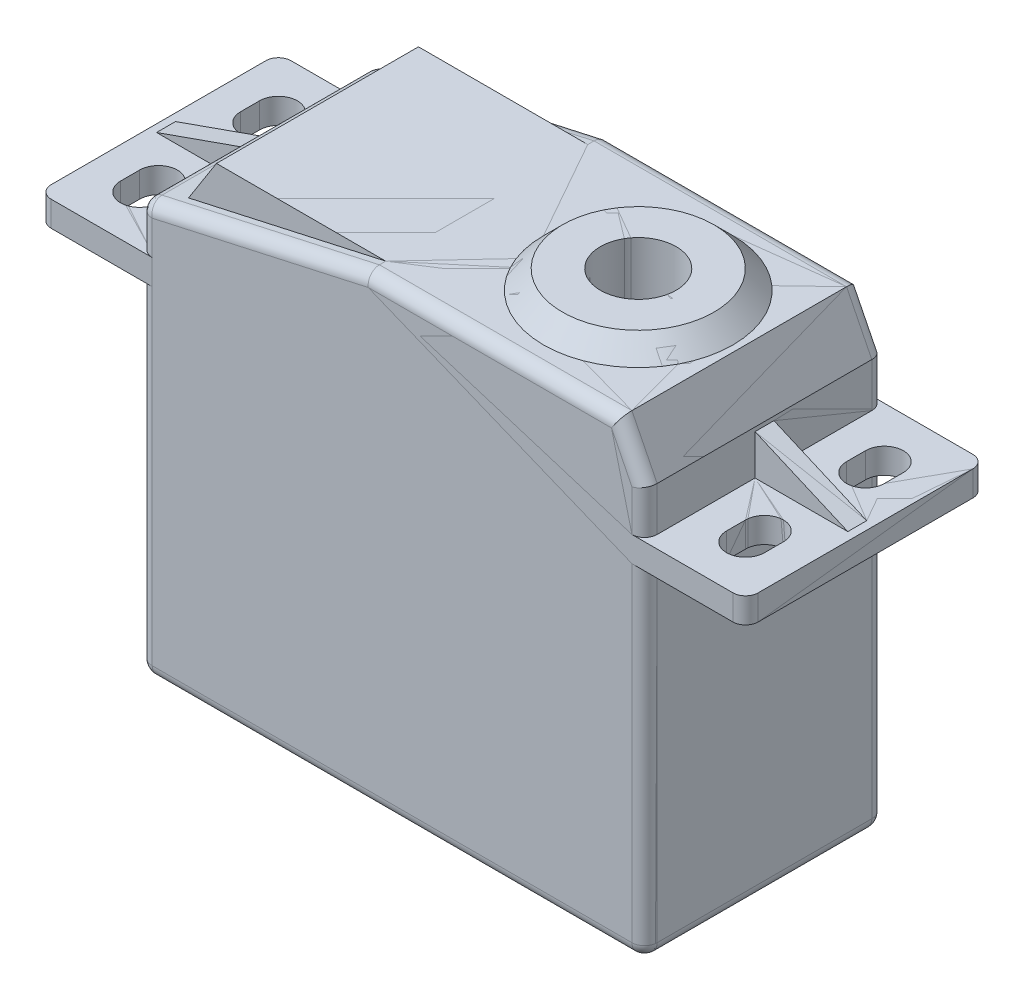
ISO-10303-21;
HEADER;
FILE_DESCRIPTION(('STEP AP214'),'2;1');
FILE_NAME('part.step','',(''),(''),'','','');
FILE_SCHEMA(('AUTOMOTIVE_DESIGN { 1 0 10303 214 1 1 1 1 }'));
ENDSEC;
DATA;
#1=APPLICATION_CONTEXT('core data for automotive mechanical design processes');
#2=APPLICATION_PROTOCOL_DEFINITION('international standard','automotive_design',2000,#1);
#3=PRODUCT_CONTEXT('',#1,'mechanical');
#4=PRODUCT('Part','Part','',(#3));
#5=PRODUCT_RELATED_PRODUCT_CATEGORY('part','',(#4));
#6=PRODUCT_DEFINITION_FORMATION('','',#4);
#7=PRODUCT_DEFINITION_CONTEXT('part definition',#1,'design');
#8=PRODUCT_DEFINITION('design','',#6,#7);
#9=PRODUCT_DEFINITION_SHAPE('','',#8);
#10=(LENGTH_UNIT() NAMED_UNIT(*) SI_UNIT(.MILLI.,.METRE.));
#11=(NAMED_UNIT(*) PLANE_ANGLE_UNIT() SI_UNIT($,.RADIAN.));
#12=(NAMED_UNIT(*) SI_UNIT($,.STERADIAN.) SOLID_ANGLE_UNIT());
#13=UNCERTAINTY_MEASURE_WITH_UNIT(LENGTH_MEASURE(1.E-05),#10,'distance_accuracy_value','');
#14=(GEOMETRIC_REPRESENTATION_CONTEXT(3) GLOBAL_UNCERTAINTY_ASSIGNED_CONTEXT((#13)) GLOBAL_UNIT_ASSIGNED_CONTEXT((#10,
#11,#12)) REPRESENTATION_CONTEXT('',''));
#15=CARTESIAN_POINT('',(0.,0.,0.));
#16=DIRECTION('',(0.,0.,1.));
#17=DIRECTION('',(1.,0.,0.));
#18=AXIS2_PLACEMENT_3D('',#15,#16,#17);
#19=CARTESIAN_POINT('',(-12.,0.5,-3.));
#20=DIRECTION('',(0.,-1.,0.));
#21=DIRECTION('',(0.,0.,1.));
#22=AXIS2_PLACEMENT_3D('',#19,#20,#21);
#23=PLANE('',#22);
#24=CARTESIAN_POINT('',(-15.,0.5,0.));
#25=DIRECTION('',(0.,1.,0.));
#26=DIRECTION('',(0.,0.,1.));
#27=AXIS2_PLACEMENT_3D('',#24,#25,#26);
#28=CIRCLE('',#27,3.);
#29=CARTESIAN_POINT('',(-15.,0.5,3.));
#30=VERTEX_POINT('',#29);
#31=EDGE_CURVE('P0_E873',#30,#30,#28,.F.);
#32=ORIENTED_EDGE('',*,*,#31,.F.);
#33=EDGE_LOOP('',(#32));
#34=FACE_BOUND('',#33,.T.);
#35=ADVANCED_FACE('P0_F350',(#34),#23,.F.);
#36=CARTESIAN_POINT('',(-15.,0.5,0.));
#37=DIRECTION('',(0.,1.,0.));
#38=DIRECTION('',(0.,0.,1.));
#39=AXIS2_PLACEMENT_3D('',#36,#37,#38);
#40=CYLINDRICAL_SURFACE('',#39,3.);
#41=ORIENTED_EDGE('',*,*,#31,.T.);
#42=EDGE_LOOP('',(#41));
#43=FACE_BOUND('',#42,.T.);
#44=CARTESIAN_POINT('',(-15.,20.5,0.));
#45=DIRECTION('',(0.,1.,0.));
#46=DIRECTION('',(0.,0.,1.));
#47=AXIS2_PLACEMENT_3D('',#44,#45,#46);
#48=CIRCLE('',#47,3.);
#49=CARTESIAN_POINT('',(-15.,20.5,3.));
#50=VERTEX_POINT('',#49);
#51=EDGE_CURVE('P0_E868',#50,#50,#48,.F.);
#52=ORIENTED_EDGE('',*,*,#51,.F.);
#53=EDGE_LOOP('',(#52));
#54=FACE_BOUND('',#53,.T.);
#55=ADVANCED_FACE('P0_F878',(#43,#54),#40,.F.);
#56=CARTESIAN_POINT('',(-7.3100293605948,20.5,7.6899706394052));
#57=DIRECTION('',(0.,1.,0.));
#58=DIRECTION('',(0.,0.,-1.));
#59=AXIS2_PLACEMENT_3D('',#56,#57,#58);
#60=PLANE('',#59);
#61=ORIENTED_EDGE('',*,*,#51,.T.);
#62=EDGE_LOOP('',(#61));
#63=FACE_BOUND('',#62,.T.);
#64=CARTESIAN_POINT('',(-15.,20.5,0.));
#65=DIRECTION('',(0.,-1.,0.));
#66=DIRECTION('',(0.,0.,-1.));
#67=AXIS2_PLACEMENT_3D('',#64,#65,#66);
#68=CIRCLE('',#67,6.00000000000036);
#69=CARTESIAN_POINT('',(-15.,20.5,-6.00000000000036));
#70=VERTEX_POINT('',#69);
#71=EDGE_CURVE('P0_E865',#70,#70,#68,.F.);
#72=ORIENTED_EDGE('',*,*,#71,.T.);
#73=EDGE_LOOP('',(#72));
#74=FACE_BOUND('',#73,.T.);
#75=ADVANCED_FACE('P0_F886',(#63,#74),#60,.T.);
#76=CARTESIAN_POINT('',(-6.,-16.5,8.5));
#77=DIRECTION('',(0.,0.,-1.));
#78=DIRECTION('',(-1.,0.,0.));
#79=AXIS2_PLACEMENT_3D('',#76,#77,#78);
#80=CYLINDRICAL_SURFACE('',#79,1.00000000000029);
#81=DIRECTION('',(0.,0.,1.));
#82=VECTOR('',#81,1.);
#83=CARTESIAN_POINT('',(-6.,-17.5,-10.5));
#84=LINE('',#83,#82);
#85=CARTESIAN_POINT('',(-6.,-17.5000000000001,-8.49999999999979));
#86=VERTEX_POINT('',#85);
#87=CARTESIAN_POINT('',(-6.00000000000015,-17.5000000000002,8.4999999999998));
#88=VERTEX_POINT('',#87);
#89=EDGE_CURVE('P0_E1277',#86,#88,#84,.T.);
#90=ORIENTED_EDGE('',*,*,#89,.F.);
#91=CARTESIAN_POINT('',(-6.,-16.5000000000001,-8.49999999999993));
#92=DIRECTION('',(-1.12757025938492E-13,0.,-1.));
#93=DIRECTION('',(-1.,0.,1.12757025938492E-13));
#94=AXIS2_PLACEMENT_3D('',#91,#92,#93);
#95=CIRCLE('',#94,0.999999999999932);
#96=CARTESIAN_POINT('',(-5.00000000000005,-16.5,-8.49999999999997));
#97=VERTEX_POINT('',#96);
#98=EDGE_CURVE('P0_E864',#97,#86,#95,.T.);
#99=ORIENTED_EDGE('',*,*,#98,.F.);
#100=DIRECTION('',(0.,0.,-1.));
#101=VECTOR('',#100,1.);
#102=CARTESIAN_POINT('',(-5.,-16.5,-4.5));
#103=LINE('',#102,#101);
#104=CARTESIAN_POINT('',(-4.99999999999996,-16.5,8.50000000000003));
#105=VERTEX_POINT('',#104);
#106=EDGE_CURVE('P0_E1274',#105,#97,#103,.T.);
#107=ORIENTED_EDGE('',*,*,#106,.F.);
#108=CARTESIAN_POINT('',(-6.,-16.5,8.5));
#109=DIRECTION('',(0.,0.,1.));
#110=DIRECTION('',(-0.707106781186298,0.707106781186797,0.));
#111=AXIS2_PLACEMENT_3D('',#108,#109,#110);
#112=CIRCLE('',#111,1.00000000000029);
#113=EDGE_CURVE('P0_E1287',#88,#105,#112,.T.);
#114=ORIENTED_EDGE('',*,*,#113,.F.);
#115=EDGE_LOOP('',(#90,#99,#107,#114));
#116=FACE_BOUND('',#115,.T.);
#117=ADVANCED_FACE('P0_F1273',(#116),#80,.T.);
#118=CARTESIAN_POINT('',(-15.,19.,0.));
#119=DIRECTION('',(0.,-1.,0.));
#120=DIRECTION('',(0.,0.,-1.));
#121=AXIS2_PLACEMENT_3D('',#118,#119,#120);
#122=CONICAL_SURFACE('',#121,7.49999999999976,0.785398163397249);
#123=CARTESIAN_POINT('',(-15.,19.,0.));
#124=DIRECTION('',(0.,-1.,0.));
#125=DIRECTION('',(0.,0.,-1.));
#126=AXIS2_PLACEMENT_3D('',#123,#124,#125);
#127=CIRCLE('',#126,7.49999999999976);
#128=CARTESIAN_POINT('',(-15.,19.,-7.49999999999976));
#129=VERTEX_POINT('',#128);
#130=EDGE_CURVE('P0_E852',#129,#129,#127,.T.);
#131=ORIENTED_EDGE('',*,*,#130,.F.);
#132=EDGE_LOOP('',(#131));
#133=FACE_BOUND('',#132,.T.);
#134=ORIENTED_EDGE('',*,*,#71,.F.);
#135=EDGE_LOOP('',(#134));
#136=FACE_BOUND('',#135,.T.);
#137=ADVANCED_FACE('P0_F1958',(#133,#136),#122,.T.);
#138=CARTESIAN_POINT('',(-42.618992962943,15.529112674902,8.));
#139=DIRECTION('',(0.,0.,1.));
#140=DIRECTION('',(1.,0.,0.));
#141=AXIS2_PLACEMENT_3D('',#138,#139,#140);
#142=PLANE('',#141);
#143=DIRECTION('',(1.,0.,0.));
#144=VECTOR('',#143,1.);
#145=CARTESIAN_POINT('',(-22.8988915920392,19.,8.00000000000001));
#146=LINE('',#145,#144);
#147=CARTESIAN_POINT('',(-40.410246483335,19.,8.));
#148=VERTEX_POINT('',#147);
#149=CARTESIAN_POINT('',(-27.,19.,8.));
#150=VERTEX_POINT('',#149);
#151=EDGE_CURVE('P0_E856',#148,#150,#146,.T.);
#152=ORIENTED_EDGE('',*,*,#151,.F.);
#153=DIRECTION('',(0.53687549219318,0.843661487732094,0.));
#154=VECTOR('',#153,1.);
#155=CARTESIAN_POINT('',(-44.7052504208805,12.2507080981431,8.));
#156=LINE('',#155,#154);
#157=CARTESIAN_POINT('',(-42.6189929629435,15.5291126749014,7.99999999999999));
#158=VERTEX_POINT('',#157);
#159=EDGE_CURVE('P0_E651',#158,#148,#156,.T.);
#160=ORIENTED_EDGE('',*,*,#159,.F.);
#161=DIRECTION('',(-0.976187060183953,-0.216930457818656,0.));
#162=VECTOR('',#161,1.);
#163=CARTESIAN_POINT('',(-35.6084652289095,17.087007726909,7.99999999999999));
#164=LINE('',#163,#162);
#165=EDGE_CURVE('P0_E1536',#150,#158,#164,.T.);
#166=ORIENTED_EDGE('',*,*,#165,.F.);
#167=EDGE_LOOP('',(#152,#160,#166));
#168=FACE_BOUND('',#167,.T.);
#169=ADVANCED_FACE('P0_F1951',(#168),#142,.T.);
#170=CARTESIAN_POINT('',(-40.410246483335,19.,8.));
#171=DIRECTION('',(-0.843661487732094,0.53687549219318,0.));
#172=DIRECTION('',(0.,0.,-1.));
#173=AXIS2_PLACEMENT_3D('',#170,#171,#172);
#174=PLANE('',#173);
#175=DIRECTION('',(0.53687549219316,0.843661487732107,0.));
#176=VECTOR('',#175,1.);
#177=CARTESIAN_POINT('',(-42.618992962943,15.529112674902,-8.));
#178=LINE('',#177,#176);
#179=CARTESIAN_POINT('',(-42.6189929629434,15.5291126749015,-8.00000000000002));
#180=VERTEX_POINT('',#179);
#181=CARTESIAN_POINT('',(-40.4102464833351,19.,-7.99999999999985));
#182=VERTEX_POINT('',#181);
#183=EDGE_CURVE('P0_E639',#180,#182,#178,.T.);
#184=ORIENTED_EDGE('',*,*,#183,.F.);
#185=DIRECTION('',(0.,0.,-1.));
#186=VECTOR('',#185,1.);
#187=CARTESIAN_POINT('',(-42.6189929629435,15.5291126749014,-0.31845865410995));
#188=LINE('',#187,#186);
#189=EDGE_CURVE('P0_E2086',#158,#180,#188,.T.);
#190=ORIENTED_EDGE('',*,*,#189,.F.);
#191=ORIENTED_EDGE('',*,*,#159,.T.);
#192=DIRECTION('',(0.,0.,1.));
#193=VECTOR('',#192,1.);
#194=CARTESIAN_POINT('',(-40.410246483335,19.,-7.64889159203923));
#195=LINE('',#194,#193);
#196=EDGE_CURVE('P0_E2012',#182,#148,#195,.T.);
#197=ORIENTED_EDGE('',*,*,#196,.F.);
#198=EDGE_LOOP('',(#184,#190,#191,#197));
#199=FACE_BOUND('',#198,.T.);
#200=ADVANCED_FACE('P0_F1943',(#199),#174,.T.);
#201=CARTESIAN_POINT('',(-27.,15.529112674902,-8.));
#202=DIRECTION('',(0.,0.,-1.));
#203=DIRECTION('',(-1.,0.,0.));
#204=AXIS2_PLACEMENT_3D('',#201,#202,#203);
#205=PLANE('',#204);
#206=DIRECTION('',(-1.,0.,0.));
#207=VECTOR('',#206,1.);
#208=CARTESIAN_POINT('',(-22.8988915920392,19.,-7.9999999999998));
#209=LINE('',#208,#207);
#210=CARTESIAN_POINT('',(-27.,19.,-7.99999999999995));
#211=VERTEX_POINT('',#210);
#212=EDGE_CURVE('P0_E2014',#211,#182,#209,.T.);
#213=ORIENTED_EDGE('',*,*,#212,.F.);
#214=DIRECTION('',(0.976187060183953,0.216930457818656,0.));
#215=VECTOR('',#214,1.);
#216=CARTESIAN_POINT('',(-35.6084652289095,17.087007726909,-8.00000000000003));
#217=LINE('',#216,#215);
#218=EDGE_CURVE('P0_E2094',#180,#211,#217,.T.);
#219=ORIENTED_EDGE('',*,*,#218,.F.);
#220=ORIENTED_EDGE('',*,*,#183,.T.);
#221=EDGE_LOOP('',(#213,#219,#220));
#222=FACE_BOUND('',#221,.T.);
#223=ADVANCED_FACE('P0_F1936',(#222),#205,.T.);
#224=CARTESIAN_POINT('',(-6.,-17.5,-8.5));
#225=CARTESIAN_POINT('',(-6.7071067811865,-17.5,-7.7928932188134));
#226=CARTESIAN_POINT('',(-6.7071067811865,-16.5,-7.7928932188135));
#227=CARTESIAN_POINT('',(-6.7071067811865,-15.5,-7.7928932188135));
#228=CARTESIAN_POINT('',(-6.,-15.5,-8.5));
#229=(BOUNDED_CURVE() B_SPLINE_CURVE(2,(#224,#225,#226,#227,#228),.UNSPECIFIED.,.F.,
.F.) B_SPLINE_CURVE_WITH_KNOTS((3,2,3),(0.,0.5,1.),
.UNSPECIFIED.) CURVE() GEOMETRIC_REPRESENTATION_ITEM() RATIONAL_B_SPLINE_CURVE((1.,
0.70710678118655,1.,0.70710678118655,1.)) REPRESENTATION_ITEM(''));
#230=CARTESIAN_POINT('',(-6.,-16.5,-8.5));
#231=DIRECTION('',(0.,-1.,0.));
#232=AXIS1_PLACEMENT('',#230,#231);
#233=SURFACE_OF_REVOLUTION('',#229,#232);
#234=CARTESIAN_POINT('',(-6.,-16.5,-8.5));
#235=DIRECTION('',(0.,1.,0.));
#236=DIRECTION('',(-0.707106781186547,0.,0.707106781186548));
#237=AXIS2_PLACEMENT_3D('',#234,#235,#236);
#238=CIRCLE('',#237,0.999999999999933);
#239=CARTESIAN_POINT('',(-6.00000000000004,-16.5,-9.50000000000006));
#240=VERTEX_POINT('',#239);
#241=EDGE_CURVE('P0_E1072',#240,#97,#238,.F.);
#242=ORIENTED_EDGE('',*,*,#241,.T.);
#243=ORIENTED_EDGE('',*,*,#98,.T.);
#244=CARTESIAN_POINT('',(-6.,-16.5,-8.5));
#245=DIRECTION('',(1.,0.,0.));
#246=DIRECTION('',(0.,0.707106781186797,0.707106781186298));
#247=AXIS2_PLACEMENT_3D('',#244,#245,#246);
#248=CIRCLE('',#247,1.00000000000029);
#249=EDGE_CURVE('P0_E1054',#86,#240,#248,.T.);
#250=ORIENTED_EDGE('',*,*,#249,.T.);
#251=EDGE_LOOP('',(#242,#243,#250));
#252=FACE_BOUND('',#251,.T.);
#253=ADVANCED_FACE('P0_F1290',(#252),#233,.F.);
#254=CARTESIAN_POINT('',(-44.,-17.5,8.5));
#255=DIRECTION('',(0.,-1.,0.));
#256=DIRECTION('',(0.,0.,-1.));
#257=AXIS2_PLACEMENT_3D('',#254,#255,#256);
#258=PLANE('',#257);
#259=DIRECTION('',(1.,0.,0.));
#260=VECTOR('',#259,1.);
#261=CARTESIAN_POINT('',(-25.,-17.5000000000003,-8.4999999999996));
#262=LINE('',#261,#260);
#263=CARTESIAN_POINT('',(-44.,-17.5000000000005,-8.49999999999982));
#264=VERTEX_POINT('',#263);
#265=EDGE_CURVE('P0_E1064',#264,#86,#262,.T.);
#266=ORIENTED_EDGE('',*,*,#265,.T.);
#267=ORIENTED_EDGE('',*,*,#89,.T.);
#268=DIRECTION('',(-1.,0.,0.));
#269=VECTOR('',#268,1.);
#270=CARTESIAN_POINT('',(-25.,-17.5000000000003,8.49999999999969));
#271=LINE('',#270,#269);
#272=CARTESIAN_POINT('',(-44.,-17.5000000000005,8.49999999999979));
#273=VERTEX_POINT('',#272);
#274=EDGE_CURVE('P0_E1020',#88,#273,#271,.T.);
#275=ORIENTED_EDGE('',*,*,#274,.T.);
#276=DIRECTION('',(0.,0.,-1.));
#277=VECTOR('',#276,1.);
#278=CARTESIAN_POINT('',(-43.9999999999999,-17.5000000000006,0.));
#279=LINE('',#278,#277);
#280=EDGE_CURVE('P0_E1044',#273,#264,#279,.T.);
#281=ORIENTED_EDGE('',*,*,#280,.T.);
#282=EDGE_LOOP('',(#266,#267,#275,#281));
#283=FACE_BOUND('',#282,.T.);
#284=ADVANCED_FACE('P0_F1921',(#283),#258,.T.);
#285=CARTESIAN_POINT('',(-6.,-16.5,9.5));
#286=CARTESIAN_POINT('',(-6.7071067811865,-15.792893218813,9.5));
#287=CARTESIAN_POINT('',(-6.7071067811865,-15.792893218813,8.5));
#288=CARTESIAN_POINT('',(-6.7071067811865,-15.792893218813,7.5));
#289=CARTESIAN_POINT('',(-6.,-16.5,7.5));
#290=(BOUNDED_CURVE() B_SPLINE_CURVE(2,(#285,#286,#287,#288,#289),.UNSPECIFIED.,.F.,
.F.) B_SPLINE_CURVE_WITH_KNOTS((3,2,3),(0.,0.5,1.),
.UNSPECIFIED.) CURVE() GEOMETRIC_REPRESENTATION_ITEM() RATIONAL_B_SPLINE_CURVE((1.,
0.70710678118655,1.,0.70710678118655,1.)) REPRESENTATION_ITEM(''));
#291=CARTESIAN_POINT('',(-6.,-16.5,8.5));
#292=DIRECTION('',(0.,0.,1.));
#293=AXIS1_PLACEMENT('',#291,#292);
#294=SURFACE_OF_REVOLUTION('',#290,#293);
#295=ORIENTED_EDGE('',*,*,#113,.T.);
#296=CARTESIAN_POINT('',(-6.,-16.5,8.5));
#297=DIRECTION('',(0.,1.,0.));
#298=DIRECTION('',(-0.707106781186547,0.,-0.707106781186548));
#299=AXIS2_PLACEMENT_3D('',#296,#297,#298);
#300=CIRCLE('',#299,0.999999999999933);
#301=CARTESIAN_POINT('',(-6.00000000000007,-16.5000000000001,9.50000000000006));
#302=VERTEX_POINT('',#301);
#303=EDGE_CURVE('P0_E840',#105,#302,#300,.F.);
#304=ORIENTED_EDGE('',*,*,#303,.T.);
#305=CARTESIAN_POINT('',(-6.,-16.5,8.5));
#306=DIRECTION('',(1.,0.,0.));
#307=DIRECTION('',(0.,0.707106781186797,-0.707106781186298));
#308=AXIS2_PLACEMENT_3D('',#305,#306,#307);
#309=CIRCLE('',#308,1.00000000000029);
#310=EDGE_CURVE('P0_E1017',#302,#88,#309,.T.);
#311=ORIENTED_EDGE('',*,*,#310,.T.);
#312=EDGE_LOOP('',(#295,#304,#311));
#313=FACE_BOUND('',#312,.T.);
#314=ADVANCED_FACE('P0_F1914',(#313),#294,.F.);
#315=CARTESIAN_POINT('',(-5.,-16.5,8.5));
#316=DIRECTION('',(1.,0.,0.));
#317=DIRECTION('',(0.,0.,-1.));
#318=AXIS2_PLACEMENT_3D('',#315,#316,#317);
#319=PLANE('',#318);
#320=ORIENTED_EDGE('',*,*,#106,.T.);
#321=DIRECTION('',(0.,1.,0.));
#322=VECTOR('',#321,1.);
#323=CARTESIAN_POINT('',(-5.00000000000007,-3.5,-8.49999999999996));
#324=LINE('',#323,#322);
#325=CARTESIAN_POINT('',(-5.00000000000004,9.5,-8.49999999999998));
#326=VERTEX_POINT('',#325);
#327=EDGE_CURVE('P0_E1075',#97,#326,#324,.T.);
#328=ORIENTED_EDGE('',*,*,#327,.T.);
#329=DIRECTION('',(0.,0.,-1.));
#330=VECTOR('',#329,1.);
#331=CARTESIAN_POINT('',(-5.00000000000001,9.5,0.));
#332=LINE('',#331,#330);
#333=CARTESIAN_POINT('',(-5.00000000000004,9.5,8.50000000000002));
#334=VERTEX_POINT('',#333);
#335=EDGE_CURVE('P0_E836',#334,#326,#332,.T.);
#336=ORIENTED_EDGE('',*,*,#335,.F.);
#337=DIRECTION('',(0.,-1.,0.));
#338=VECTOR('',#337,1.);
#339=CARTESIAN_POINT('',(-5.00000000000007,-3.5,8.50000000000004));
#340=LINE('',#339,#338);
#341=EDGE_CURVE('P0_E1010',#334,#105,#340,.T.);
#342=ORIENTED_EDGE('',*,*,#341,.T.);
#343=EDGE_LOOP('',(#320,#328,#336,#342));
#344=FACE_BOUND('',#343,.T.);
#345=ADVANCED_FACE('P0_F1282',(#344),#319,.T.);
#346=CARTESIAN_POINT('',(3.,9.5,8.5));
#347=DIRECTION('',(1.,0.,0.));
#348=DIRECTION('',(0.,0.,-1.));
#349=AXIS2_PLACEMENT_3D('',#346,#347,#348);
#350=PLANE('',#349);
#351=DIRECTION('',(0.,0.,-1.));
#352=VECTOR('',#351,1.);
#353=CARTESIAN_POINT('',(3.,11.5,0.));
#354=LINE('',#353,#352);
#355=CARTESIAN_POINT('',(2.99999999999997,11.5,8.50000000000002));
#356=VERTEX_POINT('',#355);
#357=CARTESIAN_POINT('',(2.99999999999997,11.5,-8.49999999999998));
#358=VERTEX_POINT('',#357);
#359=EDGE_CURVE('P0_E807',#356,#358,#354,.T.);
#360=ORIENTED_EDGE('',*,*,#359,.F.);
#361=DIRECTION('',(0.,-1.,0.));
#362=VECTOR('',#361,1.);
#363=CARTESIAN_POINT('',(2.99999999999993,10.5,8.50000000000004));
#364=LINE('',#363,#362);
#365=CARTESIAN_POINT('',(3.00000000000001,9.5,8.50000000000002));
#366=VERTEX_POINT('',#365);
#367=EDGE_CURVE('P0_E813',#356,#366,#364,.T.);
#368=ORIENTED_EDGE('',*,*,#367,.T.);
#369=DIRECTION('',(0.,0.,1.));
#370=VECTOR('',#369,1.);
#371=CARTESIAN_POINT('',(3.00000000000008,9.5,0.));
#372=LINE('',#371,#370);
#373=CARTESIAN_POINT('',(3.00000000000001,9.5,-8.49999999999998));
#374=VERTEX_POINT('',#373);
#375=EDGE_CURVE('P0_E830',#374,#366,#372,.T.);
#376=ORIENTED_EDGE('',*,*,#375,.F.);
#377=DIRECTION('',(0.,1.,0.));
#378=VECTOR('',#377,1.);
#379=CARTESIAN_POINT('',(2.99999999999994,10.5,-8.49999999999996));
#380=LINE('',#379,#378);
#381=EDGE_CURVE('P0_E843',#374,#358,#380,.T.);
#382=ORIENTED_EDGE('',*,*,#381,.T.);
#383=EDGE_LOOP('',(#360,#368,#376,#382));
#384=FACE_BOUND('',#383,.T.);
#385=ADVANCED_FACE('P0_F1899',(#384),#350,.T.);
#386=CARTESIAN_POINT('',(2.3497585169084,11.5,-0.75));
#387=DIRECTION('',(0.,0.,-1.));
#388=DIRECTION('',(-1.,0.,0.));
#389=AXIS2_PLACEMENT_3D('',#386,#387,#388);
#390=PLANE('',#389);
#391=DIRECTION('',(1.,0.,0.));
#392=VECTOR('',#391,1.);
#393=CARTESIAN_POINT('',(-6.5,11.5,-0.75000000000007));
#394=LINE('',#393,#392);
#395=CARTESIAN_POINT('',(-5.00000000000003,11.5,-0.750000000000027));
#396=VERTEX_POINT('',#395);
#397=CARTESIAN_POINT('',(2.34975851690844,11.5,-0.75000000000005));
#398=VERTEX_POINT('',#397);
#399=EDGE_CURVE('P0_E1469',#396,#398,#394,.T.);
#400=ORIENTED_EDGE('',*,*,#399,.F.);
#401=DIRECTION('',(0.,-1.,0.));
#402=VECTOR('',#401,1.);
#403=CARTESIAN_POINT('',(-5.,20.,-0.74999999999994));
#404=LINE('',#403,#402);
#405=CARTESIAN_POINT('',(-5.,14.682369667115,-0.749999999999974));
#406=VERTEX_POINT('',#405);
#407=EDGE_CURVE('P0_E1439',#406,#396,#404,.T.);
#408=ORIENTED_EDGE('',*,*,#407,.F.);
#409=DIRECTION('',(-0.917670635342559,0.397341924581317,0.));
#410=VECTOR('',#409,1.);
#411=CARTESIAN_POINT('',(-1.3251207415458,13.0911848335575,-0.750000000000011));
#412=LINE('',#411,#410);
#413=EDGE_CURVE('P0_E862',#398,#406,#412,.T.);
#414=ORIENTED_EDGE('',*,*,#413,.F.);
#415=EDGE_LOOP('',(#400,#408,#414));
#416=FACE_BOUND('',#415,.T.);
#417=ADVANCED_FACE('P0_F1891',(#416),#390,.T.);
#418=CARTESIAN_POINT('',(2.3497585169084,11.5,0.75));
#419=DIRECTION('',(0.397341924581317,0.917670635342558,0.));
#420=DIRECTION('',(0.,0.,-1.));
#421=AXIS2_PLACEMENT_3D('',#418,#419,#420);
#422=PLANE('',#421);
#423=ORIENTED_EDGE('',*,*,#413,.T.);
#424=DIRECTION('',(0.,0.,-1.));
#425=VECTOR('',#424,1.);
#426=CARTESIAN_POINT('',(-5.,14.6823696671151,0.));
#427=LINE('',#426,#425);
#428=CARTESIAN_POINT('',(-5.,14.6823696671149,0.749999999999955));
#429=VERTEX_POINT('',#428);
#430=EDGE_CURVE('P0_E1458',#429,#406,#427,.T.);
#431=ORIENTED_EDGE('',*,*,#430,.F.);
#432=DIRECTION('',(-0.917670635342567,0.397341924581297,0.));
#433=VECTOR('',#432,1.);
#434=CARTESIAN_POINT('',(2.3497585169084,11.5,0.75));
#435=LINE('',#434,#433);
#436=CARTESIAN_POINT('',(2.34975851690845,11.5,0.750000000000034));
#437=VERTEX_POINT('',#436);
#438=EDGE_CURVE('P0_E859',#437,#429,#435,.T.);
#439=ORIENTED_EDGE('',*,*,#438,.F.);
#440=DIRECTION('',(0.,0.,1.));
#441=VECTOR('',#440,1.);
#442=CARTESIAN_POINT('',(2.34975851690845,11.5,0.));
#443=LINE('',#442,#441);
#444=EDGE_CURVE('P0_E1464',#398,#437,#443,.T.);
#445=ORIENTED_EDGE('',*,*,#444,.F.);
#446=EDGE_LOOP('',(#423,#431,#439,#445));
#447=FACE_BOUND('',#446,.T.);
#448=ADVANCED_FACE('P0_F1883',(#447),#422,.T.);
#449=CARTESIAN_POINT('',(-5.,11.5,0.75));
#450=DIRECTION('',(0.,0.,1.));
#451=DIRECTION('',(1.,0.,0.));
#452=AXIS2_PLACEMENT_3D('',#449,#450,#451);
#453=PLANE('',#452);
#454=DIRECTION('',(0.,1.,0.));
#455=VECTOR('',#454,1.);
#456=CARTESIAN_POINT('',(-5.,20.,0.74999999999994));
#457=LINE('',#456,#455);
#458=CARTESIAN_POINT('',(-5.00000000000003,11.5,0.750000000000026));
#459=VERTEX_POINT('',#458);
#460=EDGE_CURVE('P0_E1442',#459,#429,#457,.T.);
#461=ORIENTED_EDGE('',*,*,#460,.F.);
#462=DIRECTION('',(-1.,0.,0.));
#463=VECTOR('',#462,1.);
#464=CARTESIAN_POINT('',(-6.5,11.5,0.750000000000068));
#465=LINE('',#464,#463);
#466=EDGE_CURVE('P0_E1461',#437,#459,#465,.T.);
#467=ORIENTED_EDGE('',*,*,#466,.F.);
#468=ORIENTED_EDGE('',*,*,#438,.T.);
#469=EDGE_LOOP('',(#461,#467,#468));
#470=FACE_BOUND('',#469,.T.);
#471=ADVANCED_FACE('P0_F1875',(#470),#453,.T.);
#472=CARTESIAN_POINT('',(-1.,9.5,-4.));
#473=DIRECTION('',(0.,1.,0.));
#474=DIRECTION('',(0.,0.,1.));
#475=AXIS2_PLACEMENT_3D('',#472,#473,#474);
#476=CYLINDRICAL_SURFACE('',#475,1.5);
#477=CARTESIAN_POINT('',(-1.,9.5,-4.));
#478=DIRECTION('',(0.,1.,0.));
#479=DIRECTION('',(0.,0.,1.));
#480=AXIS2_PLACEMENT_3D('',#477,#478,#479);
#481=CIRCLE('',#480,1.5);
#482=CARTESIAN_POINT('',(-2.49999999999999,9.5,-4.));
#483=VERTEX_POINT('',#482);
#484=CARTESIAN_POINT('',(0.499999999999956,9.5,-4.));
#485=VERTEX_POINT('',#484);
#486=EDGE_CURVE('P0_E827',#483,#485,#481,.T.);
#487=ORIENTED_EDGE('',*,*,#486,.F.);
#488=DIRECTION('',(0.,1.,0.));
#489=VECTOR('',#488,1.);
#490=CARTESIAN_POINT('',(-2.5,10.5,-4.));
#491=LINE('',#490,#489);
#492=CARTESIAN_POINT('',(-2.50000000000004,11.5,-4.));
#493=VERTEX_POINT('',#492);
#494=EDGE_CURVE('P0_E861',#483,#493,#491,.T.);
#495=ORIENTED_EDGE('',*,*,#494,.T.);
#496=CARTESIAN_POINT('',(-1.,11.5,-4.));
#497=DIRECTION('',(0.,1.,0.));
#498=DIRECTION('',(0.,0.,1.));
#499=AXIS2_PLACEMENT_3D('',#496,#497,#498);
#500=CIRCLE('',#499,1.5);
#501=CARTESIAN_POINT('',(0.50000000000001,11.5,-4.));
#502=VERTEX_POINT('',#501);
#503=EDGE_CURVE('P0_E797',#502,#493,#500,.F.);
#504=ORIENTED_EDGE('',*,*,#503,.F.);
#505=DIRECTION('',(0.,-1.,0.));
#506=VECTOR('',#505,1.);
#507=CARTESIAN_POINT('',(0.5,10.5,-4.));
#508=LINE('',#507,#506);
#509=EDGE_CURVE('P0_E1451',#502,#485,#508,.T.);
#510=ORIENTED_EDGE('',*,*,#509,.T.);
#511=EDGE_LOOP('',(#487,#495,#504,#510));
#512=FACE_BOUND('',#511,.T.);
#513=ADVANCED_FACE('P0_F1867',(#512),#476,.F.);
#514=CARTESIAN_POINT('',(-2.5,11.5,-5.5));
#515=DIRECTION('',(-1.,0.,0.));
#516=DIRECTION('',(0.,-1.,0.));
#517=AXIS2_PLACEMENT_3D('',#514,#515,#516);
#518=PLANE('',#517);
#519=ORIENTED_EDGE('',*,*,#494,.F.);
#520=DIRECTION('',(0.,0.,1.));
#521=VECTOR('',#520,1.);
#522=CARTESIAN_POINT('',(-2.49999999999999,9.5,0.));
#523=LINE('',#522,#521);
#524=CARTESIAN_POINT('',(-2.49999999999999,9.5,-5.49999999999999));
#525=VERTEX_POINT('',#524);
#526=EDGE_CURVE('P0_E822',#525,#483,#523,.T.);
#527=ORIENTED_EDGE('',*,*,#526,.F.);
#528=DIRECTION('',(0.,-1.,0.));
#529=VECTOR('',#528,1.);
#530=CARTESIAN_POINT('',(-2.5,10.5,-5.49999999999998));
#531=LINE('',#530,#529);
#532=CARTESIAN_POINT('',(-2.50000000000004,11.5,-5.49999999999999));
#533=VERTEX_POINT('',#532);
#534=EDGE_CURVE('P0_E1453',#533,#525,#531,.T.);
#535=ORIENTED_EDGE('',*,*,#534,.F.);
#536=DIRECTION('',(0.,0.,-1.));
#537=VECTOR('',#536,1.);
#538=CARTESIAN_POINT('',(-2.50000000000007,11.5,0.));
#539=LINE('',#538,#537);
#540=EDGE_CURVE('P0_E796',#493,#533,#539,.T.);
#541=ORIENTED_EDGE('',*,*,#540,.F.);
#542=EDGE_LOOP('',(#519,#527,#535,#541));
#543=FACE_BOUND('',#542,.T.);
#544=ADVANCED_FACE('P0_F1859',(#543),#518,.F.);
#545=CARTESIAN_POINT('',(-1.,9.5,-5.5));
#546=DIRECTION('',(0.,1.,0.));
#547=DIRECTION('',(0.,0.,1.));
#548=AXIS2_PLACEMENT_3D('',#545,#546,#547);
#549=CYLINDRICAL_SURFACE('',#548,1.5);
#550=CARTESIAN_POINT('',(-1.,9.5,-5.5));
#551=DIRECTION('',(0.,1.,0.));
#552=DIRECTION('',(0.,0.,1.));
#553=AXIS2_PLACEMENT_3D('',#550,#551,#552);
#554=CIRCLE('',#553,1.5);
#555=CARTESIAN_POINT('',(0.499999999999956,9.5,-5.5));
#556=VERTEX_POINT('',#555);
#557=EDGE_CURVE('P0_E823',#556,#525,#554,.T.);
#558=ORIENTED_EDGE('',*,*,#557,.F.);
#559=DIRECTION('',(0.,1.,0.));
#560=VECTOR('',#559,1.);
#561=CARTESIAN_POINT('',(0.5,10.5,-5.5));
#562=LINE('',#561,#560);
#563=CARTESIAN_POINT('',(0.50000000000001,11.5,-5.5));
#564=VERTEX_POINT('',#563);
#565=EDGE_CURVE('P0_E1449',#556,#564,#562,.T.);
#566=ORIENTED_EDGE('',*,*,#565,.T.);
#567=CARTESIAN_POINT('',(-1.,11.5,-5.5));
#568=DIRECTION('',(0.,1.,0.));
#569=DIRECTION('',(0.,0.,1.));
#570=AXIS2_PLACEMENT_3D('',#567,#568,#569);
#571=CIRCLE('',#570,1.5);
#572=EDGE_CURVE('P0_E793',#533,#564,#571,.F.);
#573=ORIENTED_EDGE('',*,*,#572,.F.);
#574=ORIENTED_EDGE('',*,*,#534,.T.);
#575=EDGE_LOOP('',(#558,#566,#573,#574));
#576=FACE_BOUND('',#575,.T.);
#577=ADVANCED_FACE('P0_F1851',(#576),#549,.F.);
#578=CARTESIAN_POINT('',(0.5,11.5,-4.));
#579=DIRECTION('',(1.,0.,0.));
#580=DIRECTION('',(0.,-1.,0.));
#581=AXIS2_PLACEMENT_3D('',#578,#579,#580);
#582=PLANE('',#581);
#583=ORIENTED_EDGE('',*,*,#565,.F.);
#584=DIRECTION('',(0.,0.,-1.));
#585=VECTOR('',#584,1.);
#586=CARTESIAN_POINT('',(0.499999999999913,9.5,0.));
#587=LINE('',#586,#585);
#588=EDGE_CURVE('P0_E826',#485,#556,#587,.T.);
#589=ORIENTED_EDGE('',*,*,#588,.F.);
#590=ORIENTED_EDGE('',*,*,#509,.F.);
#591=DIRECTION('',(0.,0.,1.));
#592=VECTOR('',#591,1.);
#593=CARTESIAN_POINT('',(0.50000000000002,11.5,0.));
#594=LINE('',#593,#592);
#595=EDGE_CURVE('P0_E792',#564,#502,#594,.T.);
#596=ORIENTED_EDGE('',*,*,#595,.F.);
#597=EDGE_LOOP('',(#583,#589,#590,#596));
#598=FACE_BOUND('',#597,.T.);
#599=ADVANCED_FACE('P0_F1843',(#598),#582,.F.);
#600=CARTESIAN_POINT('',(-1.,9.5,5.5));
#601=DIRECTION('',(0.,1.,0.));
#602=DIRECTION('',(0.,0.,1.));
#603=AXIS2_PLACEMENT_3D('',#600,#601,#602);
#604=CYLINDRICAL_SURFACE('',#603,1.5);
#605=CARTESIAN_POINT('',(-1.,9.5,5.5));
#606=DIRECTION('',(0.,1.,0.));
#607=DIRECTION('',(0.,0.,1.));
#608=AXIS2_PLACEMENT_3D('',#605,#606,#607);
#609=CIRCLE('',#608,1.5);
#610=CARTESIAN_POINT('',(-2.49999999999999,9.5,5.5));
#611=VERTEX_POINT('',#610);
#612=CARTESIAN_POINT('',(0.499999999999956,9.5,5.5));
#613=VERTEX_POINT('',#612);
#614=EDGE_CURVE('P0_E819',#611,#613,#609,.T.);
#615=ORIENTED_EDGE('',*,*,#614,.F.);
#616=DIRECTION('',(0.,1.,0.));
#617=VECTOR('',#616,1.);
#618=CARTESIAN_POINT('',(-2.5,10.5,5.5));
#619=LINE('',#618,#617);
#620=CARTESIAN_POINT('',(-2.50000000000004,11.5,5.5));
#621=VERTEX_POINT('',#620);
#622=EDGE_CURVE('P0_E1447',#611,#621,#619,.T.);
#623=ORIENTED_EDGE('',*,*,#622,.T.);
#624=CARTESIAN_POINT('',(-1.,11.5,5.5));
#625=DIRECTION('',(0.,1.,0.));
#626=DIRECTION('',(0.,0.,1.));
#627=AXIS2_PLACEMENT_3D('',#624,#625,#626);
#628=CIRCLE('',#627,1.5);
#629=CARTESIAN_POINT('',(0.50000000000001,11.5,5.5));
#630=VERTEX_POINT('',#629);
#631=EDGE_CURVE('P0_E789',#630,#621,#628,.F.);
#632=ORIENTED_EDGE('',*,*,#631,.F.);
#633=DIRECTION('',(0.,-1.,0.));
#634=VECTOR('',#633,1.);
#635=CARTESIAN_POINT('',(0.5,10.5,5.5));
#636=LINE('',#635,#634);
#637=EDGE_CURVE('P0_E1443',#630,#613,#636,.T.);
#638=ORIENTED_EDGE('',*,*,#637,.T.);
#639=EDGE_LOOP('',(#615,#623,#632,#638));
#640=FACE_BOUND('',#639,.T.);
#641=ADVANCED_FACE('P0_F1835',(#640),#604,.F.);
#642=CARTESIAN_POINT('',(-2.5,11.5,4.));
#643=DIRECTION('',(-1.,0.,0.));
#644=DIRECTION('',(0.,-1.,0.));
#645=AXIS2_PLACEMENT_3D('',#642,#643,#644);
#646=PLANE('',#645);
#647=ORIENTED_EDGE('',*,*,#622,.F.);
#648=DIRECTION('',(0.,0.,1.));
#649=VECTOR('',#648,1.);
#650=CARTESIAN_POINT('',(-2.49999999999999,9.5,0.));
#651=LINE('',#650,#649);
#652=CARTESIAN_POINT('',(-2.49999999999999,9.5,4.00000000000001));
#653=VERTEX_POINT('',#652);
#654=EDGE_CURVE('P0_E817',#653,#611,#651,.T.);
#655=ORIENTED_EDGE('',*,*,#654,.F.);
#656=DIRECTION('',(0.,-1.,0.));
#657=VECTOR('',#656,1.);
#658=CARTESIAN_POINT('',(-2.5,10.5,4.00000000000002));
#659=LINE('',#658,#657);
#660=CARTESIAN_POINT('',(-2.50000000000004,11.5,4.00000000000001));
#661=VERTEX_POINT('',#660);
#662=EDGE_CURVE('P0_E1445',#661,#653,#659,.T.);
#663=ORIENTED_EDGE('',*,*,#662,.F.);
#664=DIRECTION('',(0.,0.,-1.));
#665=VECTOR('',#664,1.);
#666=CARTESIAN_POINT('',(-2.50000000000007,11.5,0.));
#667=LINE('',#666,#665);
#668=EDGE_CURVE('P0_E788',#621,#661,#667,.T.);
#669=ORIENTED_EDGE('',*,*,#668,.F.);
#670=EDGE_LOOP('',(#647,#655,#663,#669));
#671=FACE_BOUND('',#670,.T.);
#672=ADVANCED_FACE('P0_F1827',(#671),#646,.F.);
#673=CARTESIAN_POINT('',(-1.,9.5,4.));
#674=DIRECTION('',(0.,1.,0.));
#675=DIRECTION('',(0.,0.,1.));
#676=AXIS2_PLACEMENT_3D('',#673,#674,#675);
#677=CYLINDRICAL_SURFACE('',#676,1.5);
#678=CARTESIAN_POINT('',(-1.,9.5,4.));
#679=DIRECTION('',(0.,1.,0.));
#680=DIRECTION('',(0.,0.,1.));
#681=AXIS2_PLACEMENT_3D('',#678,#679,#680);
#682=CIRCLE('',#681,1.5);
#683=CARTESIAN_POINT('',(0.499999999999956,9.5,4.));
#684=VERTEX_POINT('',#683);
#685=EDGE_CURVE('P0_E814',#684,#653,#682,.T.);
#686=ORIENTED_EDGE('',*,*,#685,.F.);
#687=DIRECTION('',(0.,1.,0.));
#688=VECTOR('',#687,1.);
#689=CARTESIAN_POINT('',(0.5,10.5,4.));
#690=LINE('',#689,#688);
#691=CARTESIAN_POINT('',(0.50000000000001,11.5,4.));
#692=VERTEX_POINT('',#691);
#693=EDGE_CURVE('P0_E1440',#684,#692,#690,.T.);
#694=ORIENTED_EDGE('',*,*,#693,.T.);
#695=CARTESIAN_POINT('',(-1.,11.5,4.));
#696=DIRECTION('',(0.,1.,0.));
#697=DIRECTION('',(0.,0.,1.));
#698=AXIS2_PLACEMENT_3D('',#695,#696,#697);
#699=CIRCLE('',#698,1.5);
#700=EDGE_CURVE('P0_E784',#661,#692,#699,.F.);
#701=ORIENTED_EDGE('',*,*,#700,.F.);
#702=ORIENTED_EDGE('',*,*,#662,.T.);
#703=EDGE_LOOP('',(#686,#694,#701,#702));
#704=FACE_BOUND('',#703,.T.);
#705=ADVANCED_FACE('P0_F1819',(#704),#677,.F.);
#706=CARTESIAN_POINT('',(0.5,11.5,5.5));
#707=DIRECTION('',(1.,0.,0.));
#708=DIRECTION('',(0.,-1.,0.));
#709=AXIS2_PLACEMENT_3D('',#706,#707,#708);
#710=PLANE('',#709);
#711=ORIENTED_EDGE('',*,*,#693,.F.);
#712=DIRECTION('',(0.,0.,-1.));
#713=VECTOR('',#712,1.);
#714=CARTESIAN_POINT('',(0.499999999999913,9.5,0.));
#715=LINE('',#714,#713);
#716=EDGE_CURVE('P0_E818',#613,#684,#715,.T.);
#717=ORIENTED_EDGE('',*,*,#716,.F.);
#718=ORIENTED_EDGE('',*,*,#637,.F.);
#719=DIRECTION('',(0.,0.,1.));
#720=VECTOR('',#719,1.);
#721=CARTESIAN_POINT('',(0.50000000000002,11.5,0.));
#722=LINE('',#721,#720);
#723=EDGE_CURVE('P0_E787',#692,#630,#722,.T.);
#724=ORIENTED_EDGE('',*,*,#723,.F.);
#725=EDGE_LOOP('',(#711,#717,#718,#724));
#726=FACE_BOUND('',#725,.T.);
#727=ADVANCED_FACE('P0_F1812',(#726),#710,.F.);
#728=CARTESIAN_POINT('',(-5.,11.5,8.5));
#729=DIRECTION('',(1.,0.,0.));
#730=DIRECTION('',(0.,0.,-1.));
#731=AXIS2_PLACEMENT_3D('',#728,#729,#730);
#732=PLANE('',#731);
#733=DIRECTION('',(0.,0.,-1.));
#734=VECTOR('',#733,1.);
#735=CARTESIAN_POINT('',(-4.99999999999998,15.,0.));
#736=LINE('',#735,#734);
#737=CARTESIAN_POINT('',(-5.00000000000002,15.0000000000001,8.4999999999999));
#738=VERTEX_POINT('',#737);
#739=CARTESIAN_POINT('',(-5.00000000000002,15.0000000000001,-8.49999999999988));
#740=VERTEX_POINT('',#739);
#741=EDGE_CURVE('P0_E1436',#738,#740,#736,.T.);
#742=ORIENTED_EDGE('',*,*,#741,.F.);
#743=DIRECTION('',(0.,-1.,0.));
#744=VECTOR('',#743,1.);
#745=CARTESIAN_POINT('',(-5.00000000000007,13.25,8.50000000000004));
#746=LINE('',#745,#744);
#747=CARTESIAN_POINT('',(-5.00000000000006,11.5,8.50000000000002));
#748=VERTEX_POINT('',#747);
#749=EDGE_CURVE('P0_E783',#738,#748,#746,.T.);
#750=ORIENTED_EDGE('',*,*,#749,.T.);
#751=DIRECTION('',(0.,0.,1.));
#752=VECTOR('',#751,1.);
#753=CARTESIAN_POINT('',(-5.00000000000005,11.5,0.));
#754=LINE('',#753,#752);
#755=EDGE_CURVE('P0_E800',#459,#748,#754,.T.);
#756=ORIENTED_EDGE('',*,*,#755,.F.);
#757=ORIENTED_EDGE('',*,*,#460,.T.);
#758=ORIENTED_EDGE('',*,*,#430,.T.);
#759=ORIENTED_EDGE('',*,*,#407,.T.);
#760=DIRECTION('',(0.,0.,1.));
#761=VECTOR('',#760,1.);
#762=CARTESIAN_POINT('',(-5.00000000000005,11.5,0.));
#763=LINE('',#762,#761);
#764=CARTESIAN_POINT('',(-5.00000000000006,11.5,-8.49999999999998));
#765=VERTEX_POINT('',#764);
#766=EDGE_CURVE('P0_E804',#765,#396,#763,.T.);
#767=ORIENTED_EDGE('',*,*,#766,.F.);
#768=DIRECTION('',(0.,1.,0.));
#769=VECTOR('',#768,1.);
#770=CARTESIAN_POINT('',(-5.00000000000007,13.25,-8.49999999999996));
#771=LINE('',#770,#769);
#772=EDGE_CURVE('P0_E844',#765,#740,#771,.T.);
#773=ORIENTED_EDGE('',*,*,#772,.T.);
#774=EDGE_LOOP('',(#742,#750,#756,#757,#758,#759,#767,#773));
#775=FACE_BOUND('',#774,.T.);
#776=ADVANCED_FACE('P0_F1485',(#775),#732,.T.);
#777=CARTESIAN_POINT('',(-7.,19.,8.5));
#778=DIRECTION('',(0.894427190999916,0.447213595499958,0.));
#779=DIRECTION('',(0.447213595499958,-0.894427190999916,0.));
#780=AXIS2_PLACEMENT_3D('',#777,#778,#779);
#781=PLANE('',#780);
#782=ORIENTED_EDGE('',*,*,#741,.T.);
#783=DIRECTION('',(-0.447213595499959,0.894427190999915,0.));
#784=VECTOR('',#783,1.);
#785=CARTESIAN_POINT('',(-5.9999999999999,16.9999999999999,-8.49999999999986));
#786=LINE('',#785,#784);
#787=CARTESIAN_POINT('',(-6.99999999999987,19.0000000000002,-8.4999999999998));
#788=VERTEX_POINT('',#787);
#789=EDGE_CURVE('P0_E847',#740,#788,#786,.T.);
#790=ORIENTED_EDGE('',*,*,#789,.T.);
#791=DIRECTION('',(0.,0.,-1.));
#792=VECTOR('',#791,1.);
#793=CARTESIAN_POINT('',(-7.,19.,-7.64889159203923));
#794=LINE('',#793,#792);
#795=CARTESIAN_POINT('',(-6.99999999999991,19.0000000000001,8.49999999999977));
#796=VERTEX_POINT('',#795);
#797=EDGE_CURVE('P0_E1434',#796,#788,#794,.T.);
#798=ORIENTED_EDGE('',*,*,#797,.F.);
#799=DIRECTION('',(0.447213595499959,-0.894427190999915,0.));
#800=VECTOR('',#799,1.);
#801=CARTESIAN_POINT('',(-5.99999999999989,16.9999999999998,8.49999999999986));
#802=LINE('',#801,#800);
#803=EDGE_CURVE('P0_E780',#796,#738,#802,.T.);
#804=ORIENTED_EDGE('',*,*,#803,.T.);
#805=EDGE_LOOP('',(#782,#790,#798,#804));
#806=FACE_BOUND('',#805,.T.);
#807=ADVANCED_FACE('P0_F1494',(#806),#781,.T.);
#808=CARTESIAN_POINT('',(-5.38753670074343,19.,9.61246329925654));
#809=DIRECTION('',(0.,1.,0.));
#810=DIRECTION('',(0.,0.,-1.));
#811=AXIS2_PLACEMENT_3D('',#808,#809,#810);
#812=PLANE('',#811);
#813=ORIENTED_EDGE('',*,*,#130,.T.);
#814=EDGE_LOOP('',(#813));
#815=FACE_BOUND('',#814,.T.);
#816=DIRECTION('',(0.,0.,-1.));
#817=VECTOR('',#816,1.);
#818=CARTESIAN_POINT('',(-27.,19.,-0.31845865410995));
#819=LINE('',#818,#817);
#820=CARTESIAN_POINT('',(-26.9999999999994,19.0000000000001,8.49999999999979));
#821=VERTEX_POINT('',#820);
#822=EDGE_CURVE('P0_E855',#821,#150,#819,.T.);
#823=ORIENTED_EDGE('',*,*,#822,.F.);
#824=DIRECTION('',(1.,0.,0.));
#825=VECTOR('',#824,1.);
#826=CARTESIAN_POINT('',(-17.,19.0000000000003,8.49999999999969));
#827=LINE('',#826,#825);
#828=EDGE_CURVE('P0_E777',#821,#796,#827,.T.);
#829=ORIENTED_EDGE('',*,*,#828,.T.);
#830=ORIENTED_EDGE('',*,*,#797,.T.);
#831=DIRECTION('',(-1.,0.,0.));
#832=VECTOR('',#831,1.);
#833=CARTESIAN_POINT('',(-17.,19.0000000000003,-8.4999999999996));
#834=LINE('',#833,#832);
#835=CARTESIAN_POINT('',(-26.9999999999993,19.0000000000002,-8.49999999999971));
#836=VERTEX_POINT('',#835);
#837=EDGE_CURVE('P0_E851',#788,#836,#834,.T.);
#838=ORIENTED_EDGE('',*,*,#837,.T.);
#839=DIRECTION('',(0.,0.,-1.));
#840=VECTOR('',#839,1.);
#841=CARTESIAN_POINT('',(-27.,19.,-0.31845865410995));
#842=LINE('',#841,#840);
#843=EDGE_CURVE('P0_E1505',#211,#836,#842,.T.);
#844=ORIENTED_EDGE('',*,*,#843,.F.);
#845=ORIENTED_EDGE('',*,*,#212,.T.);
#846=ORIENTED_EDGE('',*,*,#196,.T.);
#847=ORIENTED_EDGE('',*,*,#151,.T.);
#848=EDGE_LOOP('',(#823,#829,#830,#838,#844,#845,#846,#847));
#849=FACE_BOUND('',#848,.T.);
#850=ADVANCED_FACE('P0_F1503',(#815,#849),#812,.T.);
#851=CARTESIAN_POINT('',(-27.,19.,8.5));
#852=DIRECTION('',(-0.216930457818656,0.976187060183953,0.));
#853=DIRECTION('',(0.,0.,-1.));
#854=AXIS2_PLACEMENT_3D('',#851,#852,#853);
#855=PLANE('',#854);
#856=DIRECTION('',(0.,0.,1.));
#857=VECTOR('',#856,1.);
#858=CARTESIAN_POINT('',(-44.2169304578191,15.1740154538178,0.));
#859=LINE('',#858,#857);
#860=CARTESIAN_POINT('',(-44.216930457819,15.174015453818,-8.49999999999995));
#861=VERTEX_POINT('',#860);
#862=CARTESIAN_POINT('',(-44.2169304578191,15.1740154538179,8.49999999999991));
#863=VERTEX_POINT('',#862);
#864=EDGE_CURVE('P0_E1108',#861,#863,#859,.T.);
#865=ORIENTED_EDGE('',*,*,#864,.T.);
#866=DIRECTION('',(0.976187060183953,0.216930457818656,0.));
#867=VECTOR('',#866,1.);
#868=CARTESIAN_POINT('',(-35.6084652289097,17.087007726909,8.49999999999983));
#869=LINE('',#868,#867);
#870=EDGE_CURVE('P0_E773',#863,#821,#869,.T.);
#871=ORIENTED_EDGE('',*,*,#870,.T.);
#872=ORIENTED_EDGE('',*,*,#822,.T.);
#873=ORIENTED_EDGE('',*,*,#165,.T.);
#874=ORIENTED_EDGE('',*,*,#189,.T.);
#875=ORIENTED_EDGE('',*,*,#218,.T.);
#876=ORIENTED_EDGE('',*,*,#843,.T.);
#877=DIRECTION('',(-0.976187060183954,-0.216930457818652,0.));
#878=VECTOR('',#877,1.);
#879=CARTESIAN_POINT('',(-35.6084652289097,17.087007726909,-8.49999999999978));
#880=LINE('',#879,#878);
#881=EDGE_CURVE('P0_E1093',#836,#861,#880,.T.);
#882=ORIENTED_EDGE('',*,*,#881,.T.);
#883=EDGE_LOOP('',(#865,#871,#872,#873,#874,#875,#876,#882));
#884=FACE_BOUND('',#883,.T.);
#885=ADVANCED_FACE('P0_F1511',(#884),#855,.T.);
#886=CARTESIAN_POINT('',(-44.,14.197828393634,9.5));
#887=CARTESIAN_POINT('',(-43.219958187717,13.572101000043,9.5));
#888=CARTESIAN_POINT('',(-43.219958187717,13.572101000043,8.5));
#889=CARTESIAN_POINT('',(-43.219958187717,13.572101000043,7.5));
#890=CARTESIAN_POINT('',(-44.,14.197828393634,7.5));
#891=(BOUNDED_CURVE() B_SPLINE_CURVE(2,(#886,#887,#888,#889,#890),.UNSPECIFIED.,.F.,
.F.) B_SPLINE_CURVE_WITH_KNOTS((3,2,3),(0.,0.5,1.),
.UNSPECIFIED.) CURVE() GEOMETRIC_REPRESENTATION_ITEM() RATIONAL_B_SPLINE_CURVE((1.,
0.70710678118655,1.,0.70710678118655,1.)) REPRESENTATION_ITEM(''));
#892=CARTESIAN_POINT('',(-44.,14.197828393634,8.5));
#893=DIRECTION('',(0.,0.,1.));
#894=AXIS1_PLACEMENT('',#892,#893);
#895=SURFACE_OF_REVOLUTION('',#891,#894);
#896=CARTESIAN_POINT('',(-44.,14.197828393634,8.5));
#897=DIRECTION('',(0.,0.,-1.));
#898=DIRECTION('',(0.780041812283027,-0.62572739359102,0.));
#899=AXIS2_PLACEMENT_3D('',#896,#897,#898);
#900=CIRCLE('',#899,0.999999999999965);
#901=CARTESIAN_POINT('',(-45.0000000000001,14.197828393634,8.49999999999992));
#902=VERTEX_POINT('',#901);
#903=EDGE_CURVE('P0_E1099',#863,#902,#900,.F.);
#904=ORIENTED_EDGE('',*,*,#903,.T.);
#905=CARTESIAN_POINT('',(-44.,14.197828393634,8.5));
#906=DIRECTION('',(0.,-1.,0.));
#907=DIRECTION('',(0.707106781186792,0.,-0.707106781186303));
#908=AXIS2_PLACEMENT_3D('',#905,#906,#907);
#909=CIRCLE('',#908,1.00000000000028);
#910=CARTESIAN_POINT('',(-44.0000000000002,14.1978283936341,9.5000000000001));
#911=VERTEX_POINT('',#910);
#912=EDGE_CURVE('P0_E965',#902,#911,#909,.F.);
#913=ORIENTED_EDGE('',*,*,#912,.T.);
#914=CARTESIAN_POINT('',(-44.0000000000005,14.1978283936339,8.5));
#915=DIRECTION('',(-0.976187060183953,-0.216930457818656,0.));
#916=DIRECTION('',(0.153392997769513,-0.69026848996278,-0.707106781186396));
#917=AXIS2_PLACEMENT_3D('',#914,#915,#916);
#918=CIRCLE('',#917,1.00000000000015);
#919=EDGE_CURVE('P0_E776',#911,#863,#918,.T.);
#920=ORIENTED_EDGE('',*,*,#919,.T.);
#921=EDGE_LOOP('',(#904,#913,#920));
#922=FACE_BOUND('',#921,.T.);
#923=ADVANCED_FACE('P0_F1527',(#922),#895,.F.);
#924=CARTESIAN_POINT('',(-44.,14.197828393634,8.5));
#925=DIRECTION('',(0.,0.,-1.));
#926=DIRECTION('',(-1.,0.,0.));
#927=AXIS2_PLACEMENT_3D('',#924,#925,#926);
#928=CYLINDRICAL_SURFACE('',#927,0.999999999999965);
#929=ORIENTED_EDGE('',*,*,#864,.F.);
#930=CARTESIAN_POINT('',(-44.0000000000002,14.1978283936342,-8.49999999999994));
#931=DIRECTION('',(-2.06220268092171E-13,-2.87504169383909E-13,-1.));
#932=DIRECTION('',(0.,1.,-2.87504169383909E-13));
#933=AXIS2_PLACEMENT_3D('',#930,#931,#932);
#934=CIRCLE('',#933,0.999999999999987);
#935=CARTESIAN_POINT('',(-45.0000000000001,14.197828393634,-8.49999999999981));
#936=VERTEX_POINT('',#935);
#937=EDGE_CURVE('P0_E1096',#936,#861,#934,.T.);
#938=ORIENTED_EDGE('',*,*,#937,.F.);
#939=DIRECTION('',(0.,0.,-1.));
#940=VECTOR('',#939,1.);
#941=CARTESIAN_POINT('',(-45.,14.197828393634,0.));
#942=LINE('',#941,#940);
#943=EDGE_CURVE('P0_E946',#902,#936,#942,.T.);
#944=ORIENTED_EDGE('',*,*,#943,.F.);
#945=ORIENTED_EDGE('',*,*,#903,.F.);
#946=EDGE_LOOP('',(#929,#938,#944,#945));
#947=FACE_BOUND('',#946,.T.);
#948=ADVANCED_FACE('P0_F1518',(#947),#928,.T.);
#949=CARTESIAN_POINT('',(-44.216930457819,15.174015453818,-8.5));
#950=CARTESIAN_POINT('',(-43.526661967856,15.327408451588,-7.7928932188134));
#951=CARTESIAN_POINT('',(-43.309731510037,14.351221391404,-7.7928932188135));
#952=CARTESIAN_POINT('',(-43.092801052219,13.37503433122,-7.7928932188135));
#953=CARTESIAN_POINT('',(-43.783069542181,13.22164133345,-8.5));
#954=(BOUNDED_CURVE() B_SPLINE_CURVE(2,(#949,#950,#951,#952,#953),.UNSPECIFIED.,.F.,
.F.) B_SPLINE_CURVE_WITH_KNOTS((3,2,3),(0.,0.5,1.),
.UNSPECIFIED.) CURVE() GEOMETRIC_REPRESENTATION_ITEM() RATIONAL_B_SPLINE_CURVE((1.,
0.70710678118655,1.,0.70710678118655,1.)) REPRESENTATION_ITEM(''));
#955=CARTESIAN_POINT('',(-44.,14.197828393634,-8.5));
#956=DIRECTION('',(-0.216930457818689,0.976187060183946,0.));
#957=AXIS1_PLACEMENT('',#955,#956);
#958=SURFACE_OF_REVOLUTION('',#954,#957);
#959=CARTESIAN_POINT('',(-44.,14.197828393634,-8.5));
#960=DIRECTION('',(0.,-1.,0.));
#961=DIRECTION('',(0.,0.,-1.));
#962=AXIS2_PLACEMENT_3D('',#959,#960,#961);
#963=CIRCLE('',#962,1.00000000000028);
#964=CARTESIAN_POINT('',(-44.0000000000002,14.1978283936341,-9.50000000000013));
#965=VERTEX_POINT('',#964);
#966=EDGE_CURVE('P0_E762',#965,#936,#963,.F.);
#967=ORIENTED_EDGE('',*,*,#966,.T.);
#968=ORIENTED_EDGE('',*,*,#937,.T.);
#969=CARTESIAN_POINT('',(-44.0000000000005,14.1978283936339,-8.5));
#970=DIRECTION('',(-0.976187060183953,-0.216930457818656,0.));
#971=DIRECTION('',(0.153392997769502,-0.690268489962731,0.707106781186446));
#972=AXIS2_PLACEMENT_3D('',#969,#970,#971);
#973=CIRCLE('',#972,1.00000000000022);
#974=EDGE_CURVE('P0_E1090',#861,#965,#973,.T.);
#975=ORIENTED_EDGE('',*,*,#974,.T.);
#976=EDGE_LOOP('',(#967,#968,#975));
#977=FACE_BOUND('',#976,.T.);
#978=ADVANCED_FACE('P0_F1344',(#977),#958,.F.);
#979=CARTESIAN_POINT('',(-26.7830695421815,18.0238129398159,-8.5));
#980=DIRECTION('',(-0.976187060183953,-0.216930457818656,0.));
#981=DIRECTION('',(0.216930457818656,-0.976187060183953,0.));
#982=AXIS2_PLACEMENT_3D('',#979,#980,#981);
#983=CYLINDRICAL_SURFACE('',#982,1.00000000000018);
#984=ORIENTED_EDGE('',*,*,#881,.F.);
#985=CARTESIAN_POINT('',(-26.890227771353,18.,-8.5));
#986=DIRECTION('',(-0.994028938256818,-0.109116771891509,0.));
#987=DIRECTION('',(0.109116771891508,-0.994028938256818,0.));
#988=AXIS2_PLACEMENT_3D('',#985,#986,#987);
#989=ELLIPSE('',#988,1.00600692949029,1.00000000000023);
#990=CARTESIAN_POINT('',(-26.9045565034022,18.1305314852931,-9.49144416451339));
#991=VERTEX_POINT('',#990);
#992=EDGE_CURVE('P0_E848',#836,#991,#989,.T.);
#993=ORIENTED_EDGE('',*,*,#992,.T.);
#994=CARTESIAN_POINT('',(-26.9045565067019,18.1305314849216,-9.49144416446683));
#995=CARTESIAN_POINT('',(-26.9039662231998,18.1251230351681,-9.49215613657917));
#996=CARTESIAN_POINT('',(-26.9033746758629,18.1197088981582,-9.49282385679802));
#997=CARTESIAN_POINT('',(-26.9021893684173,18.1088706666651,-9.49407063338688));
#998=CARTESIAN_POINT('',(-26.9015956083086,18.1034465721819,-9.49464968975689));
#999=CARTESIAN_POINT('',(-26.9004061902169,18.0925898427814,-9.4957189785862));
#1000=CARTESIAN_POINT('',(-26.8998105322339,18.0871572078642,-9.4962092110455));
#1001=CARTESIAN_POINT('',(-26.8986176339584,18.0762848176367,-9.49710072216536));
#1002=CARTESIAN_POINT('',(-26.8980203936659,18.0708450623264,-9.49750200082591));
#1003=CARTESIAN_POINT('',(-26.8968246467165,18.0599598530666,-9.49821549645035));
#1004=CARTESIAN_POINT('',(-26.8962261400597,18.0545143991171,-9.49852771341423));
#1005=CARTESIAN_POINT('',(-26.8950281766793,18.0436192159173,-9.49906300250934));
#1006=CARTESIAN_POINT('',(-26.8944287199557,18.0381694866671,-9.49928607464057));
#1007=CARTESIAN_POINT('',(-26.8932291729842,18.0272671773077,-9.49964301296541));
#1008=CARTESIAN_POINT('',(-26.8926290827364,18.0218145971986,-9.49977687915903));
#1009=CARTESIAN_POINT('',(-26.8914285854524,18.0109080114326,-9.49995537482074));
#1010=CARTESIAN_POINT('',(-26.8908281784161,18.0054540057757,-9.50000000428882));
#1011=CARTESIAN_POINT('',(-26.8902277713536,18.0000000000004,-9.50000000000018));
#1012=B_SPLINE_CURVE_WITH_KNOTS('',3,(#994,#995,#996,#997,#998,#999,#1000,#1001,#1002,#1003,
#1004,#1005,#1006,#1007,#1008,#1009,#1010,#1011),.UNSPECIFIED.,.F.,.F.,(4,2,2,2,2,2,2,2,4),(0.,
0.0164606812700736,0.0329213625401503,0.0493820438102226,0.0658427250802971,0.0823034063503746,
0.098764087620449,0.115224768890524,0.131685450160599),.UNSPECIFIED.);
#1013=CARTESIAN_POINT('',(-26.8902277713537,18.0000000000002,-9.50000000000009));
#1014=VERTEX_POINT('',#1013);
#1015=EDGE_CURVE('P0_E850',#991,#1014,#1012,.T.);
#1016=ORIENTED_EDGE('',*,*,#1015,.T.);
#1017=DIRECTION('',(0.976187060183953,0.216930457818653,0.));
#1018=VECTOR('',#1017,1.);
#1019=CARTESIAN_POINT('',(-43.9999999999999,14.1978283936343,-9.5));
#1020=LINE('',#1019,#1018);
#1021=EDGE_CURVE('P0_E758',#965,#1014,#1020,.T.);
#1022=ORIENTED_EDGE('',*,*,#1021,.F.);
#1023=ORIENTED_EDGE('',*,*,#974,.F.);
#1024=EDGE_LOOP('',(#984,#993,#1016,#1022,#1023));
#1025=FACE_BOUND('',#1024,.T.);
#1026=ADVANCED_FACE('P0_F1333',(#1025),#983,.T.);
#1027=CARTESIAN_POINT('',(-7.,18.,-8.5));
#1028=DIRECTION('',(-1.,0.,0.));
#1029=DIRECTION('',(0.,0.,1.));
#1030=AXIS2_PLACEMENT_3D('',#1027,#1028,#1029);
#1031=CYLINDRICAL_SURFACE('',#1030,1.00000000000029);
#1032=ORIENTED_EDGE('',*,*,#992,.F.);
#1033=ORIENTED_EDGE('',*,*,#837,.F.);
#1034=CARTESIAN_POINT('',(-7.6180339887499,18.,-8.5));
#1035=DIRECTION('',(-0.85065080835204,0.525731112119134,0.));
#1036=DIRECTION('',(-0.525731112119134,-0.85065080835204,0.));
#1037=AXIS2_PLACEMENT_3D('',#1034,#1035,#1036);
#1038=ELLIPSE('',#1037,1.17557050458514,1.00000000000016);
#1039=CARTESIAN_POINT('',(-7.61803398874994,17.9999999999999,-9.5));
#1040=VERTEX_POINT('',#1039);
#1041=EDGE_CURVE('P0_E845',#788,#1040,#1038,.T.);
#1042=ORIENTED_EDGE('',*,*,#1041,.T.);
#1043=DIRECTION('',(1.,0.,0.));
#1044=VECTOR('',#1043,1.);
#1045=CARTESIAN_POINT('',(-25.,18.0000000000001,-9.5));
#1046=LINE('',#1045,#1044);
#1047=EDGE_CURVE('P0_E757',#1014,#1040,#1046,.T.);
#1048=ORIENTED_EDGE('',*,*,#1047,.F.);
#1049=ORIENTED_EDGE('',*,*,#1015,.F.);
#1050=EDGE_LOOP('',(#1032,#1033,#1042,#1048,#1049));
#1051=FACE_BOUND('',#1050,.T.);
#1052=ADVANCED_FACE('P0_F1343',(#1051),#1031,.T.);
#1053=CARTESIAN_POINT('',(-5.89442719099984,14.5527864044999,-8.5));
#1054=DIRECTION('',(-0.447213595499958,0.894427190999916,0.));
#1055=DIRECTION('',(-0.894427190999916,-0.447213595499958,0.));
#1056=AXIS2_PLACEMENT_3D('',#1053,#1054,#1055);
#1057=CYLINDRICAL_SURFACE('',#1056,1.00000000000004);
#1058=ORIENTED_EDGE('',*,*,#789,.F.);
#1059=CARTESIAN_POINT('',(-6.,14.7639320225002,-8.5));
#1060=DIRECTION('',(-0.229752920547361,0.97324898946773,0.));
#1061=DIRECTION('',(-0.97324898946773,-0.229752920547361,0.));
#1062=AXIS2_PLACEMENT_3D('',#1059,#1060,#1061);
#1063=ELLIPSE('',#1062,1.027486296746,0.999999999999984);
#1064=CARTESIAN_POINT('',(-6.00000000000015,14.7639320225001,-9.5));
#1065=VERTEX_POINT('',#1064);
#1066=EDGE_CURVE('P0_E841',#740,#1065,#1063,.T.);
#1067=ORIENTED_EDGE('',*,*,#1066,.T.);
#1068=DIRECTION('',(0.447213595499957,-0.894427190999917,0.));
#1069=VECTOR('',#1068,1.);
#1070=CARTESIAN_POINT('',(-7.61803398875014,18.0000000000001,-9.5));
#1071=LINE('',#1070,#1069);
#1072=EDGE_CURVE('P0_E753',#1040,#1065,#1071,.T.);
#1073=ORIENTED_EDGE('',*,*,#1072,.F.);
#1074=ORIENTED_EDGE('',*,*,#1041,.F.);
#1075=EDGE_LOOP('',(#1058,#1067,#1073,#1074));
#1076=FACE_BOUND('',#1075,.T.);
#1077=ADVANCED_FACE('P0_F1350',(#1076),#1057,.T.);
#1078=CARTESIAN_POINT('',(-6.,11.5,-8.5));
#1079=DIRECTION('',(0.,1.,0.));
#1080=DIRECTION('',(0.,0.,1.));
#1081=AXIS2_PLACEMENT_3D('',#1078,#1079,#1080);
#1082=CYLINDRICAL_SURFACE('',#1081,0.999999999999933);
#1083=ORIENTED_EDGE('',*,*,#1066,.F.);
#1084=ORIENTED_EDGE('',*,*,#772,.F.);
#1085=CARTESIAN_POINT('',(-6.,11.5,-8.5));
#1086=DIRECTION('',(0.,1.,0.));
#1087=DIRECTION('',(0.,0.,1.));
#1088=AXIS2_PLACEMENT_3D('',#1085,#1086,#1087);
#1089=CIRCLE('',#1088,0.999999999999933);
#1090=CARTESIAN_POINT('',(-6.00000000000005,11.5,-9.5));
#1091=VERTEX_POINT('',#1090);
#1092=EDGE_CURVE('P0_E801',#1091,#765,#1089,.F.);
#1093=ORIENTED_EDGE('',*,*,#1092,.F.);
#1094=DIRECTION('',(0.,-1.,0.));
#1095=VECTOR('',#1094,1.);
#1096=CARTESIAN_POINT('',(-6.0000000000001,10.5,-9.5));
#1097=LINE('',#1096,#1095);
#1098=EDGE_CURVE('P0_E756',#1065,#1091,#1097,.T.);
#1099=ORIENTED_EDGE('',*,*,#1098,.F.);
#1100=EDGE_LOOP('',(#1083,#1084,#1093,#1099));
#1101=FACE_BOUND('',#1100,.T.);
#1102=ADVANCED_FACE('P0_F1354',(#1101),#1082,.T.);
#1103=CARTESIAN_POINT('',(2.,9.5,-8.5));
#1104=DIRECTION('',(0.,1.,0.));
#1105=DIRECTION('',(0.,0.,1.));
#1106=AXIS2_PLACEMENT_3D('',#1103,#1104,#1105);
#1107=CYLINDRICAL_SURFACE('',#1106,0.999999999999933);
#1108=CARTESIAN_POINT('',(2.,9.5,-8.5));
#1109=DIRECTION('',(0.,1.,0.));
#1110=DIRECTION('',(0.,0.,1.));
#1111=AXIS2_PLACEMENT_3D('',#1108,#1109,#1110);
#1112=CIRCLE('',#1111,0.999999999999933);
#1113=CARTESIAN_POINT('',(2.,9.49999999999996,-9.5));
#1114=VERTEX_POINT('',#1113);
#1115=EDGE_CURVE('P0_E831',#1114,#374,#1112,.F.);
#1116=ORIENTED_EDGE('',*,*,#1115,.F.);
#1117=DIRECTION('',(0.,-1.,0.));
#1118=VECTOR('',#1117,1.);
#1119=CARTESIAN_POINT('',(2.,10.5,-9.5));
#1120=LINE('',#1119,#1118);
#1121=CARTESIAN_POINT('',(2.,11.5,-9.5));
#1122=VERTEX_POINT('',#1121);
#1123=EDGE_CURVE('P0_E1080',#1122,#1114,#1120,.T.);
#1124=ORIENTED_EDGE('',*,*,#1123,.F.);
#1125=CARTESIAN_POINT('',(2.,11.5,-8.5));
#1126=DIRECTION('',(0.,1.,0.));
#1127=DIRECTION('',(0.,0.,1.));
#1128=AXIS2_PLACEMENT_3D('',#1125,#1126,#1127);
#1129=CIRCLE('',#1128,0.999999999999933);
#1130=EDGE_CURVE('P0_E805',#358,#1122,#1129,.T.);
#1131=ORIENTED_EDGE('',*,*,#1130,.F.);
#1132=ORIENTED_EDGE('',*,*,#381,.F.);
#1133=EDGE_LOOP('',(#1116,#1124,#1131,#1132));
#1134=FACE_BOUND('',#1133,.T.);
#1135=ADVANCED_FACE('P0_F1358',(#1134),#1107,.T.);
#1136=CARTESIAN_POINT('',(-6.,-16.5,-8.5));
#1137=DIRECTION('',(0.,1.,0.));
#1138=DIRECTION('',(0.,0.,1.));
#1139=AXIS2_PLACEMENT_3D('',#1136,#1137,#1138);
#1140=CYLINDRICAL_SURFACE('',#1139,0.999999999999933);
#1141=DIRECTION('',(0.,-1.,0.));
#1142=VECTOR('',#1141,1.);
#1143=CARTESIAN_POINT('',(-6.0000000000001,10.5,-9.5));
#1144=LINE('',#1143,#1142);
#1145=CARTESIAN_POINT('',(-6.00000000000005,9.49999999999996,-9.5));
#1146=VERTEX_POINT('',#1145);
#1147=EDGE_CURVE('P0_E1059',#1146,#240,#1144,.T.);
#1148=ORIENTED_EDGE('',*,*,#1147,.F.);
#1149=CARTESIAN_POINT('',(-6.,9.5,-8.5));
#1150=DIRECTION('',(0.,1.,0.));
#1151=DIRECTION('',(0.,0.,1.));
#1152=AXIS2_PLACEMENT_3D('',#1149,#1150,#1151);
#1153=CIRCLE('',#1152,0.999999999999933);
#1154=EDGE_CURVE('P0_E834',#326,#1146,#1153,.T.);
#1155=ORIENTED_EDGE('',*,*,#1154,.F.);
#1156=ORIENTED_EDGE('',*,*,#327,.F.);
#1157=ORIENTED_EDGE('',*,*,#241,.F.);
#1158=EDGE_LOOP('',(#1148,#1155,#1156,#1157));
#1159=FACE_BOUND('',#1158,.T.);
#1160=ADVANCED_FACE('P0_F1293',(#1159),#1140,.T.);
#1161=CARTESIAN_POINT('',(-44.,-16.5,-8.5));
#1162=DIRECTION('',(1.,0.,0.));
#1163=DIRECTION('',(0.,0.,-1.));
#1164=AXIS2_PLACEMENT_3D('',#1161,#1162,#1163);
#1165=CYLINDRICAL_SURFACE('',#1164,1.00000000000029);
#1166=DIRECTION('',(-1.,0.,0.));
#1167=VECTOR('',#1166,1.);
#1168=CARTESIAN_POINT('',(-25.,-16.5,-9.5));
#1169=LINE('',#1168,#1167);
#1170=CARTESIAN_POINT('',(-44.0000000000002,-16.5,-9.50000000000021));
#1171=VERTEX_POINT('',#1170);
#1172=EDGE_CURVE('P0_E939',#240,#1171,#1169,.T.);
#1173=ORIENTED_EDGE('',*,*,#1172,.F.);
#1174=ORIENTED_EDGE('',*,*,#249,.F.);
#1175=ORIENTED_EDGE('',*,*,#265,.F.);
#1176=CARTESIAN_POINT('',(-44.,-16.5,-8.5));
#1177=DIRECTION('',(-1.,0.,0.));
#1178=DIRECTION('',(0.,0.707106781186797,0.707106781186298));
#1179=AXIS2_PLACEMENT_3D('',#1176,#1177,#1178);
#1180=CIRCLE('',#1179,1.00000000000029);
#1181=EDGE_CURVE('P0_E1051',#1171,#264,#1180,.T.);
#1182=ORIENTED_EDGE('',*,*,#1181,.F.);
#1183=EDGE_LOOP('',(#1173,#1174,#1175,#1182));
#1184=FACE_BOUND('',#1183,.T.);
#1185=ADVANCED_FACE('P0_F1365',(#1184),#1165,.T.);
#1186=CARTESIAN_POINT('',(-45.,-16.5,-8.5));
#1187=CARTESIAN_POINT('',(-45.,-15.792893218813,-7.7928932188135));
#1188=CARTESIAN_POINT('',(-44.,-15.792893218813,-7.7928932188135));
#1189=CARTESIAN_POINT('',(-43.,-15.792893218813,-7.7928932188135));
#1190=CARTESIAN_POINT('',(-43.,-16.5,-8.5));
#1191=(BOUNDED_CURVE() B_SPLINE_CURVE(2,(#1186,#1187,#1188,#1189,#1190),.UNSPECIFIED.,.F.,
.F.) B_SPLINE_CURVE_WITH_KNOTS((3,2,3),(0.,0.5,1.),
.UNSPECIFIED.) CURVE() GEOMETRIC_REPRESENTATION_ITEM() RATIONAL_B_SPLINE_CURVE((1.,
0.70710678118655,1.,0.70710678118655,1.)) REPRESENTATION_ITEM(''));
#1192=CARTESIAN_POINT('',(-44.,-16.5,-8.5));
#1193=DIRECTION('',(-1.,0.,0.));
#1194=AXIS1_PLACEMENT('',#1192,#1193);
#1195=SURFACE_OF_REVOLUTION('',#1191,#1194);
#1196=ORIENTED_EDGE('',*,*,#1181,.T.);
#1197=CARTESIAN_POINT('',(-44.,-16.5,-8.5));
#1198=DIRECTION('',(0.,0.,-1.));
#1199=DIRECTION('',(0.707106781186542,0.707106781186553,0.));
#1200=AXIS2_PLACEMENT_3D('',#1197,#1198,#1199);
#1201=CIRCLE('',#1200,1.00000000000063);
#1202=CARTESIAN_POINT('',(-45.0000000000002,-16.5,-8.49999999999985));
#1203=VERTEX_POINT('',#1202);
#1204=EDGE_CURVE('P0_E1035',#264,#1203,#1201,.T.);
#1205=ORIENTED_EDGE('',*,*,#1204,.T.);
#1206=CARTESIAN_POINT('',(-44.,-16.5,-8.5));
#1207=DIRECTION('',(0.,-1.,0.));
#1208=DIRECTION('',(0.707106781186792,0.,0.707106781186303));
#1209=AXIS2_PLACEMENT_3D('',#1206,#1207,#1208);
#1210=CIRCLE('',#1209,1.00000000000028);
#1211=EDGE_CURVE('P0_E934',#1203,#1171,#1210,.T.);
#1212=ORIENTED_EDGE('',*,*,#1211,.T.);
#1213=EDGE_LOOP('',(#1196,#1205,#1212));
#1214=FACE_BOUND('',#1213,.T.);
#1215=ADVANCED_FACE('P0_F1368',(#1214),#1195,.F.);
#1216=CARTESIAN_POINT('',(-44.,-16.5,8.5));
#1217=DIRECTION('',(0.,0.,-1.));
#1218=DIRECTION('',(-1.,0.,0.));
#1219=AXIS2_PLACEMENT_3D('',#1216,#1217,#1218);
#1220=CYLINDRICAL_SURFACE('',#1219,1.00000000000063);
#1221=DIRECTION('',(0.,0.,1.));
#1222=VECTOR('',#1221,1.);
#1223=CARTESIAN_POINT('',(-45.,-16.5,-4.5));
#1224=LINE('',#1223,#1222);
#1225=CARTESIAN_POINT('',(-45.0000000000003,-16.5,8.49999999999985));
#1226=VERTEX_POINT('',#1225);
#1227=EDGE_CURVE('P0_E928',#1203,#1226,#1224,.T.);
#1228=ORIENTED_EDGE('',*,*,#1227,.F.);
#1229=ORIENTED_EDGE('',*,*,#1204,.F.);
#1230=ORIENTED_EDGE('',*,*,#280,.F.);
#1231=CARTESIAN_POINT('',(-44.,-16.5,8.5));
#1232=DIRECTION('',(0.,0.,1.));
#1233=DIRECTION('',(0.707106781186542,0.707106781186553,0.));
#1234=AXIS2_PLACEMENT_3D('',#1231,#1232,#1233);
#1235=CIRCLE('',#1234,1.00000000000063);
#1236=EDGE_CURVE('P0_E1021',#1226,#273,#1235,.T.);
#1237=ORIENTED_EDGE('',*,*,#1236,.F.);
#1238=EDGE_LOOP('',(#1228,#1229,#1230,#1237));
#1239=FACE_BOUND('',#1238,.T.);
#1240=ADVANCED_FACE('P0_F1373',(#1239),#1220,.T.);
#1241=CARTESIAN_POINT('',(-44.,-16.5,9.5));
#1242=CARTESIAN_POINT('',(-43.292893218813,-15.792893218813,9.5));
#1243=CARTESIAN_POINT('',(-43.292893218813,-15.792893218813,8.5));
#1244=CARTESIAN_POINT('',(-43.292893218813,-15.792893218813,7.5));
#1245=CARTESIAN_POINT('',(-44.,-16.5,7.5));
#1246=(BOUNDED_CURVE() B_SPLINE_CURVE(2,(#1241,#1242,#1243,#1244,#1245),.UNSPECIFIED.,.F.,
.F.) B_SPLINE_CURVE_WITH_KNOTS((3,2,3),(0.,0.5,1.),
.UNSPECIFIED.) CURVE() GEOMETRIC_REPRESENTATION_ITEM() RATIONAL_B_SPLINE_CURVE((1.,
0.70710678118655,1.,0.70710678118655,1.)) REPRESENTATION_ITEM(''));
#1247=CARTESIAN_POINT('',(-44.,-16.5,8.5));
#1248=DIRECTION('',(0.,0.,1.));
#1249=AXIS1_PLACEMENT('',#1247,#1248);
#1250=SURFACE_OF_REVOLUTION('',#1246,#1249);
#1251=ORIENTED_EDGE('',*,*,#1236,.T.);
#1252=CARTESIAN_POINT('',(-44.,-16.5,8.5));
#1253=DIRECTION('',(1.,0.,0.));
#1254=DIRECTION('',(0.,0.707106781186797,-0.707106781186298));
#1255=AXIS2_PLACEMENT_3D('',#1252,#1253,#1254);
#1256=CIRCLE('',#1255,1.00000000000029);
#1257=CARTESIAN_POINT('',(-44.,-16.5,9.50000000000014));
#1258=VERTEX_POINT('',#1257);
#1259=EDGE_CURVE('P0_E1024',#273,#1258,#1256,.F.);
#1260=ORIENTED_EDGE('',*,*,#1259,.T.);
#1261=CARTESIAN_POINT('',(-44.,-16.5,8.5));
#1262=DIRECTION('',(0.,-1.,0.));
#1263=DIRECTION('',(0.707106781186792,0.,-0.707106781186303));
#1264=AXIS2_PLACEMENT_3D('',#1261,#1262,#1263);
#1265=CIRCLE('',#1264,1.00000000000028);
#1266=EDGE_CURVE('P0_E921',#1258,#1226,#1265,.T.);
#1267=ORIENTED_EDGE('',*,*,#1266,.T.);
#1268=EDGE_LOOP('',(#1251,#1260,#1267));
#1269=FACE_BOUND('',#1268,.T.);
#1270=ADVANCED_FACE('P0_F1395',(#1269),#1250,.F.);
#1271=CARTESIAN_POINT('',(-44.,-16.5,8.5));
#1272=DIRECTION('',(1.,0.,0.));
#1273=DIRECTION('',(0.,0.,-1.));
#1274=AXIS2_PLACEMENT_3D('',#1271,#1272,#1273);
#1275=CYLINDRICAL_SURFACE('',#1274,1.00000000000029);
#1276=ORIENTED_EDGE('',*,*,#274,.F.);
#1277=ORIENTED_EDGE('',*,*,#310,.F.);
#1278=DIRECTION('',(1.,0.,0.));
#1279=VECTOR('',#1278,1.);
#1280=CARTESIAN_POINT('',(-25.,-16.5,9.5));
#1281=LINE('',#1280,#1279);
#1282=EDGE_CURVE('P0_E923',#1258,#302,#1281,.T.);
#1283=ORIENTED_EDGE('',*,*,#1282,.F.);
#1284=ORIENTED_EDGE('',*,*,#1259,.F.);
#1285=EDGE_LOOP('',(#1276,#1277,#1283,#1284));
#1286=FACE_BOUND('',#1285,.T.);
#1287=ADVANCED_FACE('P0_F1398',(#1286),#1275,.T.);
#1288=CARTESIAN_POINT('',(-6.,-16.5,8.5));
#1289=DIRECTION('',(0.,1.,0.));
#1290=DIRECTION('',(0.,0.,1.));
#1291=AXIS2_PLACEMENT_3D('',#1288,#1289,#1290);
#1292=CYLINDRICAL_SURFACE('',#1291,0.999999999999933);
#1293=ORIENTED_EDGE('',*,*,#341,.F.);
#1294=CARTESIAN_POINT('',(-6.,9.5,8.5));
#1295=DIRECTION('',(0.,1.,0.));
#1296=DIRECTION('',(0.,0.,1.));
#1297=AXIS2_PLACEMENT_3D('',#1294,#1295,#1296);
#1298=CIRCLE('',#1297,0.999999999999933);
#1299=CARTESIAN_POINT('',(-6.00000000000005,9.49999999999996,9.5));
#1300=VERTEX_POINT('',#1299);
#1301=EDGE_CURVE('P0_E837',#1300,#334,#1298,.T.);
#1302=ORIENTED_EDGE('',*,*,#1301,.F.);
#1303=DIRECTION('',(0.,1.,0.));
#1304=VECTOR('',#1303,1.);
#1305=CARTESIAN_POINT('',(-6.0000000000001,10.5,9.5));
#1306=LINE('',#1305,#1304);
#1307=EDGE_CURVE('P0_E1003',#302,#1300,#1306,.T.);
#1308=ORIENTED_EDGE('',*,*,#1307,.F.);
#1309=ORIENTED_EDGE('',*,*,#303,.F.);
#1310=EDGE_LOOP('',(#1293,#1302,#1308,#1309));
#1311=FACE_BOUND('',#1310,.T.);
#1312=ADVANCED_FACE('P0_F1401',(#1311),#1292,.T.);
#1313=CARTESIAN_POINT('',(-6.,9.5,9.5));
#1314=DIRECTION('',(0.,-1.,0.));
#1315=DIRECTION('',(0.,0.,-1.));
#1316=AXIS2_PLACEMENT_3D('',#1313,#1314,#1315);
#1317=PLANE('',#1316);
#1318=ORIENTED_EDGE('',*,*,#685,.T.);
#1319=ORIENTED_EDGE('',*,*,#654,.T.);
#1320=ORIENTED_EDGE('',*,*,#614,.T.);
#1321=ORIENTED_EDGE('',*,*,#716,.T.);
#1322=EDGE_LOOP('',(#1318,#1319,#1320,#1321));
#1323=FACE_BOUND('',#1322,.T.);
#1324=ORIENTED_EDGE('',*,*,#557,.T.);
#1325=ORIENTED_EDGE('',*,*,#526,.T.);
#1326=ORIENTED_EDGE('',*,*,#486,.T.);
#1327=ORIENTED_EDGE('',*,*,#588,.T.);
#1328=EDGE_LOOP('',(#1324,#1325,#1326,#1327));
#1329=FACE_BOUND('',#1328,.T.);
#1330=ORIENTED_EDGE('',*,*,#375,.T.);
#1331=CARTESIAN_POINT('',(2.,9.5,8.5));
#1332=DIRECTION('',(0.,1.,0.));
#1333=DIRECTION('',(0.,0.,1.));
#1334=AXIS2_PLACEMENT_3D('',#1331,#1332,#1333);
#1335=CIRCLE('',#1334,0.999999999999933);
#1336=CARTESIAN_POINT('',(2.,9.49999999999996,9.5));
#1337=VERTEX_POINT('',#1336);
#1338=EDGE_CURVE('P0_E811',#366,#1337,#1335,.F.);
#1339=ORIENTED_EDGE('',*,*,#1338,.T.);
#1340=DIRECTION('',(1.,0.,0.));
#1341=VECTOR('',#1340,1.);
#1342=CARTESIAN_POINT('',(-25.,9.49999999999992,9.5));
#1343=LINE('',#1342,#1341);
#1344=EDGE_CURVE('P0_E1000',#1300,#1337,#1343,.T.);
#1345=ORIENTED_EDGE('',*,*,#1344,.F.);
#1346=ORIENTED_EDGE('',*,*,#1301,.T.);
#1347=ORIENTED_EDGE('',*,*,#335,.T.);
#1348=ORIENTED_EDGE('',*,*,#1154,.T.);
#1349=DIRECTION('',(-1.,0.,0.));
#1350=VECTOR('',#1349,1.);
#1351=CARTESIAN_POINT('',(-25.,9.49999999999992,-9.5));
#1352=LINE('',#1351,#1350);
#1353=EDGE_CURVE('P0_E1069',#1114,#1146,#1352,.T.);
#1354=ORIENTED_EDGE('',*,*,#1353,.F.);
#1355=ORIENTED_EDGE('',*,*,#1115,.T.);
#1356=EDGE_LOOP('',(#1330,#1339,#1345,#1346,#1347,#1348,#1354,#1355));
#1357=FACE_BOUND('',#1356,.T.);
#1358=ADVANCED_FACE('P0_F1405',(#1323,#1329,#1357),#1317,.T.);
#1359=CARTESIAN_POINT('',(2.,9.5,8.5));
#1360=DIRECTION('',(0.,1.,0.));
#1361=DIRECTION('',(0.,0.,1.));
#1362=AXIS2_PLACEMENT_3D('',#1359,#1360,#1361);
#1363=CYLINDRICAL_SURFACE('',#1362,0.999999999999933);
#1364=ORIENTED_EDGE('',*,*,#1338,.F.);
#1365=ORIENTED_EDGE('',*,*,#367,.F.);
#1366=CARTESIAN_POINT('',(2.,11.5,8.5));
#1367=DIRECTION('',(0.,1.,0.));
#1368=DIRECTION('',(0.,0.,1.));
#1369=AXIS2_PLACEMENT_3D('',#1366,#1367,#1368);
#1370=CIRCLE('',#1369,0.999999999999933);
#1371=CARTESIAN_POINT('',(2.,11.5,9.5));
#1372=VERTEX_POINT('',#1371);
#1373=EDGE_CURVE('P0_E808',#1372,#356,#1370,.T.);
#1374=ORIENTED_EDGE('',*,*,#1373,.F.);
#1375=DIRECTION('',(0.,1.,0.));
#1376=VECTOR('',#1375,1.);
#1377=CARTESIAN_POINT('',(2.,10.5,9.5));
#1378=LINE('',#1377,#1376);
#1379=EDGE_CURVE('P0_E997',#1337,#1372,#1378,.T.);
#1380=ORIENTED_EDGE('',*,*,#1379,.F.);
#1381=EDGE_LOOP('',(#1364,#1365,#1374,#1380));
#1382=FACE_BOUND('',#1381,.T.);
#1383=ADVANCED_FACE('P0_F1407',(#1382),#1363,.T.);
#1384=CARTESIAN_POINT('',(3.,11.5,9.5));
#1385=DIRECTION('',(0.,1.,0.));
#1386=DIRECTION('',(0.,0.,-1.));
#1387=AXIS2_PLACEMENT_3D('',#1384,#1385,#1386);
#1388=PLANE('',#1387);
#1389=ORIENTED_EDGE('',*,*,#700,.T.);
#1390=ORIENTED_EDGE('',*,*,#723,.T.);
#1391=ORIENTED_EDGE('',*,*,#631,.T.);
#1392=ORIENTED_EDGE('',*,*,#668,.T.);
#1393=EDGE_LOOP('',(#1389,#1390,#1391,#1392));
#1394=FACE_BOUND('',#1393,.T.);
#1395=ORIENTED_EDGE('',*,*,#572,.T.);
#1396=ORIENTED_EDGE('',*,*,#595,.T.);
#1397=ORIENTED_EDGE('',*,*,#503,.T.);
#1398=ORIENTED_EDGE('',*,*,#540,.T.);
#1399=EDGE_LOOP('',(#1395,#1396,#1397,#1398));
#1400=FACE_BOUND('',#1399,.T.);
#1401=CARTESIAN_POINT('',(-6.,11.5,8.5));
#1402=DIRECTION('',(0.,1.,0.));
#1403=DIRECTION('',(0.,0.,1.));
#1404=AXIS2_PLACEMENT_3D('',#1401,#1402,#1403);
#1405=CIRCLE('',#1404,0.999999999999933);
#1406=CARTESIAN_POINT('',(-6.00000000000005,11.5,9.5));
#1407=VERTEX_POINT('',#1406);
#1408=EDGE_CURVE('P0_E781',#748,#1407,#1405,.F.);
#1409=ORIENTED_EDGE('',*,*,#1408,.T.);
#1410=DIRECTION('',(-1.,0.,0.));
#1411=VECTOR('',#1410,1.);
#1412=CARTESIAN_POINT('',(-25.,11.5000000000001,9.5));
#1413=LINE('',#1412,#1411);
#1414=EDGE_CURVE('P0_E994',#1372,#1407,#1413,.T.);
#1415=ORIENTED_EDGE('',*,*,#1414,.F.);
#1416=ORIENTED_EDGE('',*,*,#1373,.T.);
#1417=ORIENTED_EDGE('',*,*,#359,.T.);
#1418=ORIENTED_EDGE('',*,*,#1130,.T.);
#1419=DIRECTION('',(1.,0.,0.));
#1420=VECTOR('',#1419,1.);
#1421=CARTESIAN_POINT('',(-25.,11.5000000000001,-9.5));
#1422=LINE('',#1421,#1420);
#1423=EDGE_CURVE('P0_E1083',#1091,#1122,#1422,.T.);
#1424=ORIENTED_EDGE('',*,*,#1423,.F.);
#1425=ORIENTED_EDGE('',*,*,#1092,.T.);
#1426=ORIENTED_EDGE('',*,*,#766,.T.);
#1427=ORIENTED_EDGE('',*,*,#399,.T.);
#1428=ORIENTED_EDGE('',*,*,#444,.T.);
#1429=ORIENTED_EDGE('',*,*,#466,.T.);
#1430=ORIENTED_EDGE('',*,*,#755,.T.);
#1431=EDGE_LOOP('',(#1409,#1415,#1416,#1417,#1418,#1424,#1425,#1426,#1427,#1428,#1429,#1430));
#1432=FACE_BOUND('',#1431,.T.);
#1433=ADVANCED_FACE('P0_F1409',(#1394,#1400,#1432),#1388,.T.);
#1434=CARTESIAN_POINT('',(-6.,11.5,8.5));
#1435=DIRECTION('',(0.,1.,0.));
#1436=DIRECTION('',(0.,0.,1.));
#1437=AXIS2_PLACEMENT_3D('',#1434,#1435,#1436);
#1438=CYLINDRICAL_SURFACE('',#1437,0.999999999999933);
#1439=ORIENTED_EDGE('',*,*,#749,.F.);
#1440=CARTESIAN_POINT('',(-6.,14.7639320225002,8.5));
#1441=DIRECTION('',(-0.229752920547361,0.97324898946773,0.));
#1442=DIRECTION('',(0.97324898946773,0.229752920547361,0.));
#1443=AXIS2_PLACEMENT_3D('',#1440,#1441,#1442);
#1444=ELLIPSE('',#1443,1.027486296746,0.999999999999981);
#1445=CARTESIAN_POINT('',(-6.00000000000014,14.7639320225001,9.5));
#1446=VERTEX_POINT('',#1445);
#1447=EDGE_CURVE('P0_E778',#738,#1446,#1444,.F.);
#1448=ORIENTED_EDGE('',*,*,#1447,.T.);
#1449=DIRECTION('',(0.,1.,0.));
#1450=VECTOR('',#1449,1.);
#1451=CARTESIAN_POINT('',(-6.0000000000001,10.5,9.5));
#1452=LINE('',#1451,#1450);
#1453=EDGE_CURVE('P0_E752',#1407,#1446,#1452,.T.);
#1454=ORIENTED_EDGE('',*,*,#1453,.F.);
#1455=ORIENTED_EDGE('',*,*,#1408,.F.);
#1456=EDGE_LOOP('',(#1439,#1448,#1454,#1455));
#1457=FACE_BOUND('',#1456,.T.);
#1458=ADVANCED_FACE('P0_F1411',(#1457),#1438,.T.);
#1459=CARTESIAN_POINT('',(-7.89442719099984,18.5527864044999,8.5));
#1460=DIRECTION('',(0.447213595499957,-0.894427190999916,0.));
#1461=DIRECTION('',(0.894427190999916,0.447213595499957,0.));
#1462=AXIS2_PLACEMENT_3D('',#1459,#1460,#1461);
#1463=CYLINDRICAL_SURFACE('',#1462,1.00000000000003);
#1464=ORIENTED_EDGE('',*,*,#1447,.F.);
#1465=ORIENTED_EDGE('',*,*,#803,.F.);
#1466=CARTESIAN_POINT('',(-7.6180339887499,18.,8.5));
#1467=DIRECTION('',(0.85065080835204,-0.525731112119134,0.));
#1468=DIRECTION('',(-0.525731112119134,-0.85065080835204,0.));
#1469=AXIS2_PLACEMENT_3D('',#1466,#1467,#1468);
#1470=ELLIPSE('',#1469,1.17557050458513,1.00000000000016);
#1471=CARTESIAN_POINT('',(-7.61803398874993,17.9999999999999,9.5));
#1472=VERTEX_POINT('',#1471);
#1473=EDGE_CURVE('P0_E774',#796,#1472,#1470,.T.);
#1474=ORIENTED_EDGE('',*,*,#1473,.T.);
#1475=DIRECTION('',(-0.447213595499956,0.894427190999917,0.));
#1476=VECTOR('',#1475,1.);
#1477=CARTESIAN_POINT('',(-6.0000000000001,14.7639320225,9.5));
#1478=LINE('',#1477,#1476);
#1479=EDGE_CURVE('P0_E749',#1446,#1472,#1478,.T.);
#1480=ORIENTED_EDGE('',*,*,#1479,.F.);
#1481=EDGE_LOOP('',(#1464,#1465,#1474,#1480));
#1482=FACE_BOUND('',#1481,.T.);
#1483=ADVANCED_FACE('P0_F1130',(#1482),#1463,.T.);
#1484=CARTESIAN_POINT('',(-7.,18.,8.5));
#1485=DIRECTION('',(-1.,0.,0.));
#1486=DIRECTION('',(0.,0.,1.));
#1487=AXIS2_PLACEMENT_3D('',#1484,#1485,#1486);
#1488=CYLINDRICAL_SURFACE('',#1487,1.00000000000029);
#1489=ORIENTED_EDGE('',*,*,#828,.F.);
#1490=CARTESIAN_POINT('',(-26.8902277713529,18.,8.5));
#1491=DIRECTION('',(-0.994028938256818,-0.10911677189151,0.));
#1492=DIRECTION('',(-0.10911677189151,0.994028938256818,0.));
#1493=AXIS2_PLACEMENT_3D('',#1490,#1491,#1492);
#1494=ELLIPSE('',#1493,1.00600692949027,1.00000000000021);
#1495=CARTESIAN_POINT('',(-26.9045564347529,18.1305308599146,9.49144424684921));
#1496=VERTEX_POINT('',#1495);
#1497=EDGE_CURVE('P0_E770',#821,#1496,#1494,.F.);
#1498=ORIENTED_EDGE('',*,*,#1497,.T.);
#1499=CARTESIAN_POINT('',(-26.9045564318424,18.1305308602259,9.4914442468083));
#1500=CARTESIAN_POINT('',(-26.9039594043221,18.1251231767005,9.4921562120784));
#1501=CARTESIAN_POINT('',(-26.9033623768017,18.1197096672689,9.4928239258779));
#1502=CARTESIAN_POINT('',(-26.902168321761,18.1088724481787,9.49407069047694));
#1503=CARTESIAN_POINT('',(-26.9015712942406,18.1034487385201,9.49464974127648));
#1504=CARTESIAN_POINT('',(-26.9003772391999,18.0925925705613,9.4957190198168));
#1505=CARTESIAN_POINT('',(-26.8997802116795,18.0871601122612,9.49620924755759));
#1506=CARTESIAN_POINT('',(-26.8985861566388,18.0762879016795,9.49710075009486));
#1507=CARTESIAN_POINT('',(-26.8979891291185,18.070848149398,9.49750202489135));
#1508=CARTESIAN_POINT('',(-26.8967950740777,18.0599628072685,9.49821551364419));
#1509=CARTESIAN_POINT('',(-26.8961980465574,18.0545172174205,9.49852772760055));
#1510=CARTESIAN_POINT('',(-26.8950039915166,18.0436216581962,9.49906301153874));
#1511=CARTESIAN_POINT('',(-26.8944069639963,18.0381716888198,9.49928608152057));
#1512=CARTESIAN_POINT('',(-26.8932129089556,18.027268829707,9.49964301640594));
#1513=CARTESIAN_POINT('',(-26.8926158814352,18.0218159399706,9.49977688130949));
#1514=CARTESIAN_POINT('',(-26.8914218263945,18.0109087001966,9.49995537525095));
#1515=CARTESIAN_POINT('',(-26.8908247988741,18.005454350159,9.50000000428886));
#1516=CARTESIAN_POINT('',(-26.8902277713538,18.,9.5000000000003));
#1517=B_SPLINE_CURVE_WITH_KNOTS('',3,(#1499,#1500,#1501,#1502,#1503,#1504,#1505,#1506,#1507,
#1508,#1509,#1510,#1511,#1512,#1513,#1514,#1515,#1516),.UNSPECIFIED.,.F.,.F.,(4,2,2,2,2,2,2,2,
4),(0.,0.0164606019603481,0.0329212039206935,0.0493818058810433,0.0658424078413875,
0.0823030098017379,0.0987636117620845,0.115224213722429,0.131684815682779),.UNSPECIFIED.);
#1518=CARTESIAN_POINT('',(-26.8902277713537,18.,9.50000000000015));
#1519=VERTEX_POINT('',#1518);
#1520=EDGE_CURVE('P0_E772',#1496,#1519,#1517,.T.);
#1521=ORIENTED_EDGE('',*,*,#1520,.T.);
#1522=DIRECTION('',(-1.,0.,0.));
#1523=VECTOR('',#1522,1.);
#1524=CARTESIAN_POINT('',(-25.,18.0000000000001,9.5));
#1525=LINE('',#1524,#1523);
#1526=EDGE_CURVE('P0_E748',#1472,#1519,#1525,.T.);
#1527=ORIENTED_EDGE('',*,*,#1526,.F.);
#1528=ORIENTED_EDGE('',*,*,#1473,.F.);
#1529=EDGE_LOOP('',(#1489,#1498,#1521,#1527,#1528));
#1530=FACE_BOUND('',#1529,.T.);
#1531=ADVANCED_FACE('P0_F1119',(#1530),#1488,.T.);
#1532=CARTESIAN_POINT('',(-26.7830695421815,18.0238129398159,8.5));
#1533=DIRECTION('',(-0.976187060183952,-0.216930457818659,0.));
#1534=DIRECTION('',(0.216930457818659,-0.976187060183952,0.));
#1535=AXIS2_PLACEMENT_3D('',#1532,#1533,#1534);
#1536=CYLINDRICAL_SURFACE('',#1535,1.00000000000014);
#1537=ORIENTED_EDGE('',*,*,#1497,.F.);
#1538=ORIENTED_EDGE('',*,*,#870,.F.);
#1539=ORIENTED_EDGE('',*,*,#919,.F.);
#1540=DIRECTION('',(-0.976187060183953,-0.216930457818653,0.));
#1541=VECTOR('',#1540,1.);
#1542=CARTESIAN_POINT('',(-26.8902277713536,18.0000000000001,9.5));
#1543=LINE('',#1542,#1541);
#1544=EDGE_CURVE('P0_E744',#1519,#911,#1543,.T.);
#1545=ORIENTED_EDGE('',*,*,#1544,.F.);
#1546=ORIENTED_EDGE('',*,*,#1520,.F.);
#1547=EDGE_LOOP('',(#1537,#1538,#1539,#1545,#1546));
#1548=FACE_BOUND('',#1547,.T.);
#1549=ADVANCED_FACE('P0_F1129',(#1548),#1536,.T.);
#1550=CARTESIAN_POINT('',(-44.,14.197828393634,8.5));
#1551=DIRECTION('',(0.,-1.,0.));
#1552=DIRECTION('',(0.,0.,-1.));
#1553=AXIS2_PLACEMENT_3D('',#1550,#1551,#1552);
#1554=CYLINDRICAL_SURFACE('',#1553,1.00000000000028);
#1555=DIRECTION('',(0.,1.,0.));
#1556=VECTOR('',#1555,1.);
#1557=CARTESIAN_POINT('',(-45.,5.69782839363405,8.5));
#1558=LINE('',#1557,#1556);
#1559=CARTESIAN_POINT('',(-45.,11.5,8.5));
#1560=VERTEX_POINT('',#1559);
#1561=EDGE_CURVE('P0_E972',#1560,#902,#1558,.T.);
#1562=ORIENTED_EDGE('',*,*,#1561,.F.);
#1563=CARTESIAN_POINT('',(-44.,11.5,8.5));
#1564=DIRECTION('',(0.,-1.,0.));
#1565=DIRECTION('',(0.,0.,-1.));
#1566=AXIS2_PLACEMENT_3D('',#1563,#1564,#1565);
#1567=CIRCLE('',#1566,1.00000000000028);
#1568=CARTESIAN_POINT('',(-44.,11.5,9.5));
#1569=VERTEX_POINT('',#1568);
#1570=EDGE_CURVE('P0_E740',#1569,#1560,#1567,.T.);
#1571=ORIENTED_EDGE('',*,*,#1570,.F.);
#1572=DIRECTION('',(0.,-1.,0.));
#1573=VECTOR('',#1572,1.);
#1574=CARTESIAN_POINT('',(-43.9999999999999,10.5,9.5));
#1575=LINE('',#1574,#1573);
#1576=EDGE_CURVE('P0_E747',#911,#1569,#1575,.T.);
#1577=ORIENTED_EDGE('',*,*,#1576,.F.);
#1578=ORIENTED_EDGE('',*,*,#912,.F.);
#1579=EDGE_LOOP('',(#1562,#1571,#1577,#1578));
#1580=FACE_BOUND('',#1579,.T.);
#1581=ADVANCED_FACE('P0_F1135',(#1580),#1554,.T.);
#1582=CARTESIAN_POINT('',(-52.403814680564,11.5,0.75));
#1583=DIRECTION('',(0.,0.,1.));
#1584=DIRECTION('',(1.,0.,0.));
#1585=AXIS2_PLACEMENT_3D('',#1582,#1583,#1584);
#1586=PLANE('',#1585);
#1587=DIRECTION('',(-1.,0.,0.));
#1588=VECTOR('',#1587,1.);
#1589=CARTESIAN_POINT('',(-53.5,11.5,0.750000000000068));
#1590=LINE('',#1589,#1588);
#1591=CARTESIAN_POINT('',(-45.,11.5,0.750000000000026));
#1592=VERTEX_POINT('',#1591);
#1593=CARTESIAN_POINT('',(-52.4038146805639,11.5,0.750000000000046));
#1594=VERTEX_POINT('',#1593);
#1595=EDGE_CURVE('P0_E960',#1592,#1594,#1590,.T.);
#1596=ORIENTED_EDGE('',*,*,#1595,.F.);
#1597=DIRECTION('',(0.,-1.,0.));
#1598=VECTOR('',#1597,1.);
#1599=CARTESIAN_POINT('',(-45.,5.69782839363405,0.74999999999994));
#1600=LINE('',#1599,#1598);
#1601=CARTESIAN_POINT('',(-45.,14.1131110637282,0.74999999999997));
#1602=VERTEX_POINT('',#1601);
#1603=EDGE_CURVE('P0_E975',#1602,#1592,#1600,.T.);
#1604=ORIENTED_EDGE('',*,*,#1603,.F.);
#1605=DIRECTION('',(0.942990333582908,0.332820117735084,0.));
#1606=VECTOR('',#1605,1.);
#1607=CARTESIAN_POINT('',(-48.701907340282,12.806555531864,0.75));
#1608=LINE('',#1607,#1606);
#1609=EDGE_CURVE('P0_E769',#1594,#1602,#1608,.T.);
#1610=ORIENTED_EDGE('',*,*,#1609,.F.);
#1611=EDGE_LOOP('',(#1596,#1604,#1610));
#1612=FACE_BOUND('',#1611,.T.);
#1613=ADVANCED_FACE('P0_F1139',(#1612),#1586,.T.);
#1614=CARTESIAN_POINT('',(-45.,14.113111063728,0.75));
#1615=DIRECTION('',(-0.332820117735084,0.942990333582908,0.));
#1616=DIRECTION('',(0.,0.,-1.));
#1617=AXIS2_PLACEMENT_3D('',#1614,#1615,#1616);
#1618=PLANE('',#1617);
#1619=DIRECTION('',(0.942990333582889,0.332820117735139,0.));
#1620=VECTOR('',#1619,1.);
#1621=CARTESIAN_POINT('',(-52.403814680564,11.5,-0.75));
#1622=LINE('',#1621,#1620);
#1623=CARTESIAN_POINT('',(-52.4038146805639,11.5,-0.750000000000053));
#1624=VERTEX_POINT('',#1623);
#1625=CARTESIAN_POINT('',(-45.,14.1131110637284,-0.749999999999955));
#1626=VERTEX_POINT('',#1625);
#1627=EDGE_CURVE('P0_E766',#1624,#1626,#1622,.T.);
#1628=ORIENTED_EDGE('',*,*,#1627,.F.);
#1629=DIRECTION('',(0.,0.,-1.));
#1630=VECTOR('',#1629,1.);
#1631=CARTESIAN_POINT('',(-52.4038146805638,11.5,0.));
#1632=LINE('',#1631,#1630);
#1633=EDGE_CURVE('P0_E955',#1594,#1624,#1632,.T.);
#1634=ORIENTED_EDGE('',*,*,#1633,.F.);
#1635=ORIENTED_EDGE('',*,*,#1609,.T.);
#1636=DIRECTION('',(0.,0.,1.));
#1637=VECTOR('',#1636,1.);
#1638=CARTESIAN_POINT('',(-45.,14.1131110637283,0.));
#1639=LINE('',#1638,#1637);
#1640=EDGE_CURVE('P0_E949',#1626,#1602,#1639,.T.);
#1641=ORIENTED_EDGE('',*,*,#1640,.F.);
#1642=EDGE_LOOP('',(#1628,#1634,#1635,#1641));
#1643=FACE_BOUND('',#1642,.T.);
#1644=ADVANCED_FACE('P0_F1672',(#1643),#1618,.T.);
#1645=CARTESIAN_POINT('',(-45.,11.5,-0.75));
#1646=DIRECTION('',(0.,0.,-1.));
#1647=DIRECTION('',(-1.,0.,0.));
#1648=AXIS2_PLACEMENT_3D('',#1645,#1646,#1647);
#1649=PLANE('',#1648);
#1650=DIRECTION('',(0.,1.,0.));
#1651=VECTOR('',#1650,1.);
#1652=CARTESIAN_POINT('',(-45.,5.69782839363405,-0.74999999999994));
#1653=LINE('',#1652,#1651);
#1654=CARTESIAN_POINT('',(-45.,11.5,-0.750000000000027));
#1655=VERTEX_POINT('',#1654);
#1656=EDGE_CURVE('P0_E768',#1655,#1626,#1653,.T.);
#1657=ORIENTED_EDGE('',*,*,#1656,.F.);
#1658=DIRECTION('',(1.,0.,0.));
#1659=VECTOR('',#1658,1.);
#1660=CARTESIAN_POINT('',(-53.5,11.5,-0.75000000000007));
#1661=LINE('',#1660,#1659);
#1662=EDGE_CURVE('P0_E952',#1624,#1655,#1661,.T.);
#1663=ORIENTED_EDGE('',*,*,#1662,.F.);
#1664=ORIENTED_EDGE('',*,*,#1627,.T.);
#1665=EDGE_LOOP('',(#1657,#1663,#1664));
#1666=FACE_BOUND('',#1665,.T.);
#1667=ADVANCED_FACE('P0_F1665',(#1666),#1649,.T.);
#1668=CARTESIAN_POINT('',(-45.,14.197828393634,8.5));
#1669=DIRECTION('',(-1.,0.,0.));
#1670=DIRECTION('',(0.,0.,-1.));
#1671=AXIS2_PLACEMENT_3D('',#1668,#1669,#1670);
#1672=PLANE('',#1671);
#1673=ORIENTED_EDGE('',*,*,#943,.T.);
#1674=DIRECTION('',(0.,-1.,0.));
#1675=VECTOR('',#1674,1.);
#1676=CARTESIAN_POINT('',(-45.0000000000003,12.848914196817,-8.49999999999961));
#1677=LINE('',#1676,#1675);
#1678=CARTESIAN_POINT('',(-45.0000000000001,11.5,-8.49999999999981));
#1679=VERTEX_POINT('',#1678);
#1680=EDGE_CURVE('P0_E765',#936,#1679,#1677,.T.);
#1681=ORIENTED_EDGE('',*,*,#1680,.T.);
#1682=DIRECTION('',(0.,0.,-1.));
#1683=VECTOR('',#1682,1.);
#1684=CARTESIAN_POINT('',(-45.,11.5,0.));
#1685=LINE('',#1684,#1683);
#1686=EDGE_CURVE('P0_E739',#1655,#1679,#1685,.T.);
#1687=ORIENTED_EDGE('',*,*,#1686,.F.);
#1688=ORIENTED_EDGE('',*,*,#1656,.T.);
#1689=ORIENTED_EDGE('',*,*,#1640,.T.);
#1690=ORIENTED_EDGE('',*,*,#1603,.T.);
#1691=DIRECTION('',(0.,0.,-1.));
#1692=VECTOR('',#1691,1.);
#1693=CARTESIAN_POINT('',(-45.,11.5,0.));
#1694=LINE('',#1693,#1692);
#1695=EDGE_CURVE('P0_E743',#1560,#1592,#1694,.T.);
#1696=ORIENTED_EDGE('',*,*,#1695,.F.);
#1697=ORIENTED_EDGE('',*,*,#1561,.T.);
#1698=EDGE_LOOP('',(#1673,#1681,#1687,#1688,#1689,#1690,#1696,#1697));
#1699=FACE_BOUND('',#1698,.T.);
#1700=ADVANCED_FACE('P0_F1145',(#1699),#1672,.T.);
#1701=CARTESIAN_POINT('',(-44.,14.197828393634,-8.5));
#1702=DIRECTION('',(0.,-1.,0.));
#1703=DIRECTION('',(0.,0.,-1.));
#1704=AXIS2_PLACEMENT_3D('',#1701,#1702,#1703);
#1705=CYLINDRICAL_SURFACE('',#1704,1.00000000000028);
#1706=DIRECTION('',(0.,1.,0.));
#1707=VECTOR('',#1706,1.);
#1708=CARTESIAN_POINT('',(-43.9999999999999,10.5,-9.5));
#1709=LINE('',#1708,#1707);
#1710=CARTESIAN_POINT('',(-44.,11.5,-9.5));
#1711=VERTEX_POINT('',#1710);
#1712=EDGE_CURVE('P0_E761',#1711,#965,#1709,.T.);
#1713=ORIENTED_EDGE('',*,*,#1712,.F.);
#1714=CARTESIAN_POINT('',(-44.,11.5,-8.5));
#1715=DIRECTION('',(0.,-1.,0.));
#1716=DIRECTION('',(0.,0.,-1.));
#1717=AXIS2_PLACEMENT_3D('',#1714,#1715,#1716);
#1718=CIRCLE('',#1717,1.00000000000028);
#1719=EDGE_CURVE('P0_E736',#1679,#1711,#1718,.T.);
#1720=ORIENTED_EDGE('',*,*,#1719,.F.);
#1721=ORIENTED_EDGE('',*,*,#1680,.F.);
#1722=ORIENTED_EDGE('',*,*,#966,.F.);
#1723=EDGE_LOOP('',(#1713,#1720,#1721,#1722));
#1724=FACE_BOUND('',#1723,.T.);
#1725=ADVANCED_FACE('P0_F1141',(#1724),#1705,.T.);
#1726=CARTESIAN_POINT('',(2.,-16.5,-9.5));
#1727=DIRECTION('',(0.,0.,-1.));
#1728=DIRECTION('',(-1.,0.,0.));
#1729=AXIS2_PLACEMENT_3D('',#1726,#1727,#1728);
#1730=PLANE('',#1729);
#1731=DIRECTION('',(1.,0.,0.));
#1732=VECTOR('',#1731,1.);
#1733=CARTESIAN_POINT('',(-43.5,9.5,-9.5));
#1734=LINE('',#1733,#1732);
#1735=CARTESIAN_POINT('',(-52.0000000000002,9.5,-9.50000000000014));
#1736=VERTEX_POINT('',#1735);
#1737=CARTESIAN_POINT('',(-44.0000000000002,9.5,-9.50000000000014));
#1738=VERTEX_POINT('',#1737);
#1739=EDGE_CURVE('P0_E712',#1736,#1738,#1734,.T.);
#1740=ORIENTED_EDGE('',*,*,#1739,.F.);
#1741=DIRECTION('',(0.,1.,0.));
#1742=VECTOR('',#1741,1.);
#1743=CARTESIAN_POINT('',(-52.0000000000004,10.5,-9.50000000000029));
#1744=LINE('',#1743,#1742);
#1745=CARTESIAN_POINT('',(-52.0000000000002,11.5,-9.50000000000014));
#1746=VERTEX_POINT('',#1745);
#1747=EDGE_CURVE('P0_E718',#1736,#1746,#1744,.T.);
#1748=ORIENTED_EDGE('',*,*,#1747,.T.);
#1749=DIRECTION('',(-1.,0.,0.));
#1750=VECTOR('',#1749,1.);
#1751=CARTESIAN_POINT('',(-53.5,11.5,-9.5));
#1752=LINE('',#1751,#1750);
#1753=EDGE_CURVE('P0_E735',#1711,#1746,#1752,.T.);
#1754=ORIENTED_EDGE('',*,*,#1753,.F.);
#1755=ORIENTED_EDGE('',*,*,#1712,.T.);
#1756=ORIENTED_EDGE('',*,*,#1021,.T.);
#1757=ORIENTED_EDGE('',*,*,#1047,.T.);
#1758=ORIENTED_EDGE('',*,*,#1072,.T.);
#1759=ORIENTED_EDGE('',*,*,#1098,.T.);
#1760=ORIENTED_EDGE('',*,*,#1423,.T.);
#1761=ORIENTED_EDGE('',*,*,#1123,.T.);
#1762=ORIENTED_EDGE('',*,*,#1353,.T.);
#1763=ORIENTED_EDGE('',*,*,#1147,.T.);
#1764=ORIENTED_EDGE('',*,*,#1172,.T.);
#1765=DIRECTION('',(0.,1.,0.));
#1766=VECTOR('',#1765,1.);
#1767=CARTESIAN_POINT('',(-44.0000000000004,-3.5,-9.50000000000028));
#1768=LINE('',#1767,#1766);
#1769=EDGE_CURVE('P0_E937',#1171,#1738,#1768,.T.);
#1770=ORIENTED_EDGE('',*,*,#1769,.T.);
#1771=EDGE_LOOP('',(#1740,#1748,#1754,#1755,#1756,#1757,#1758,#1759,#1760,#1761,#1762,#1763,
#1764,#1770));
#1772=FACE_BOUND('',#1771,.T.);
#1773=ADVANCED_FACE('P0_F1144',(#1772),#1730,.T.);
#1774=CARTESIAN_POINT('',(-44.,9.5,-8.5));
#1775=DIRECTION('',(0.,-1.,0.));
#1776=DIRECTION('',(0.,0.,-1.));
#1777=AXIS2_PLACEMENT_3D('',#1774,#1775,#1776);
#1778=CYLINDRICAL_SURFACE('',#1777,1.00000000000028);
#1779=DIRECTION('',(0.,-1.,0.));
#1780=VECTOR('',#1779,1.);
#1781=CARTESIAN_POINT('',(-45.,-3.5,-8.4999999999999));
#1782=LINE('',#1781,#1780);
#1783=CARTESIAN_POINT('',(-45.,9.5,-8.49999999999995));
#1784=VERTEX_POINT('',#1783);
#1785=EDGE_CURVE('P0_E931',#1784,#1203,#1782,.T.);
#1786=ORIENTED_EDGE('',*,*,#1785,.F.);
#1787=CARTESIAN_POINT('',(-44.,9.5,-8.5));
#1788=DIRECTION('',(0.,-1.,0.));
#1789=DIRECTION('',(0.,0.,-1.));
#1790=AXIS2_PLACEMENT_3D('',#1787,#1788,#1789);
#1791=CIRCLE('',#1790,1.00000000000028);
#1792=EDGE_CURVE('P0_E709',#1738,#1784,#1791,.F.);
#1793=ORIENTED_EDGE('',*,*,#1792,.F.);
#1794=ORIENTED_EDGE('',*,*,#1769,.F.);
#1795=ORIENTED_EDGE('',*,*,#1211,.F.);
#1796=EDGE_LOOP('',(#1786,#1793,#1794,#1795));
#1797=FACE_BOUND('',#1796,.T.);
#1798=ADVANCED_FACE('P0_F1147',(#1797),#1778,.T.);
#1799=CARTESIAN_POINT('',(-45.,9.5,8.5));
#1800=DIRECTION('',(-1.,0.,0.));
#1801=DIRECTION('',(0.,0.,-1.));
#1802=AXIS2_PLACEMENT_3D('',#1799,#1800,#1801);
#1803=PLANE('',#1802);
#1804=ORIENTED_EDGE('',*,*,#1227,.T.);
#1805=DIRECTION('',(0.,1.,0.));
#1806=VECTOR('',#1805,1.);
#1807=CARTESIAN_POINT('',(-45.0000000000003,-3.5,8.49999999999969));
#1808=LINE('',#1807,#1806);
#1809=CARTESIAN_POINT('',(-45.0000000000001,9.5,8.49999999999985));
#1810=VERTEX_POINT('',#1809);
#1811=EDGE_CURVE('P0_E926',#1226,#1810,#1808,.T.);
#1812=ORIENTED_EDGE('',*,*,#1811,.T.);
#1813=DIRECTION('',(0.,0.,1.));
#1814=VECTOR('',#1813,1.);
#1815=CARTESIAN_POINT('',(-45.,9.5,0.));
#1816=LINE('',#1815,#1814);
#1817=EDGE_CURVE('P0_E708',#1784,#1810,#1816,.T.);
#1818=ORIENTED_EDGE('',*,*,#1817,.F.);
#1819=ORIENTED_EDGE('',*,*,#1785,.T.);
#1820=EDGE_LOOP('',(#1804,#1812,#1818,#1819));
#1821=FACE_BOUND('',#1820,.T.);
#1822=ADVANCED_FACE('P0_F1150',(#1821),#1803,.T.);
#1823=CARTESIAN_POINT('',(-44.,9.5,8.5));
#1824=DIRECTION('',(0.,-1.,0.));
#1825=DIRECTION('',(0.,0.,-1.));
#1826=AXIS2_PLACEMENT_3D('',#1823,#1824,#1825);
#1827=CYLINDRICAL_SURFACE('',#1826,1.00000000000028);
#1828=DIRECTION('',(0.,-1.,0.));
#1829=VECTOR('',#1828,1.);
#1830=CARTESIAN_POINT('',(-43.9999999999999,10.5,9.5));
#1831=LINE('',#1830,#1829);
#1832=CARTESIAN_POINT('',(-44.,9.5,9.5));
#1833=VERTEX_POINT('',#1832);
#1834=EDGE_CURVE('P0_E909',#1833,#1258,#1831,.T.);
#1835=ORIENTED_EDGE('',*,*,#1834,.F.);
#1836=CARTESIAN_POINT('',(-44.,9.5,8.5));
#1837=DIRECTION('',(0.,-1.,0.));
#1838=DIRECTION('',(0.,0.,-1.));
#1839=AXIS2_PLACEMENT_3D('',#1836,#1837,#1838);
#1840=CIRCLE('',#1839,1.00000000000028);
#1841=EDGE_CURVE('P0_E672',#1810,#1833,#1840,.F.);
#1842=ORIENTED_EDGE('',*,*,#1841,.F.);
#1843=ORIENTED_EDGE('',*,*,#1811,.F.);
#1844=ORIENTED_EDGE('',*,*,#1266,.F.);
#1845=EDGE_LOOP('',(#1835,#1842,#1843,#1844));
#1846=FACE_BOUND('',#1845,.T.);
#1847=ADVANCED_FACE('P0_F1152',(#1846),#1827,.T.);
#1848=CARTESIAN_POINT('',(-49.,9.5,-4.));
#1849=DIRECTION('',(0.,1.,0.));
#1850=DIRECTION('',(0.,0.,1.));
#1851=AXIS2_PLACEMENT_3D('',#1848,#1849,#1850);
#1852=CYLINDRICAL_SURFACE('',#1851,1.5);
#1853=CARTESIAN_POINT('',(-49.,9.5,-4.));
#1854=DIRECTION('',(0.,1.,0.));
#1855=DIRECTION('',(0.,0.,1.));
#1856=AXIS2_PLACEMENT_3D('',#1853,#1854,#1855);
#1857=CIRCLE('',#1856,1.5);
#1858=CARTESIAN_POINT('',(-50.5,9.5,-4.));
#1859=VERTEX_POINT('',#1858);
#1860=CARTESIAN_POINT('',(-47.5,9.5,-4.));
#1861=VERTEX_POINT('',#1860);
#1862=EDGE_CURVE('P0_E674',#1859,#1861,#1857,.T.);
#1863=ORIENTED_EDGE('',*,*,#1862,.F.);
#1864=DIRECTION('',(0.,1.,0.));
#1865=VECTOR('',#1864,1.);
#1866=CARTESIAN_POINT('',(-50.5,10.5,-4.));
#1867=LINE('',#1866,#1865);
#1868=CARTESIAN_POINT('',(-50.5,11.5,-4.));
#1869=VERTEX_POINT('',#1868);
#1870=EDGE_CURVE('P0_E913',#1859,#1869,#1867,.T.);
#1871=ORIENTED_EDGE('',*,*,#1870,.T.);
#1872=CARTESIAN_POINT('',(-49.,11.5,-4.));
#1873=DIRECTION('',(0.,1.,0.));
#1874=DIRECTION('',(0.,0.,1.));
#1875=AXIS2_PLACEMENT_3D('',#1872,#1873,#1874);
#1876=CIRCLE('',#1875,1.5);
#1877=CARTESIAN_POINT('',(-47.5,11.5,-4.));
#1878=VERTEX_POINT('',#1877);
#1879=EDGE_CURVE('P0_E732',#1878,#1869,#1876,.F.);
#1880=ORIENTED_EDGE('',*,*,#1879,.F.);
#1881=DIRECTION('',(0.,-1.,0.));
#1882=VECTOR('',#1881,1.);
#1883=CARTESIAN_POINT('',(-47.5,10.5,-4.));
#1884=LINE('',#1883,#1882);
#1885=EDGE_CURVE('P0_E919',#1878,#1861,#1884,.T.);
#1886=ORIENTED_EDGE('',*,*,#1885,.T.);
#1887=EDGE_LOOP('',(#1863,#1871,#1880,#1886));
#1888=FACE_BOUND('',#1887,.T.);
#1889=ADVANCED_FACE('P0_F1155',(#1888),#1852,.F.);
#1890=CARTESIAN_POINT('',(-47.5,11.5,-4.));
#1891=DIRECTION('',(1.,0.,0.));
#1892=DIRECTION('',(0.,-1.,0.));
#1893=AXIS2_PLACEMENT_3D('',#1890,#1891,#1892);
#1894=PLANE('',#1893);
#1895=DIRECTION('',(0.,1.,0.));
#1896=VECTOR('',#1895,1.);
#1897=CARTESIAN_POINT('',(-47.5,10.5,-5.50000000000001));
#1898=LINE('',#1897,#1896);
#1899=CARTESIAN_POINT('',(-47.5,9.5,-5.5));
#1900=VERTEX_POINT('',#1899);
#1901=CARTESIAN_POINT('',(-47.5,11.5,-5.5));
#1902=VERTEX_POINT('',#1901);
#1903=EDGE_CURVE('P0_E916',#1900,#1902,#1898,.T.);
#1904=ORIENTED_EDGE('',*,*,#1903,.F.);
#1905=DIRECTION('',(0.,0.,-1.));
#1906=VECTOR('',#1905,1.);
#1907=CARTESIAN_POINT('',(-47.4999999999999,9.5,0.));
#1908=LINE('',#1907,#1906);
#1909=EDGE_CURVE('P0_E704',#1861,#1900,#1908,.T.);
#1910=ORIENTED_EDGE('',*,*,#1909,.F.);
#1911=ORIENTED_EDGE('',*,*,#1885,.F.);
#1912=DIRECTION('',(0.,0.,1.));
#1913=VECTOR('',#1912,1.);
#1914=CARTESIAN_POINT('',(-47.5,11.5,0.));
#1915=LINE('',#1914,#1913);
#1916=EDGE_CURVE('P0_E727',#1902,#1878,#1915,.T.);
#1917=ORIENTED_EDGE('',*,*,#1916,.F.);
#1918=EDGE_LOOP('',(#1904,#1910,#1911,#1917));
#1919=FACE_BOUND('',#1918,.T.);
#1920=ADVANCED_FACE('P0_F1159',(#1919),#1894,.F.);
#1921=CARTESIAN_POINT('',(-49.,9.5,-5.5));
#1922=DIRECTION('',(0.,1.,0.));
#1923=DIRECTION('',(0.,0.,1.));
#1924=AXIS2_PLACEMENT_3D('',#1921,#1922,#1923);
#1925=CYLINDRICAL_SURFACE('',#1924,1.5);
#1926=CARTESIAN_POINT('',(-49.,9.5,-5.5));
#1927=DIRECTION('',(0.,1.,0.));
#1928=DIRECTION('',(0.,0.,1.));
#1929=AXIS2_PLACEMENT_3D('',#1926,#1927,#1928);
#1930=CIRCLE('',#1929,1.5);
#1931=CARTESIAN_POINT('',(-50.5,9.5,-5.5));
#1932=VERTEX_POINT('',#1931);
#1933=EDGE_CURVE('P0_E701',#1900,#1932,#1930,.T.);
#1934=ORIENTED_EDGE('',*,*,#1933,.F.);
#1935=ORIENTED_EDGE('',*,*,#1903,.T.);
#1936=CARTESIAN_POINT('',(-49.,11.5,-5.5));
#1937=DIRECTION('',(0.,1.,0.));
#1938=DIRECTION('',(0.,0.,1.));
#1939=AXIS2_PLACEMENT_3D('',#1936,#1937,#1938);
#1940=CIRCLE('',#1939,1.5);
#1941=CARTESIAN_POINT('',(-50.5,11.5,-5.5));
#1942=VERTEX_POINT('',#1941);
#1943=EDGE_CURVE('P0_E728',#1942,#1902,#1940,.F.);
#1944=ORIENTED_EDGE('',*,*,#1943,.F.);
#1945=DIRECTION('',(0.,-1.,0.));
#1946=VECTOR('',#1945,1.);
#1947=CARTESIAN_POINT('',(-50.5,10.5,-5.5));
#1948=LINE('',#1947,#1946);
#1949=EDGE_CURVE('P0_E914',#1942,#1932,#1948,.T.);
#1950=ORIENTED_EDGE('',*,*,#1949,.T.);
#1951=EDGE_LOOP('',(#1934,#1935,#1944,#1950));
#1952=FACE_BOUND('',#1951,.T.);
#1953=ADVANCED_FACE('P0_F1161',(#1952),#1925,.F.);
#1954=CARTESIAN_POINT('',(-50.5,11.5,-5.5));
#1955=DIRECTION('',(-1.,0.,0.));
#1956=DIRECTION('',(0.,-1.,0.));
#1957=AXIS2_PLACEMENT_3D('',#1954,#1955,#1956);
#1958=PLANE('',#1957);
#1959=ORIENTED_EDGE('',*,*,#1870,.F.);
#1960=DIRECTION('',(0.,0.,1.));
#1961=VECTOR('',#1960,1.);
#1962=CARTESIAN_POINT('',(-50.5,9.5,0.));
#1963=LINE('',#1962,#1961);
#1964=EDGE_CURVE('P0_E700',#1932,#1859,#1963,.T.);
#1965=ORIENTED_EDGE('',*,*,#1964,.F.);
#1966=ORIENTED_EDGE('',*,*,#1949,.F.);
#1967=DIRECTION('',(0.,0.,-1.));
#1968=VECTOR('',#1967,1.);
#1969=CARTESIAN_POINT('',(-50.4999999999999,11.5,0.));
#1970=LINE('',#1969,#1968);
#1971=EDGE_CURVE('P0_E731',#1869,#1942,#1970,.T.);
#1972=ORIENTED_EDGE('',*,*,#1971,.F.);
#1973=EDGE_LOOP('',(#1959,#1965,#1966,#1972));
#1974=FACE_BOUND('',#1973,.T.);
#1975=ADVANCED_FACE('P0_F1164',(#1974),#1958,.F.);
#1976=CARTESIAN_POINT('',(-49.,9.5,5.5));
#1977=DIRECTION('',(0.,1.,0.));
#1978=DIRECTION('',(0.,0.,1.));
#1979=AXIS2_PLACEMENT_3D('',#1976,#1977,#1978);
#1980=CYLINDRICAL_SURFACE('',#1979,1.5);
#1981=CARTESIAN_POINT('',(-49.,9.5,5.5));
#1982=DIRECTION('',(0.,1.,0.));
#1983=DIRECTION('',(0.,0.,1.));
#1984=AXIS2_PLACEMENT_3D('',#1981,#1982,#1983);
#1985=CIRCLE('',#1984,1.5);
#1986=CARTESIAN_POINT('',(-50.5,9.5,5.5));
#1987=VERTEX_POINT('',#1986);
#1988=CARTESIAN_POINT('',(-47.5,9.5,5.5));
#1989=VERTEX_POINT('',#1988);
#1990=EDGE_CURVE('P0_E697',#1987,#1989,#1985,.T.);
#1991=ORIENTED_EDGE('',*,*,#1990,.F.);
#1992=DIRECTION('',(0.,1.,0.));
#1993=VECTOR('',#1992,1.);
#1994=CARTESIAN_POINT('',(-50.5,10.5,5.5));
#1995=LINE('',#1994,#1993);
#1996=CARTESIAN_POINT('',(-50.5,11.5,5.5));
#1997=VERTEX_POINT('',#1996);
#1998=EDGE_CURVE('P0_E906',#1987,#1997,#1995,.T.);
#1999=ORIENTED_EDGE('',*,*,#1998,.T.);
#2000=CARTESIAN_POINT('',(-49.,11.5,5.5));
#2001=DIRECTION('',(0.,1.,0.));
#2002=DIRECTION('',(0.,0.,1.));
#2003=AXIS2_PLACEMENT_3D('',#2000,#2001,#2002);
#2004=CIRCLE('',#2003,1.5);
#2005=CARTESIAN_POINT('',(-47.5,11.5,5.5));
#2006=VERTEX_POINT('',#2005);
#2007=EDGE_CURVE('P0_E724',#2006,#1997,#2004,.F.);
#2008=ORIENTED_EDGE('',*,*,#2007,.F.);
#2009=DIRECTION('',(0.,-1.,0.));
#2010=VECTOR('',#2009,1.);
#2011=CARTESIAN_POINT('',(-47.5,10.5,5.5));
#2012=LINE('',#2011,#2010);
#2013=EDGE_CURVE('P0_E911',#2006,#1989,#2012,.T.);
#2014=ORIENTED_EDGE('',*,*,#2013,.T.);
#2015=EDGE_LOOP('',(#1991,#1999,#2008,#2014));
#2016=FACE_BOUND('',#2015,.T.);
#2017=ADVANCED_FACE('P0_F1166',(#2016),#1980,.F.);
#2018=CARTESIAN_POINT('',(-47.5,11.5,5.5));
#2019=DIRECTION('',(1.,0.,0.));
#2020=DIRECTION('',(0.,-1.,0.));
#2021=AXIS2_PLACEMENT_3D('',#2018,#2019,#2020);
#2022=PLANE('',#2021);
#2023=DIRECTION('',(0.,1.,0.));
#2024=VECTOR('',#2023,1.);
#2025=CARTESIAN_POINT('',(-47.5,10.5,3.99999999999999));
#2026=LINE('',#2025,#2024);
#2027=CARTESIAN_POINT('',(-47.5,9.5,3.99999999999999));
#2028=VERTEX_POINT('',#2027);
#2029=CARTESIAN_POINT('',(-47.5,11.5,3.99999999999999));
#2030=VERTEX_POINT('',#2029);
#2031=EDGE_CURVE('P0_E907',#2028,#2030,#2026,.T.);
#2032=ORIENTED_EDGE('',*,*,#2031,.F.);
#2033=DIRECTION('',(0.,0.,-1.));
#2034=VECTOR('',#2033,1.);
#2035=CARTESIAN_POINT('',(-47.4999999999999,9.5,0.));
#2036=LINE('',#2035,#2034);
#2037=EDGE_CURVE('P0_E696',#1989,#2028,#2036,.T.);
#2038=ORIENTED_EDGE('',*,*,#2037,.F.);
#2039=ORIENTED_EDGE('',*,*,#2013,.F.);
#2040=DIRECTION('',(0.,0.,1.));
#2041=VECTOR('',#2040,1.);
#2042=CARTESIAN_POINT('',(-47.5,11.5,0.));
#2043=LINE('',#2042,#2041);
#2044=EDGE_CURVE('P0_E722',#2030,#2006,#2043,.T.);
#2045=ORIENTED_EDGE('',*,*,#2044,.F.);
#2046=EDGE_LOOP('',(#2032,#2038,#2039,#2045));
#2047=FACE_BOUND('',#2046,.T.);
#2048=ADVANCED_FACE('P0_F1169',(#2047),#2022,.F.);
#2049=CARTESIAN_POINT('',(-49.,9.5,4.));
#2050=DIRECTION('',(0.,1.,0.));
#2051=DIRECTION('',(0.,0.,1.));
#2052=AXIS2_PLACEMENT_3D('',#2049,#2050,#2051);
#2053=CYLINDRICAL_SURFACE('',#2052,1.5);
#2054=CARTESIAN_POINT('',(-49.,9.5,4.));
#2055=DIRECTION('',(0.,1.,0.));
#2056=DIRECTION('',(0.,0.,1.));
#2057=AXIS2_PLACEMENT_3D('',#2054,#2055,#2056);
#2058=CIRCLE('',#2057,1.5);
#2059=CARTESIAN_POINT('',(-50.5,9.5,4.));
#2060=VERTEX_POINT('',#2059);
#2061=EDGE_CURVE('P0_E690',#2028,#2060,#2058,.T.);
#2062=ORIENTED_EDGE('',*,*,#2061,.F.);
#2063=ORIENTED_EDGE('',*,*,#2031,.T.);
#2064=CARTESIAN_POINT('',(-49.,11.5,4.));
#2065=DIRECTION('',(0.,1.,0.));
#2066=DIRECTION('',(0.,0.,1.));
#2067=AXIS2_PLACEMENT_3D('',#2064,#2065,#2066);
#2068=CIRCLE('',#2067,1.5);
#2069=CARTESIAN_POINT('',(-50.5,11.5,4.));
#2070=VERTEX_POINT('',#2069);
#2071=EDGE_CURVE('P0_E719',#2070,#2030,#2068,.F.);
#2072=ORIENTED_EDGE('',*,*,#2071,.F.);
#2073=DIRECTION('',(0.,-1.,0.));
#2074=VECTOR('',#2073,1.);
#2075=CARTESIAN_POINT('',(-50.5,10.5,4.));
#2076=LINE('',#2075,#2074);
#2077=EDGE_CURVE('P0_E904',#2070,#2060,#2076,.T.);
#2078=ORIENTED_EDGE('',*,*,#2077,.T.);
#2079=EDGE_LOOP('',(#2062,#2063,#2072,#2078));
#2080=FACE_BOUND('',#2079,.T.);
#2081=ADVANCED_FACE('P0_F1171',(#2080),#2053,.F.);
#2082=CARTESIAN_POINT('',(-50.5,11.5,4.));
#2083=DIRECTION('',(-1.,0.,0.));
#2084=DIRECTION('',(0.,-1.,0.));
#2085=AXIS2_PLACEMENT_3D('',#2082,#2083,#2084);
#2086=PLANE('',#2085);
#2087=ORIENTED_EDGE('',*,*,#1998,.F.);
#2088=DIRECTION('',(0.,0.,1.));
#2089=VECTOR('',#2088,1.);
#2090=CARTESIAN_POINT('',(-50.5,9.5,0.));
#2091=LINE('',#2090,#2089);
#2092=EDGE_CURVE('P0_E686',#2060,#1987,#2091,.T.);
#2093=ORIENTED_EDGE('',*,*,#2092,.F.);
#2094=ORIENTED_EDGE('',*,*,#2077,.F.);
#2095=DIRECTION('',(0.,0.,-1.));
#2096=VECTOR('',#2095,1.);
#2097=CARTESIAN_POINT('',(-50.4999999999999,11.5,0.));
#2098=LINE('',#2097,#2096);
#2099=EDGE_CURVE('P0_E723',#1997,#2070,#2098,.T.);
#2100=ORIENTED_EDGE('',*,*,#2099,.F.);
#2101=EDGE_LOOP('',(#2087,#2093,#2094,#2100));
#2102=FACE_BOUND('',#2101,.T.);
#2103=ADVANCED_FACE('P0_F1174',(#2102),#2086,.F.);
#2104=CARTESIAN_POINT('',(-52.,-16.5,9.5));
#2105=DIRECTION('',(0.,0.,1.));
#2106=DIRECTION('',(1.,0.,0.));
#2107=AXIS2_PLACEMENT_3D('',#2104,#2105,#2106);
#2108=PLANE('',#2107);
#2109=DIRECTION('',(1.,0.,0.));
#2110=VECTOR('',#2109,1.);
#2111=CARTESIAN_POINT('',(-53.5,11.5,9.5));
#2112=LINE('',#2111,#2110);
#2113=CARTESIAN_POINT('',(-52.0000000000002,11.5,9.50000000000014));
#2114=VERTEX_POINT('',#2113);
#2115=EDGE_CURVE('P0_E664',#2114,#1569,#2112,.T.);
#2116=ORIENTED_EDGE('',*,*,#2115,.F.);
#2117=DIRECTION('',(0.,-1.,0.));
#2118=VECTOR('',#2117,1.);
#2119=CARTESIAN_POINT('',(-52.0000000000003,10.5,9.50000000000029));
#2120=LINE('',#2119,#2118);
#2121=CARTESIAN_POINT('',(-52.0000000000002,9.5,9.50000000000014));
#2122=VERTEX_POINT('',#2121);
#2123=EDGE_CURVE('P0_E677',#2114,#2122,#2120,.T.);
#2124=ORIENTED_EDGE('',*,*,#2123,.T.);
#2125=DIRECTION('',(-1.,0.,0.));
#2126=VECTOR('',#2125,1.);
#2127=CARTESIAN_POINT('',(-43.5,9.5,9.5));
#2128=LINE('',#2127,#2126);
#2129=EDGE_CURVE('P0_E668',#1833,#2122,#2128,.T.);
#2130=ORIENTED_EDGE('',*,*,#2129,.F.);
#2131=ORIENTED_EDGE('',*,*,#1834,.T.);
#2132=ORIENTED_EDGE('',*,*,#1282,.T.);
#2133=ORIENTED_EDGE('',*,*,#1307,.T.);
#2134=ORIENTED_EDGE('',*,*,#1344,.T.);
#2135=ORIENTED_EDGE('',*,*,#1379,.T.);
#2136=ORIENTED_EDGE('',*,*,#1414,.T.);
#2137=ORIENTED_EDGE('',*,*,#1453,.T.);
#2138=ORIENTED_EDGE('',*,*,#1479,.T.);
#2139=ORIENTED_EDGE('',*,*,#1526,.T.);
#2140=ORIENTED_EDGE('',*,*,#1544,.T.);
#2141=ORIENTED_EDGE('',*,*,#1576,.T.);
#2142=EDGE_LOOP('',(#2116,#2124,#2130,#2131,#2132,#2133,#2134,#2135,#2136,#2137,#2138,#2139,
#2140,#2141));
#2143=FACE_BOUND('',#2142,.T.);
#2144=ADVANCED_FACE('P0_F678',(#2143),#2108,.T.);
#2145=CARTESIAN_POINT('',(-44.,11.5,9.5));
#2146=DIRECTION('',(0.,1.,0.));
#2147=DIRECTION('',(0.,0.,-1.));
#2148=AXIS2_PLACEMENT_3D('',#2145,#2146,#2147);
#2149=PLANE('',#2148);
#2150=ORIENTED_EDGE('',*,*,#2071,.T.);
#2151=ORIENTED_EDGE('',*,*,#2044,.T.);
#2152=ORIENTED_EDGE('',*,*,#2007,.T.);
#2153=ORIENTED_EDGE('',*,*,#2099,.T.);
#2154=EDGE_LOOP('',(#2150,#2151,#2152,#2153));
#2155=FACE_BOUND('',#2154,.T.);
#2156=ORIENTED_EDGE('',*,*,#1943,.T.);
#2157=ORIENTED_EDGE('',*,*,#1916,.T.);
#2158=ORIENTED_EDGE('',*,*,#1879,.T.);
#2159=ORIENTED_EDGE('',*,*,#1971,.T.);
#2160=EDGE_LOOP('',(#2156,#2157,#2158,#2159));
#2161=FACE_BOUND('',#2160,.T.);
#2162=DIRECTION('',(0.,0.,-1.));
#2163=VECTOR('',#2162,1.);
#2164=CARTESIAN_POINT('',(-53.,11.5,0.));
#2165=LINE('',#2164,#2163);
#2166=CARTESIAN_POINT('',(-53.,11.5,8.5));
#2167=VERTEX_POINT('',#2166);
#2168=CARTESIAN_POINT('',(-53.,11.5,-8.5));
#2169=VERTEX_POINT('',#2168);
#2170=EDGE_CURVE('P0_E681',#2167,#2169,#2165,.T.);
#2171=ORIENTED_EDGE('',*,*,#2170,.F.);
#2172=CARTESIAN_POINT('',(-52.,11.5,8.5));
#2173=DIRECTION('',(0.,-1.,0.));
#2174=DIRECTION('',(0.,0.,-1.));
#2175=AXIS2_PLACEMENT_3D('',#2172,#2173,#2174);
#2176=CIRCLE('',#2175,1.00000000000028);
#2177=EDGE_CURVE('P0_E682',#2167,#2114,#2176,.F.);
#2178=ORIENTED_EDGE('',*,*,#2177,.T.);
#2179=ORIENTED_EDGE('',*,*,#2115,.T.);
#2180=ORIENTED_EDGE('',*,*,#1570,.T.);
#2181=ORIENTED_EDGE('',*,*,#1695,.T.);
#2182=ORIENTED_EDGE('',*,*,#1595,.T.);
#2183=ORIENTED_EDGE('',*,*,#1633,.T.);
#2184=ORIENTED_EDGE('',*,*,#1662,.T.);
#2185=ORIENTED_EDGE('',*,*,#1686,.T.);
#2186=ORIENTED_EDGE('',*,*,#1719,.T.);
#2187=ORIENTED_EDGE('',*,*,#1753,.T.);
#2188=CARTESIAN_POINT('',(-52.,11.5,-8.5));
#2189=DIRECTION('',(0.,-1.,0.));
#2190=DIRECTION('',(0.,0.,-1.));
#2191=AXIS2_PLACEMENT_3D('',#2188,#2189,#2190);
#2192=CIRCLE('',#2191,1.00000000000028);
#2193=EDGE_CURVE('P0_E716',#1746,#2169,#2192,.F.);
#2194=ORIENTED_EDGE('',*,*,#2193,.T.);
#2195=EDGE_LOOP('',(#2171,#2178,#2179,#2180,#2181,#2182,#2183,#2184,#2185,#2186,#2187,#2194));
#2196=FACE_BOUND('',#2195,.T.);
#2197=ADVANCED_FACE('P0_F1178',(#2155,#2161,#2196),#2149,.T.);
#2198=CARTESIAN_POINT('',(-52.,11.5,-8.5));
#2199=DIRECTION('',(0.,-1.,0.));
#2200=DIRECTION('',(0.,0.,-1.));
#2201=AXIS2_PLACEMENT_3D('',#2198,#2199,#2200);
#2202=CYLINDRICAL_SURFACE('',#2201,1.00000000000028);
#2203=ORIENTED_EDGE('',*,*,#2193,.F.);
#2204=ORIENTED_EDGE('',*,*,#1747,.F.);
#2205=CARTESIAN_POINT('',(-52.,9.5,-8.5));
#2206=DIRECTION('',(0.,-1.,0.));
#2207=DIRECTION('',(0.,0.,-1.));
#2208=AXIS2_PLACEMENT_3D('',#2205,#2206,#2207);
#2209=CIRCLE('',#2208,1.00000000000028);
#2210=CARTESIAN_POINT('',(-53.,9.49999999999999,-8.5));
#2211=VERTEX_POINT('',#2210);
#2212=EDGE_CURVE('P0_E713',#2211,#1736,#2209,.T.);
#2213=ORIENTED_EDGE('',*,*,#2212,.F.);
#2214=DIRECTION('',(0.,-1.,0.));
#2215=VECTOR('',#2214,1.);
#2216=CARTESIAN_POINT('',(-53.,3.,-8.5));
#2217=LINE('',#2216,#2215);
#2218=EDGE_CURVE('P0_E898',#2169,#2211,#2217,.T.);
#2219=ORIENTED_EDGE('',*,*,#2218,.F.);
#2220=EDGE_LOOP('',(#2203,#2204,#2213,#2219));
#2221=FACE_BOUND('',#2220,.T.);
#2222=ADVANCED_FACE('P0_F1176',(#2221),#2202,.T.);
#2223=CARTESIAN_POINT('',(-53.,9.5,9.5));
#2224=DIRECTION('',(0.,-1.,0.));
#2225=DIRECTION('',(0.,0.,-1.));
#2226=AXIS2_PLACEMENT_3D('',#2223,#2224,#2225);
#2227=PLANE('',#2226);
#2228=ORIENTED_EDGE('',*,*,#2061,.T.);
#2229=ORIENTED_EDGE('',*,*,#2092,.T.);
#2230=ORIENTED_EDGE('',*,*,#1990,.T.);
#2231=ORIENTED_EDGE('',*,*,#2037,.T.);
#2232=EDGE_LOOP('',(#2228,#2229,#2230,#2231));
#2233=FACE_BOUND('',#2232,.T.);
#2234=ORIENTED_EDGE('',*,*,#1933,.T.);
#2235=ORIENTED_EDGE('',*,*,#1964,.T.);
#2236=ORIENTED_EDGE('',*,*,#1862,.T.);
#2237=ORIENTED_EDGE('',*,*,#1909,.T.);
#2238=EDGE_LOOP('',(#2234,#2235,#2236,#2237));
#2239=FACE_BOUND('',#2238,.T.);
#2240=ORIENTED_EDGE('',*,*,#1841,.T.);
#2241=ORIENTED_EDGE('',*,*,#2129,.T.);
#2242=CARTESIAN_POINT('',(-52.,9.5,8.5));
#2243=DIRECTION('',(0.,-1.,0.));
#2244=DIRECTION('',(0.,0.,-1.));
#2245=AXIS2_PLACEMENT_3D('',#2242,#2243,#2244);
#2246=CIRCLE('',#2245,1.00000000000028);
#2247=CARTESIAN_POINT('',(-53.,9.49999999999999,8.5));
#2248=VERTEX_POINT('',#2247);
#2249=EDGE_CURVE('P0_E369',#2122,#2248,#2246,.T.);
#2250=ORIENTED_EDGE('',*,*,#2249,.T.);
#2251=DIRECTION('',(0.,0.,1.));
#2252=VECTOR('',#2251,1.);
#2253=CARTESIAN_POINT('',(-53.,9.49999999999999,0.));
#2254=LINE('',#2253,#2252);
#2255=EDGE_CURVE('P0_E360',#2211,#2248,#2254,.T.);
#2256=ORIENTED_EDGE('',*,*,#2255,.F.);
#2257=ORIENTED_EDGE('',*,*,#2212,.T.);
#2258=ORIENTED_EDGE('',*,*,#1739,.T.);
#2259=ORIENTED_EDGE('',*,*,#1792,.T.);
#2260=ORIENTED_EDGE('',*,*,#1817,.T.);
#2261=EDGE_LOOP('',(#2240,#2241,#2250,#2256,#2257,#2258,#2259,#2260));
#2262=FACE_BOUND('',#2261,.T.);
#2263=ADVANCED_FACE('P0_F669',(#2233,#2239,#2262),#2227,.T.);
#2264=CARTESIAN_POINT('',(-52.,11.5,8.5));
#2265=DIRECTION('',(0.,-1.,0.));
#2266=DIRECTION('',(0.,0.,-1.));
#2267=AXIS2_PLACEMENT_3D('',#2264,#2265,#2266);
#2268=CYLINDRICAL_SURFACE('',#2267,1.00000000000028);
#2269=ORIENTED_EDGE('',*,*,#2177,.F.);
#2270=DIRECTION('',(0.,1.,0.));
#2271=VECTOR('',#2270,1.);
#2272=CARTESIAN_POINT('',(-53.,3.,8.5));
#2273=LINE('',#2272,#2271);
#2274=EDGE_CURVE('P0_E11',#2248,#2167,#2273,.T.);
#2275=ORIENTED_EDGE('',*,*,#2274,.F.);
#2276=ORIENTED_EDGE('',*,*,#2249,.F.);
#2277=ORIENTED_EDGE('',*,*,#2123,.F.);
#2278=EDGE_LOOP('',(#2269,#2275,#2276,#2277));
#2279=FACE_BOUND('',#2278,.T.);
#2280=ADVANCED_FACE('P0_F684',(#2279),#2268,.T.);
#2281=CARTESIAN_POINT('',(-53.,11.5,8.5));
#2282=DIRECTION('',(-1.,0.,0.));
#2283=DIRECTION('',(0.,0.,-1.));
#2284=AXIS2_PLACEMENT_3D('',#2281,#2282,#2283);
#2285=PLANE('',#2284);
#2286=ORIENTED_EDGE('',*,*,#2255,.T.);
#2287=ORIENTED_EDGE('',*,*,#2274,.T.);
#2288=ORIENTED_EDGE('',*,*,#2170,.T.);
#2289=ORIENTED_EDGE('',*,*,#2218,.T.);
#2290=EDGE_LOOP('',(#2286,#2287,#2288,#2289));
#2291=FACE_BOUND('',#2290,.T.);
#2292=ADVANCED_FACE('P0_F352',(#2291),#2285,.T.);
#2293=CLOSED_SHELL('',(#35,#55,#75,#117,#137,#169,#200,#223,#253,#284,#314,#345,#385,#417,#448,
#471,#513,#544,#577,#599,#641,#672,#705,#727,#776,#807,#850,#885,#923,#948,#978,#1026,#1052,
#1077,#1102,#1135,#1160,#1185,#1215,#1240,#1270,#1287,#1312,#1358,#1383,#1433,#1458,#1483,#1531,
#1549,#1581,#1613,#1644,#1667,#1700,#1725,#1773,#1798,#1822,#1847,#1889,#1920,#1953,#1975,#2017,
#2048,#2081,#2103,#2144,#2197,#2222,#2263,#2280,#2292));
#2294=MANIFOLD_SOLID_BREP('P0_B2',#2293);
#2295=CARTESIAN_POINT('',(-12.,0.5,-3.));
#2296=DIRECTION('',(0.,-1.,0.));
#2297=DIRECTION('',(0.,0.,1.));
#2298=AXIS2_PLACEMENT_3D('',#2295,#2296,#2297);
#2299=PLANE('',#2298);
#2300=CARTESIAN_POINT('',(-15.,0.5,0.));
#2301=DIRECTION('',(0.,1.,0.));
#2302=DIRECTION('',(0.,0.,1.));
#2303=AXIS2_PLACEMENT_3D('',#2300,#2301,#2302);
#2304=CIRCLE('',#2303,3.);
#2305=CARTESIAN_POINT('',(-15.,0.5,3.));
#2306=VERTEX_POINT('',#2305);
#2307=EDGE_CURVE('P1_E539',#2306,#2306,#2304,.F.);
#2308=ORIENTED_EDGE('',*,*,#2307,.F.);
#2309=EDGE_LOOP('',(#2308));
#2310=FACE_BOUND('',#2309,.T.);
#2311=ADVANCED_FACE('P1_F16',(#2310),#2299,.F.);
#2312=CARTESIAN_POINT('',(-15.,0.5,0.));
#2313=DIRECTION('',(0.,1.,0.));
#2314=DIRECTION('',(0.,0.,1.));
#2315=AXIS2_PLACEMENT_3D('',#2312,#2313,#2314);
#2316=CYLINDRICAL_SURFACE('',#2315,3.);
#2317=ORIENTED_EDGE('',*,*,#2307,.T.);
#2318=EDGE_LOOP('',(#2317));
#2319=FACE_BOUND('',#2318,.T.);
#2320=CARTESIAN_POINT('',(-15.,20.5,0.));
#2321=DIRECTION('',(0.,1.,0.));
#2322=DIRECTION('',(0.,0.,1.));
#2323=AXIS2_PLACEMENT_3D('',#2320,#2321,#2322);
#2324=CIRCLE('',#2323,3.);
#2325=CARTESIAN_POINT('',(-15.,20.5,3.));
#2326=VERTEX_POINT('',#2325);
#2327=EDGE_CURVE('P1_E534',#2326,#2326,#2324,.F.);
#2328=ORIENTED_EDGE('',*,*,#2327,.F.);
#2329=EDGE_LOOP('',(#2328));
#2330=FACE_BOUND('',#2329,.T.);
#2331=ADVANCED_FACE('P1_F544',(#2319,#2330),#2316,.F.);
#2332=CARTESIAN_POINT('',(-7.3100293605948,20.5,7.6899706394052));
#2333=DIRECTION('',(0.,1.,0.));
#2334=DIRECTION('',(0.,0.,-1.));
#2335=AXIS2_PLACEMENT_3D('',#2332,#2333,#2334);
#2336=PLANE('',#2335);
#2337=ORIENTED_EDGE('',*,*,#2327,.T.);
#2338=EDGE_LOOP('',(#2337));
#2339=FACE_BOUND('',#2338,.T.);
#2340=CARTESIAN_POINT('',(-15.,20.5,0.));
#2341=DIRECTION('',(0.,-1.,0.));
#2342=DIRECTION('',(0.,0.,-1.));
#2343=AXIS2_PLACEMENT_3D('',#2340,#2341,#2342);
#2344=CIRCLE('',#2343,6.00000000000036);
#2345=CARTESIAN_POINT('',(-15.,20.5,-6.00000000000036));
#2346=VERTEX_POINT('',#2345);
#2347=EDGE_CURVE('P1_E531',#2346,#2346,#2344,.F.);
#2348=ORIENTED_EDGE('',*,*,#2347,.T.);
#2349=EDGE_LOOP('',(#2348));
#2350=FACE_BOUND('',#2349,.T.);
#2351=ADVANCED_FACE('P1_F548',(#2339,#2350),#2336,.T.);
#2352=CARTESIAN_POINT('',(-6.,-16.5,8.5));
#2353=DIRECTION('',(0.,0.,-1.));
#2354=DIRECTION('',(-1.,0.,0.));
#2355=AXIS2_PLACEMENT_3D('',#2352,#2353,#2354);
#2356=CYLINDRICAL_SURFACE('',#2355,1.00000000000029);
#2357=DIRECTION('',(0.,0.,1.));
#2358=VECTOR('',#2357,1.);
#2359=CARTESIAN_POINT('',(-6.,-17.5,-10.5));
#2360=LINE('',#2359,#2358);
#2361=CARTESIAN_POINT('',(-6.,-17.5000000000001,-8.49999999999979));
#2362=VERTEX_POINT('',#2361);
#2363=CARTESIAN_POINT('',(-6.00000000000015,-17.5000000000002,8.4999999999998));
#2364=VERTEX_POINT('',#2363);
#2365=EDGE_CURVE('P1_E920',#2362,#2364,#2360,.T.);
#2366=ORIENTED_EDGE('',*,*,#2365,.F.);
#2367=CARTESIAN_POINT('',(-6.,-16.5000000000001,-8.49999999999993));
#2368=DIRECTION('',(-1.12757025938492E-13,0.,-1.));
#2369=DIRECTION('',(-1.,0.,1.12757025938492E-13));
#2370=AXIS2_PLACEMENT_3D('',#2367,#2368,#2369);
#2371=CIRCLE('',#2370,0.999999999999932);
#2372=CARTESIAN_POINT('',(-5.00000000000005,-16.5,-8.49999999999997));
#2373=VERTEX_POINT('',#2372);
#2374=EDGE_CURVE('P1_E530',#2373,#2362,#2371,.T.);
#2375=ORIENTED_EDGE('',*,*,#2374,.F.);
#2376=DIRECTION('',(0.,0.,-1.));
#2377=VECTOR('',#2376,1.);
#2378=CARTESIAN_POINT('',(-5.,-16.5,-4.5));
#2379=LINE('',#2378,#2377);
#2380=CARTESIAN_POINT('',(-4.99999999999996,-16.5,8.50000000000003));
#2381=VERTEX_POINT('',#2380);
#2382=EDGE_CURVE('P1_E917',#2381,#2373,#2379,.T.);
#2383=ORIENTED_EDGE('',*,*,#2382,.F.);
#2384=CARTESIAN_POINT('',(-6.,-16.5,8.5));
#2385=DIRECTION('',(0.,0.,1.));
#2386=DIRECTION('',(-0.707106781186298,0.707106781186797,0.));
#2387=AXIS2_PLACEMENT_3D('',#2384,#2385,#2386);
#2388=CIRCLE('',#2387,1.00000000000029);
#2389=EDGE_CURVE('P1_E930',#2364,#2381,#2388,.T.);
#2390=ORIENTED_EDGE('',*,*,#2389,.F.);
#2391=EDGE_LOOP('',(#2366,#2375,#2383,#2390));
#2392=FACE_BOUND('',#2391,.T.);
#2393=ADVANCED_FACE('P1_F916',(#2392),#2356,.T.);
#2394=CARTESIAN_POINT('',(-15.,19.,0.));
#2395=DIRECTION('',(0.,-1.,0.));
#2396=DIRECTION('',(0.,0.,-1.));
#2397=AXIS2_PLACEMENT_3D('',#2394,#2395,#2396);
#2398=CONICAL_SURFACE('',#2397,7.49999999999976,0.785398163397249);
#2399=CARTESIAN_POINT('',(-15.,19.,0.));
#2400=DIRECTION('',(0.,-1.,0.));
#2401=DIRECTION('',(0.,0.,-1.));
#2402=AXIS2_PLACEMENT_3D('',#2399,#2400,#2401);
#2403=CIRCLE('',#2402,7.49999999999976);
#2404=CARTESIAN_POINT('',(-15.,19.,-7.49999999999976));
#2405=VERTEX_POINT('',#2404);
#2406=EDGE_CURVE('P1_E518',#2405,#2405,#2403,.T.);
#2407=ORIENTED_EDGE('',*,*,#2406,.F.);
#2408=EDGE_LOOP('',(#2407));
#2409=FACE_BOUND('',#2408,.T.);
#2410=ORIENTED_EDGE('',*,*,#2347,.F.);
#2411=EDGE_LOOP('',(#2410));
#2412=FACE_BOUND('',#2411,.T.);
#2413=ADVANCED_FACE('P1_F1271',(#2409,#2412),#2398,.T.);
#2414=CARTESIAN_POINT('',(-42.618992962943,15.529112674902,8.));
#2415=DIRECTION('',(0.,0.,1.));
#2416=DIRECTION('',(1.,0.,0.));
#2417=AXIS2_PLACEMENT_3D('',#2414,#2415,#2416);
#2418=PLANE('',#2417);
#2419=DIRECTION('',(1.,0.,0.));
#2420=VECTOR('',#2419,1.);
#2421=CARTESIAN_POINT('',(-22.8988915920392,19.,8.00000000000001));
#2422=LINE('',#2421,#2420);
#2423=CARTESIAN_POINT('',(-40.410246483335,19.,8.));
#2424=VERTEX_POINT('',#2423);
#2425=CARTESIAN_POINT('',(-27.,19.,8.));
#2426=VERTEX_POINT('',#2425);
#2427=EDGE_CURVE('P1_E522',#2424,#2426,#2422,.T.);
#2428=ORIENTED_EDGE('',*,*,#2427,.F.);
#2429=DIRECTION('',(0.53687549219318,0.843661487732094,0.));
#2430=VECTOR('',#2429,1.);
#2431=CARTESIAN_POINT('',(-44.7052504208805,12.2507080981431,8.));
#2432=LINE('',#2431,#2430);
#2433=CARTESIAN_POINT('',(-42.6189929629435,15.5291126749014,7.99999999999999));
#2434=VERTEX_POINT('',#2433);
#2435=EDGE_CURVE('P1_E317',#2434,#2424,#2432,.T.);
#2436=ORIENTED_EDGE('',*,*,#2435,.F.);
#2437=DIRECTION('',(-0.976187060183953,-0.216930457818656,0.));
#2438=VECTOR('',#2437,1.);
#2439=CARTESIAN_POINT('',(-35.6084652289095,17.087007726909,7.99999999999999));
#2440=LINE('',#2439,#2438);
#2441=EDGE_CURVE('P1_E1162',#2426,#2434,#2440,.T.);
#2442=ORIENTED_EDGE('',*,*,#2441,.F.);
#2443=EDGE_LOOP('',(#2428,#2436,#2442));
#2444=FACE_BOUND('',#2443,.T.);
#2445=ADVANCED_FACE('P1_F1270',(#2444),#2418,.T.);
#2446=CARTESIAN_POINT('',(-40.410246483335,19.,8.));
#2447=DIRECTION('',(-0.843661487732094,0.53687549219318,0.));
#2448=DIRECTION('',(0.,0.,-1.));
#2449=AXIS2_PLACEMENT_3D('',#2446,#2447,#2448);
#2450=PLANE('',#2449);
#2451=DIRECTION('',(0.53687549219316,0.843661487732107,0.));
#2452=VECTOR('',#2451,1.);
#2453=CARTESIAN_POINT('',(-42.618992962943,15.529112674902,-8.));
#2454=LINE('',#2453,#2452);
#2455=CARTESIAN_POINT('',(-42.6189929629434,15.5291126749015,-8.00000000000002));
#2456=VERTEX_POINT('',#2455);
#2457=CARTESIAN_POINT('',(-40.4102464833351,19.,-7.99999999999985));
#2458=VERTEX_POINT('',#2457);
#2459=EDGE_CURVE('P1_E305',#2456,#2458,#2454,.T.);
#2460=ORIENTED_EDGE('',*,*,#2459,.F.);
#2461=DIRECTION('',(0.,0.,-1.));
#2462=VECTOR('',#2461,1.);
#2463=CARTESIAN_POINT('',(-42.6189929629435,15.5291126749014,-0.31845865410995));
#2464=LINE('',#2463,#2462);
#2465=EDGE_CURVE('P1_E1389',#2434,#2456,#2464,.T.);
#2466=ORIENTED_EDGE('',*,*,#2465,.F.);
#2467=ORIENTED_EDGE('',*,*,#2435,.T.);
#2468=DIRECTION('',(0.,0.,1.));
#2469=VECTOR('',#2468,1.);
#2470=CARTESIAN_POINT('',(-40.410246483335,19.,-7.64889159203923));
#2471=LINE('',#2470,#2469);
#2472=EDGE_CURVE('P1_E1378',#2458,#2424,#2471,.T.);
#2473=ORIENTED_EDGE('',*,*,#2472,.F.);
#2474=EDGE_LOOP('',(#2460,#2466,#2467,#2473));
#2475=FACE_BOUND('',#2474,.T.);
#2476=ADVANCED_FACE('P1_F1267',(#2475),#2450,.T.);
#2477=CARTESIAN_POINT('',(-27.,15.529112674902,-8.));
#2478=DIRECTION('',(0.,0.,-1.));
#2479=DIRECTION('',(-1.,0.,0.));
#2480=AXIS2_PLACEMENT_3D('',#2477,#2478,#2479);
#2481=PLANE('',#2480);
#2482=DIRECTION('',(-1.,0.,0.));
#2483=VECTOR('',#2482,1.);
#2484=CARTESIAN_POINT('',(-22.8988915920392,19.,-7.9999999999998));
#2485=LINE('',#2484,#2483);
#2486=CARTESIAN_POINT('',(-27.,19.,-7.99999999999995));
#2487=VERTEX_POINT('',#2486);
#2488=EDGE_CURVE('P1_E1381',#2487,#2458,#2485,.T.);
#2489=ORIENTED_EDGE('',*,*,#2488,.F.);
#2490=DIRECTION('',(0.976187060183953,0.216930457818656,0.));
#2491=VECTOR('',#2490,1.);
#2492=CARTESIAN_POINT('',(-35.6084652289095,17.087007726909,-8.00000000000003));
#2493=LINE('',#2492,#2491);
#2494=EDGE_CURVE('P1_E1397',#2456,#2487,#2493,.T.);
#2495=ORIENTED_EDGE('',*,*,#2494,.F.);
#2496=ORIENTED_EDGE('',*,*,#2459,.T.);
#2497=EDGE_LOOP('',(#2489,#2495,#2496));
#2498=FACE_BOUND('',#2497,.T.);
#2499=ADVANCED_FACE('P1_F1265',(#2498),#2481,.T.);
#2500=CARTESIAN_POINT('',(-6.,-17.5,-8.5));
#2501=CARTESIAN_POINT('',(-6.7071067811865,-17.5,-7.7928932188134));
#2502=CARTESIAN_POINT('',(-6.7071067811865,-16.5,-7.7928932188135));
#2503=CARTESIAN_POINT('',(-6.7071067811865,-15.5,-7.7928932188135));
#2504=CARTESIAN_POINT('',(-6.,-15.5,-8.5));
#2505=(BOUNDED_CURVE() B_SPLINE_CURVE(2,(#2500,#2501,#2502,#2503,#2504),.UNSPECIFIED.,.F.,
.F.) B_SPLINE_CURVE_WITH_KNOTS((3,2,3),(0.,0.5,1.),
.UNSPECIFIED.) CURVE() GEOMETRIC_REPRESENTATION_ITEM() RATIONAL_B_SPLINE_CURVE((1.,
0.70710678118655,1.,0.70710678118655,1.)) REPRESENTATION_ITEM(''));
#2506=CARTESIAN_POINT('',(-6.,-16.5,-8.5));
#2507=DIRECTION('',(0.,-1.,0.));
#2508=AXIS1_PLACEMENT('',#2506,#2507);
#2509=SURFACE_OF_REVOLUTION('',#2505,#2508);
#2510=CARTESIAN_POINT('',(-6.,-16.5,-8.5));
#2511=DIRECTION('',(0.,1.,0.));
#2512=DIRECTION('',(-0.707106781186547,0.,0.707106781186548));
#2513=AXIS2_PLACEMENT_3D('',#2510,#2511,#2512);
#2514=CIRCLE('',#2513,0.999999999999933);
#2515=CARTESIAN_POINT('',(-6.00000000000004,-16.5,-9.50000000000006));
#2516=VERTEX_POINT('',#2515);
#2517=EDGE_CURVE('P1_E730',#2516,#2373,#2514,.F.);
#2518=ORIENTED_EDGE('',*,*,#2517,.T.);
#2519=ORIENTED_EDGE('',*,*,#2374,.T.);
#2520=CARTESIAN_POINT('',(-6.,-16.5,-8.5));
#2521=DIRECTION('',(1.,0.,0.));
#2522=DIRECTION('',(0.,0.707106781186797,0.707106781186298));
#2523=AXIS2_PLACEMENT_3D('',#2520,#2521,#2522);
#2524=CIRCLE('',#2523,1.00000000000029);
#2525=EDGE_CURVE('P1_E712',#2362,#2516,#2524,.T.);
#2526=ORIENTED_EDGE('',*,*,#2525,.T.);
#2527=EDGE_LOOP('',(#2518,#2519,#2526));
#2528=FACE_BOUND('',#2527,.T.);
#2529=ADVANCED_FACE('P1_F933',(#2528),#2509,.F.);
#2530=CARTESIAN_POINT('',(-44.,-17.5,8.5));
#2531=DIRECTION('',(0.,-1.,0.));
#2532=DIRECTION('',(0.,0.,-1.));
#2533=AXIS2_PLACEMENT_3D('',#2530,#2531,#2532);
#2534=PLANE('',#2533);
#2535=DIRECTION('',(1.,0.,0.));
#2536=VECTOR('',#2535,1.);
#2537=CARTESIAN_POINT('',(-25.,-17.5000000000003,-8.4999999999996));
#2538=LINE('',#2537,#2536);
#2539=CARTESIAN_POINT('',(-44.,-17.5000000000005,-8.49999999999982));
#2540=VERTEX_POINT('',#2539);
#2541=EDGE_CURVE('P1_E722',#2540,#2362,#2538,.T.);
#2542=ORIENTED_EDGE('',*,*,#2541,.T.);
#2543=ORIENTED_EDGE('',*,*,#2365,.T.);
#2544=DIRECTION('',(-1.,0.,0.));
#2545=VECTOR('',#2544,1.);
#2546=CARTESIAN_POINT('',(-25.,-17.5000000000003,8.49999999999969));
#2547=LINE('',#2546,#2545);
#2548=CARTESIAN_POINT('',(-44.,-17.5000000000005,8.49999999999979));
#2549=VERTEX_POINT('',#2548);
#2550=EDGE_CURVE('P1_E678',#2364,#2549,#2547,.T.);
#2551=ORIENTED_EDGE('',*,*,#2550,.T.);
#2552=DIRECTION('',(0.,0.,-1.));
#2553=VECTOR('',#2552,1.);
#2554=CARTESIAN_POINT('',(-43.9999999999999,-17.5000000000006,0.));
#2555=LINE('',#2554,#2553);
#2556=EDGE_CURVE('P1_E702',#2549,#2540,#2555,.T.);
#2557=ORIENTED_EDGE('',*,*,#2556,.T.);
#2558=EDGE_LOOP('',(#2542,#2543,#2551,#2557));
#2559=FACE_BOUND('',#2558,.T.);
#2560=ADVANCED_FACE('P1_F1262',(#2559),#2534,.T.);
#2561=CARTESIAN_POINT('',(-6.,-16.5,9.5));
#2562=CARTESIAN_POINT('',(-6.7071067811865,-15.792893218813,9.5));
#2563=CARTESIAN_POINT('',(-6.7071067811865,-15.792893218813,8.5));
#2564=CARTESIAN_POINT('',(-6.7071067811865,-15.792893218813,7.5));
#2565=CARTESIAN_POINT('',(-6.,-16.5,7.5));
#2566=(BOUNDED_CURVE() B_SPLINE_CURVE(2,(#2561,#2562,#2563,#2564,#2565),.UNSPECIFIED.,.F.,
.F.) B_SPLINE_CURVE_WITH_KNOTS((3,2,3),(0.,0.5,1.),
.UNSPECIFIED.) CURVE() GEOMETRIC_REPRESENTATION_ITEM() RATIONAL_B_SPLINE_CURVE((1.,
0.70710678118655,1.,0.70710678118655,1.)) REPRESENTATION_ITEM(''));
#2567=CARTESIAN_POINT('',(-6.,-16.5,8.5));
#2568=DIRECTION('',(0.,0.,1.));
#2569=AXIS1_PLACEMENT('',#2567,#2568);
#2570=SURFACE_OF_REVOLUTION('',#2566,#2569);
#2571=ORIENTED_EDGE('',*,*,#2389,.T.);
#2572=CARTESIAN_POINT('',(-6.,-16.5,8.5));
#2573=DIRECTION('',(0.,1.,0.));
#2574=DIRECTION('',(-0.707106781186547,0.,-0.707106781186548));
#2575=AXIS2_PLACEMENT_3D('',#2572,#2573,#2574);
#2576=CIRCLE('',#2575,0.999999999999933);
#2577=CARTESIAN_POINT('',(-6.00000000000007,-16.5000000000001,9.50000000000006));
#2578=VERTEX_POINT('',#2577);
#2579=EDGE_CURVE('P1_E506',#2381,#2578,#2576,.F.);
#2580=ORIENTED_EDGE('',*,*,#2579,.T.);
#2581=CARTESIAN_POINT('',(-6.,-16.5,8.5));
#2582=DIRECTION('',(1.,0.,0.));
#2583=DIRECTION('',(0.,0.707106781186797,-0.707106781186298));
#2584=AXIS2_PLACEMENT_3D('',#2581,#2582,#2583);
#2585=CIRCLE('',#2584,1.00000000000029);
#2586=EDGE_CURVE('P1_E675',#2578,#2364,#2585,.T.);
#2587=ORIENTED_EDGE('',*,*,#2586,.T.);
#2588=EDGE_LOOP('',(#2571,#2580,#2587));
#2589=FACE_BOUND('',#2588,.T.);
#2590=ADVANCED_FACE('P1_F1261',(#2589),#2570,.F.);
#2591=CARTESIAN_POINT('',(-5.,-16.5,8.5));
#2592=DIRECTION('',(1.,0.,0.));
#2593=DIRECTION('',(0.,0.,-1.));
#2594=AXIS2_PLACEMENT_3D('',#2591,#2592,#2593);
#2595=PLANE('',#2594);
#2596=ORIENTED_EDGE('',*,*,#2382,.T.);
#2597=DIRECTION('',(0.,1.,0.));
#2598=VECTOR('',#2597,1.);
#2599=CARTESIAN_POINT('',(-5.00000000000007,-3.5,-8.49999999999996));
#2600=LINE('',#2599,#2598);
#2601=CARTESIAN_POINT('',(-5.00000000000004,9.5,-8.49999999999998));
#2602=VERTEX_POINT('',#2601);
#2603=EDGE_CURVE('P1_E733',#2373,#2602,#2600,.T.);
#2604=ORIENTED_EDGE('',*,*,#2603,.T.);
#2605=DIRECTION('',(0.,0.,-1.));
#2606=VECTOR('',#2605,1.);
#2607=CARTESIAN_POINT('',(-5.00000000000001,9.5,0.));
#2608=LINE('',#2607,#2606);
#2609=CARTESIAN_POINT('',(-5.00000000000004,9.5,8.50000000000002));
#2610=VERTEX_POINT('',#2609);
#2611=EDGE_CURVE('P1_E502',#2610,#2602,#2608,.T.);
#2612=ORIENTED_EDGE('',*,*,#2611,.F.);
#2613=DIRECTION('',(0.,-1.,0.));
#2614=VECTOR('',#2613,1.);
#2615=CARTESIAN_POINT('',(-5.00000000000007,-3.5,8.50000000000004));
#2616=LINE('',#2615,#2614);
#2617=EDGE_CURVE('P1_E668',#2610,#2381,#2616,.T.);
#2618=ORIENTED_EDGE('',*,*,#2617,.T.);
#2619=EDGE_LOOP('',(#2596,#2604,#2612,#2618));
#2620=FACE_BOUND('',#2619,.T.);
#2621=ADVANCED_FACE('P1_F925',(#2620),#2595,.T.);
#2622=CARTESIAN_POINT('',(3.,9.5,8.5));
#2623=DIRECTION('',(1.,0.,0.));
#2624=DIRECTION('',(0.,0.,-1.));
#2625=AXIS2_PLACEMENT_3D('',#2622,#2623,#2624);
#2626=PLANE('',#2625);
#2627=DIRECTION('',(0.,0.,-1.));
#2628=VECTOR('',#2627,1.);
#2629=CARTESIAN_POINT('',(3.,11.5,0.));
#2630=LINE('',#2629,#2628);
#2631=CARTESIAN_POINT('',(2.99999999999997,11.5,8.50000000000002));
#2632=VERTEX_POINT('',#2631);
#2633=CARTESIAN_POINT('',(2.99999999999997,11.5,-8.49999999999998));
#2634=VERTEX_POINT('',#2633);
#2635=EDGE_CURVE('P1_E473',#2632,#2634,#2630,.T.);
#2636=ORIENTED_EDGE('',*,*,#2635,.F.);
#2637=DIRECTION('',(0.,-1.,0.));
#2638=VECTOR('',#2637,1.);
#2639=CARTESIAN_POINT('',(2.99999999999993,10.5,8.50000000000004));
#2640=LINE('',#2639,#2638);
#2641=CARTESIAN_POINT('',(3.00000000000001,9.5,8.50000000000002));
#2642=VERTEX_POINT('',#2641);
#2643=EDGE_CURVE('P1_E479',#2632,#2642,#2640,.T.);
#2644=ORIENTED_EDGE('',*,*,#2643,.T.);
#2645=DIRECTION('',(0.,0.,1.));
#2646=VECTOR('',#2645,1.);
#2647=CARTESIAN_POINT('',(3.00000000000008,9.5,0.));
#2648=LINE('',#2647,#2646);
#2649=CARTESIAN_POINT('',(3.00000000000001,9.5,-8.49999999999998));
#2650=VERTEX_POINT('',#2649);
#2651=EDGE_CURVE('P1_E496',#2650,#2642,#2648,.T.);
#2652=ORIENTED_EDGE('',*,*,#2651,.F.);
#2653=DIRECTION('',(0.,1.,0.));
#2654=VECTOR('',#2653,1.);
#2655=CARTESIAN_POINT('',(2.99999999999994,10.5,-8.49999999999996));
#2656=LINE('',#2655,#2654);
#2657=EDGE_CURVE('P1_E509',#2650,#2634,#2656,.T.);
#2658=ORIENTED_EDGE('',*,*,#2657,.T.);
#2659=EDGE_LOOP('',(#2636,#2644,#2652,#2658));
#2660=FACE_BOUND('',#2659,.T.);
#2661=ADVANCED_FACE('P1_F1256',(#2660),#2626,.T.);
#2662=CARTESIAN_POINT('',(2.3497585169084,11.5,-0.75));
#2663=DIRECTION('',(0.,0.,-1.));
#2664=DIRECTION('',(-1.,0.,0.));
#2665=AXIS2_PLACEMENT_3D('',#2662,#2663,#2664);
#2666=PLANE('',#2665);
#2667=DIRECTION('',(1.,0.,0.));
#2668=VECTOR('',#2667,1.);
#2669=CARTESIAN_POINT('',(-6.5,11.5,-0.75000000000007));
#2670=LINE('',#2669,#2668);
#2671=CARTESIAN_POINT('',(-5.00000000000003,11.5,-0.750000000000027));
#2672=VERTEX_POINT('',#2671);
#2673=CARTESIAN_POINT('',(2.34975851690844,11.5,-0.75000000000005));
#2674=VERTEX_POINT('',#2673);
#2675=EDGE_CURVE('P1_E1095',#2672,#2674,#2670,.T.);
#2676=ORIENTED_EDGE('',*,*,#2675,.F.);
#2677=DIRECTION('',(0.,-1.,0.));
#2678=VECTOR('',#2677,1.);
#2679=CARTESIAN_POINT('',(-5.,20.,-0.74999999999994));
#2680=LINE('',#2679,#2678);
#2681=CARTESIAN_POINT('',(-5.,14.682369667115,-0.749999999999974));
#2682=VERTEX_POINT('',#2681);
#2683=EDGE_CURVE('P1_E1065',#2682,#2672,#2680,.T.);
#2684=ORIENTED_EDGE('',*,*,#2683,.F.);
#2685=DIRECTION('',(-0.917670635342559,0.397341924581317,0.));
#2686=VECTOR('',#2685,1.);
#2687=CARTESIAN_POINT('',(-1.3251207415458,13.0911848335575,-0.750000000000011));
#2688=LINE('',#2687,#2686);
#2689=EDGE_CURVE('P1_E528',#2674,#2682,#2688,.T.);
#2690=ORIENTED_EDGE('',*,*,#2689,.F.);
#2691=EDGE_LOOP('',(#2676,#2684,#2690));
#2692=FACE_BOUND('',#2691,.T.);
#2693=ADVANCED_FACE('P1_F1253',(#2692),#2666,.T.);
#2694=CARTESIAN_POINT('',(2.3497585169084,11.5,0.75));
#2695=DIRECTION('',(0.397341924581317,0.917670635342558,0.));
#2696=DIRECTION('',(0.,0.,-1.));
#2697=AXIS2_PLACEMENT_3D('',#2694,#2695,#2696);
#2698=PLANE('',#2697);
#2699=ORIENTED_EDGE('',*,*,#2689,.T.);
#2700=DIRECTION('',(0.,0.,-1.));
#2701=VECTOR('',#2700,1.);
#2702=CARTESIAN_POINT('',(-5.,14.6823696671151,0.));
#2703=LINE('',#2702,#2701);
#2704=CARTESIAN_POINT('',(-5.,14.6823696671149,0.749999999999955));
#2705=VERTEX_POINT('',#2704);
#2706=EDGE_CURVE('P1_E1084',#2705,#2682,#2703,.T.);
#2707=ORIENTED_EDGE('',*,*,#2706,.F.);
#2708=DIRECTION('',(-0.917670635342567,0.397341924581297,0.));
#2709=VECTOR('',#2708,1.);
#2710=CARTESIAN_POINT('',(2.3497585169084,11.5,0.75));
#2711=LINE('',#2710,#2709);
#2712=CARTESIAN_POINT('',(2.34975851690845,11.5,0.750000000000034));
#2713=VERTEX_POINT('',#2712);
#2714=EDGE_CURVE('P1_E525',#2713,#2705,#2711,.T.);
#2715=ORIENTED_EDGE('',*,*,#2714,.F.);
#2716=DIRECTION('',(0.,0.,1.));
#2717=VECTOR('',#2716,1.);
#2718=CARTESIAN_POINT('',(2.34975851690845,11.5,0.));
#2719=LINE('',#2718,#2717);
#2720=EDGE_CURVE('P1_E1090',#2674,#2713,#2719,.T.);
#2721=ORIENTED_EDGE('',*,*,#2720,.F.);
#2722=EDGE_LOOP('',(#2699,#2707,#2715,#2721));
#2723=FACE_BOUND('',#2722,.T.);
#2724=ADVANCED_FACE('P1_F1250',(#2723),#2698,.T.);
#2725=CARTESIAN_POINT('',(-5.,11.5,0.75));
#2726=DIRECTION('',(0.,0.,1.));
#2727=DIRECTION('',(1.,0.,0.));
#2728=AXIS2_PLACEMENT_3D('',#2725,#2726,#2727);
#2729=PLANE('',#2728);
#2730=DIRECTION('',(0.,1.,0.));
#2731=VECTOR('',#2730,1.);
#2732=CARTESIAN_POINT('',(-5.,20.,0.74999999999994));
#2733=LINE('',#2732,#2731);
#2734=CARTESIAN_POINT('',(-5.00000000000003,11.5,0.750000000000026));
#2735=VERTEX_POINT('',#2734);
#2736=EDGE_CURVE('P1_E1068',#2735,#2705,#2733,.T.);
#2737=ORIENTED_EDGE('',*,*,#2736,.F.);
#2738=DIRECTION('',(-1.,0.,0.));
#2739=VECTOR('',#2738,1.);
#2740=CARTESIAN_POINT('',(-6.5,11.5,0.750000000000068));
#2741=LINE('',#2740,#2739);
#2742=EDGE_CURVE('P1_E1087',#2713,#2735,#2741,.T.);
#2743=ORIENTED_EDGE('',*,*,#2742,.F.);
#2744=ORIENTED_EDGE('',*,*,#2714,.T.);
#2745=EDGE_LOOP('',(#2737,#2743,#2744));
#2746=FACE_BOUND('',#2745,.T.);
#2747=ADVANCED_FACE('P1_F1248',(#2746),#2729,.T.);
#2748=CARTESIAN_POINT('',(-1.,9.5,-4.));
#2749=DIRECTION('',(0.,1.,0.));
#2750=DIRECTION('',(0.,0.,1.));
#2751=AXIS2_PLACEMENT_3D('',#2748,#2749,#2750);
#2752=CYLINDRICAL_SURFACE('',#2751,1.5);
#2753=CARTESIAN_POINT('',(-1.,9.5,-4.));
#2754=DIRECTION('',(0.,1.,0.));
#2755=DIRECTION('',(0.,0.,1.));
#2756=AXIS2_PLACEMENT_3D('',#2753,#2754,#2755);
#2757=CIRCLE('',#2756,1.5);
#2758=CARTESIAN_POINT('',(-2.49999999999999,9.5,-4.));
#2759=VERTEX_POINT('',#2758);
#2760=CARTESIAN_POINT('',(0.499999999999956,9.5,-4.));
#2761=VERTEX_POINT('',#2760);
#2762=EDGE_CURVE('P1_E493',#2759,#2761,#2757,.T.);
#2763=ORIENTED_EDGE('',*,*,#2762,.F.);
#2764=DIRECTION('',(0.,1.,0.));
#2765=VECTOR('',#2764,1.);
#2766=CARTESIAN_POINT('',(-2.5,10.5,-4.));
#2767=LINE('',#2766,#2765);
#2768=CARTESIAN_POINT('',(-2.50000000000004,11.5,-4.));
#2769=VERTEX_POINT('',#2768);
#2770=EDGE_CURVE('P1_E527',#2759,#2769,#2767,.T.);
#2771=ORIENTED_EDGE('',*,*,#2770,.T.);
#2772=CARTESIAN_POINT('',(-1.,11.5,-4.));
#2773=DIRECTION('',(0.,1.,0.));
#2774=DIRECTION('',(0.,0.,1.));
#2775=AXIS2_PLACEMENT_3D('',#2772,#2773,#2774);
#2776=CIRCLE('',#2775,1.5);
#2777=CARTESIAN_POINT('',(0.50000000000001,11.5,-4.));
#2778=VERTEX_POINT('',#2777);
#2779=EDGE_CURVE('P1_E463',#2778,#2769,#2776,.F.);
#2780=ORIENTED_EDGE('',*,*,#2779,.F.);
#2781=DIRECTION('',(0.,-1.,0.));
#2782=VECTOR('',#2781,1.);
#2783=CARTESIAN_POINT('',(0.5,10.5,-4.));
#2784=LINE('',#2783,#2782);
#2785=EDGE_CURVE('P1_E1077',#2778,#2761,#2784,.T.);
#2786=ORIENTED_EDGE('',*,*,#2785,.T.);
#2787=EDGE_LOOP('',(#2763,#2771,#2780,#2786));
#2788=FACE_BOUND('',#2787,.T.);
#2789=ADVANCED_FACE('P1_F1246',(#2788),#2752,.F.);
#2790=CARTESIAN_POINT('',(-2.5,11.5,-5.5));
#2791=DIRECTION('',(-1.,0.,0.));
#2792=DIRECTION('',(0.,-1.,0.));
#2793=AXIS2_PLACEMENT_3D('',#2790,#2791,#2792);
#2794=PLANE('',#2793);
#2795=ORIENTED_EDGE('',*,*,#2770,.F.);
#2796=DIRECTION('',(0.,0.,1.));
#2797=VECTOR('',#2796,1.);
#2798=CARTESIAN_POINT('',(-2.49999999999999,9.5,0.));
#2799=LINE('',#2798,#2797);
#2800=CARTESIAN_POINT('',(-2.49999999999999,9.5,-5.49999999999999));
#2801=VERTEX_POINT('',#2800);
#2802=EDGE_CURVE('P1_E488',#2801,#2759,#2799,.T.);
#2803=ORIENTED_EDGE('',*,*,#2802,.F.);
#2804=DIRECTION('',(0.,-1.,0.));
#2805=VECTOR('',#2804,1.);
#2806=CARTESIAN_POINT('',(-2.5,10.5,-5.49999999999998));
#2807=LINE('',#2806,#2805);
#2808=CARTESIAN_POINT('',(-2.50000000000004,11.5,-5.49999999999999));
#2809=VERTEX_POINT('',#2808);
#2810=EDGE_CURVE('P1_E1079',#2809,#2801,#2807,.T.);
#2811=ORIENTED_EDGE('',*,*,#2810,.F.);
#2812=DIRECTION('',(0.,0.,-1.));
#2813=VECTOR('',#2812,1.);
#2814=CARTESIAN_POINT('',(-2.50000000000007,11.5,0.));
#2815=LINE('',#2814,#2813);
#2816=EDGE_CURVE('P1_E462',#2769,#2809,#2815,.T.);
#2817=ORIENTED_EDGE('',*,*,#2816,.F.);
#2818=EDGE_LOOP('',(#2795,#2803,#2811,#2817));
#2819=FACE_BOUND('',#2818,.T.);
#2820=ADVANCED_FACE('P1_F1244',(#2819),#2794,.F.);
#2821=CARTESIAN_POINT('',(-1.,9.5,-5.5));
#2822=DIRECTION('',(0.,1.,0.));
#2823=DIRECTION('',(0.,0.,1.));
#2824=AXIS2_PLACEMENT_3D('',#2821,#2822,#2823);
#2825=CYLINDRICAL_SURFACE('',#2824,1.5);
#2826=CARTESIAN_POINT('',(-1.,9.5,-5.5));
#2827=DIRECTION('',(0.,1.,0.));
#2828=DIRECTION('',(0.,0.,1.));
#2829=AXIS2_PLACEMENT_3D('',#2826,#2827,#2828);
#2830=CIRCLE('',#2829,1.5);
#2831=CARTESIAN_POINT('',(0.499999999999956,9.5,-5.5));
#2832=VERTEX_POINT('',#2831);
#2833=EDGE_CURVE('P1_E489',#2832,#2801,#2830,.T.);
#2834=ORIENTED_EDGE('',*,*,#2833,.F.);
#2835=DIRECTION('',(0.,1.,0.));
#2836=VECTOR('',#2835,1.);
#2837=CARTESIAN_POINT('',(0.5,10.5,-5.5));
#2838=LINE('',#2837,#2836);
#2839=CARTESIAN_POINT('',(0.50000000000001,11.5,-5.5));
#2840=VERTEX_POINT('',#2839);
#2841=EDGE_CURVE('P1_E1075',#2832,#2840,#2838,.T.);
#2842=ORIENTED_EDGE('',*,*,#2841,.T.);
#2843=CARTESIAN_POINT('',(-1.,11.5,-5.5));
#2844=DIRECTION('',(0.,1.,0.));
#2845=DIRECTION('',(0.,0.,1.));
#2846=AXIS2_PLACEMENT_3D('',#2843,#2844,#2845);
#2847=CIRCLE('',#2846,1.5);
#2848=EDGE_CURVE('P1_E459',#2809,#2840,#2847,.F.);
#2849=ORIENTED_EDGE('',*,*,#2848,.F.);
#2850=ORIENTED_EDGE('',*,*,#2810,.T.);
#2851=EDGE_LOOP('',(#2834,#2842,#2849,#2850));
#2852=FACE_BOUND('',#2851,.T.);
#2853=ADVANCED_FACE('P1_F1242',(#2852),#2825,.F.);
#2854=CARTESIAN_POINT('',(0.5,11.5,-4.));
#2855=DIRECTION('',(1.,0.,0.));
#2856=DIRECTION('',(0.,-1.,0.));
#2857=AXIS2_PLACEMENT_3D('',#2854,#2855,#2856);
#2858=PLANE('',#2857);
#2859=ORIENTED_EDGE('',*,*,#2841,.F.);
#2860=DIRECTION('',(0.,0.,-1.));
#2861=VECTOR('',#2860,1.);
#2862=CARTESIAN_POINT('',(0.499999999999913,9.5,0.));
#2863=LINE('',#2862,#2861);
#2864=EDGE_CURVE('P1_E492',#2761,#2832,#2863,.T.);
#2865=ORIENTED_EDGE('',*,*,#2864,.F.);
#2866=ORIENTED_EDGE('',*,*,#2785,.F.);
#2867=DIRECTION('',(0.,0.,1.));
#2868=VECTOR('',#2867,1.);
#2869=CARTESIAN_POINT('',(0.50000000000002,11.5,0.));
#2870=LINE('',#2869,#2868);
#2871=EDGE_CURVE('P1_E458',#2840,#2778,#2870,.T.);
#2872=ORIENTED_EDGE('',*,*,#2871,.F.);
#2873=EDGE_LOOP('',(#2859,#2865,#2866,#2872));
#2874=FACE_BOUND('',#2873,.T.);
#2875=ADVANCED_FACE('P1_F1240',(#2874),#2858,.F.);
#2876=CARTESIAN_POINT('',(-1.,9.5,5.5));
#2877=DIRECTION('',(0.,1.,0.));
#2878=DIRECTION('',(0.,0.,1.));
#2879=AXIS2_PLACEMENT_3D('',#2876,#2877,#2878);
#2880=CYLINDRICAL_SURFACE('',#2879,1.5);
#2881=CARTESIAN_POINT('',(-1.,9.5,5.5));
#2882=DIRECTION('',(0.,1.,0.));
#2883=DIRECTION('',(0.,0.,1.));
#2884=AXIS2_PLACEMENT_3D('',#2881,#2882,#2883);
#2885=CIRCLE('',#2884,1.5);
#2886=CARTESIAN_POINT('',(-2.49999999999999,9.5,5.5));
#2887=VERTEX_POINT('',#2886);
#2888=CARTESIAN_POINT('',(0.499999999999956,9.5,5.5));
#2889=VERTEX_POINT('',#2888);
#2890=EDGE_CURVE('P1_E485',#2887,#2889,#2885,.T.);
#2891=ORIENTED_EDGE('',*,*,#2890,.F.);
#2892=DIRECTION('',(0.,1.,0.));
#2893=VECTOR('',#2892,1.);
#2894=CARTESIAN_POINT('',(-2.5,10.5,5.5));
#2895=LINE('',#2894,#2893);
#2896=CARTESIAN_POINT('',(-2.50000000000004,11.5,5.5));
#2897=VERTEX_POINT('',#2896);
#2898=EDGE_CURVE('P1_E1073',#2887,#2897,#2895,.T.);
#2899=ORIENTED_EDGE('',*,*,#2898,.T.);
#2900=CARTESIAN_POINT('',(-1.,11.5,5.5));
#2901=DIRECTION('',(0.,1.,0.));
#2902=DIRECTION('',(0.,0.,1.));
#2903=AXIS2_PLACEMENT_3D('',#2900,#2901,#2902);
#2904=CIRCLE('',#2903,1.5);
#2905=CARTESIAN_POINT('',(0.50000000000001,11.5,5.5));
#2906=VERTEX_POINT('',#2905);
#2907=EDGE_CURVE('P1_E455',#2906,#2897,#2904,.F.);
#2908=ORIENTED_EDGE('',*,*,#2907,.F.);
#2909=DIRECTION('',(0.,-1.,0.));
#2910=VECTOR('',#2909,1.);
#2911=CARTESIAN_POINT('',(0.5,10.5,5.5));
#2912=LINE('',#2911,#2910);
#2913=EDGE_CURVE('P1_E1069',#2906,#2889,#2912,.T.);
#2914=ORIENTED_EDGE('',*,*,#2913,.T.);
#2915=EDGE_LOOP('',(#2891,#2899,#2908,#2914));
#2916=FACE_BOUND('',#2915,.T.);
#2917=ADVANCED_FACE('P1_F1238',(#2916),#2880,.F.);
#2918=CARTESIAN_POINT('',(-2.5,11.5,4.));
#2919=DIRECTION('',(-1.,0.,0.));
#2920=DIRECTION('',(0.,-1.,0.));
#2921=AXIS2_PLACEMENT_3D('',#2918,#2919,#2920);
#2922=PLANE('',#2921);
#2923=ORIENTED_EDGE('',*,*,#2898,.F.);
#2924=DIRECTION('',(0.,0.,1.));
#2925=VECTOR('',#2924,1.);
#2926=CARTESIAN_POINT('',(-2.49999999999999,9.5,0.));
#2927=LINE('',#2926,#2925);
#2928=CARTESIAN_POINT('',(-2.49999999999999,9.5,4.00000000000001));
#2929=VERTEX_POINT('',#2928);
#2930=EDGE_CURVE('P1_E483',#2929,#2887,#2927,.T.);
#2931=ORIENTED_EDGE('',*,*,#2930,.F.);
#2932=DIRECTION('',(0.,-1.,0.));
#2933=VECTOR('',#2932,1.);
#2934=CARTESIAN_POINT('',(-2.5,10.5,4.00000000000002));
#2935=LINE('',#2934,#2933);
#2936=CARTESIAN_POINT('',(-2.50000000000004,11.5,4.00000000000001));
#2937=VERTEX_POINT('',#2936);
#2938=EDGE_CURVE('P1_E1071',#2937,#2929,#2935,.T.);
#2939=ORIENTED_EDGE('',*,*,#2938,.F.);
#2940=DIRECTION('',(0.,0.,-1.));
#2941=VECTOR('',#2940,1.);
#2942=CARTESIAN_POINT('',(-2.50000000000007,11.5,0.));
#2943=LINE('',#2942,#2941);
#2944=EDGE_CURVE('P1_E454',#2897,#2937,#2943,.T.);
#2945=ORIENTED_EDGE('',*,*,#2944,.F.);
#2946=EDGE_LOOP('',(#2923,#2931,#2939,#2945));
#2947=FACE_BOUND('',#2946,.T.);
#2948=ADVANCED_FACE('P1_F1236',(#2947),#2922,.F.);
#2949=CARTESIAN_POINT('',(-1.,9.5,4.));
#2950=DIRECTION('',(0.,1.,0.));
#2951=DIRECTION('',(0.,0.,1.));
#2952=AXIS2_PLACEMENT_3D('',#2949,#2950,#2951);
#2953=CYLINDRICAL_SURFACE('',#2952,1.5);
#2954=CARTESIAN_POINT('',(-1.,9.5,4.));
#2955=DIRECTION('',(0.,1.,0.));
#2956=DIRECTION('',(0.,0.,1.));
#2957=AXIS2_PLACEMENT_3D('',#2954,#2955,#2956);
#2958=CIRCLE('',#2957,1.5);
#2959=CARTESIAN_POINT('',(0.499999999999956,9.5,4.));
#2960=VERTEX_POINT('',#2959);
#2961=EDGE_CURVE('P1_E480',#2960,#2929,#2958,.T.);
#2962=ORIENTED_EDGE('',*,*,#2961,.F.);
#2963=DIRECTION('',(0.,1.,0.));
#2964=VECTOR('',#2963,1.);
#2965=CARTESIAN_POINT('',(0.5,10.5,4.));
#2966=LINE('',#2965,#2964);
#2967=CARTESIAN_POINT('',(0.50000000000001,11.5,4.));
#2968=VERTEX_POINT('',#2967);
#2969=EDGE_CURVE('P1_E1066',#2960,#2968,#2966,.T.);
#2970=ORIENTED_EDGE('',*,*,#2969,.T.);
#2971=CARTESIAN_POINT('',(-1.,11.5,4.));
#2972=DIRECTION('',(0.,1.,0.));
#2973=DIRECTION('',(0.,0.,1.));
#2974=AXIS2_PLACEMENT_3D('',#2971,#2972,#2973);
#2975=CIRCLE('',#2974,1.5);
#2976=EDGE_CURVE('P1_E450',#2937,#2968,#2975,.F.);
#2977=ORIENTED_EDGE('',*,*,#2976,.F.);
#2978=ORIENTED_EDGE('',*,*,#2938,.T.);
#2979=EDGE_LOOP('',(#2962,#2970,#2977,#2978));
#2980=FACE_BOUND('',#2979,.T.);
#2981=ADVANCED_FACE('P1_F1234',(#2980),#2953,.F.);
#2982=CARTESIAN_POINT('',(0.5,11.5,5.5));
#2983=DIRECTION('',(1.,0.,0.));
#2984=DIRECTION('',(0.,-1.,0.));
#2985=AXIS2_PLACEMENT_3D('',#2982,#2983,#2984);
#2986=PLANE('',#2985);
#2987=ORIENTED_EDGE('',*,*,#2969,.F.);
#2988=DIRECTION('',(0.,0.,-1.));
#2989=VECTOR('',#2988,1.);
#2990=CARTESIAN_POINT('',(0.499999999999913,9.5,0.));
#2991=LINE('',#2990,#2989);
#2992=EDGE_CURVE('P1_E484',#2889,#2960,#2991,.T.);
#2993=ORIENTED_EDGE('',*,*,#2992,.F.);
#2994=ORIENTED_EDGE('',*,*,#2913,.F.);
#2995=DIRECTION('',(0.,0.,1.));
#2996=VECTOR('',#2995,1.);
#2997=CARTESIAN_POINT('',(0.50000000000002,11.5,0.));
#2998=LINE('',#2997,#2996);
#2999=EDGE_CURVE('P1_E453',#2968,#2906,#2998,.T.);
#3000=ORIENTED_EDGE('',*,*,#2999,.F.);
#3001=EDGE_LOOP('',(#2987,#2993,#2994,#3000));
#3002=FACE_BOUND('',#3001,.T.);
#3003=ADVANCED_FACE('P1_F1232',(#3002),#2986,.F.);
#3004=CARTESIAN_POINT('',(-5.,11.5,8.5));
#3005=DIRECTION('',(1.,0.,0.));
#3006=DIRECTION('',(0.,0.,-1.));
#3007=AXIS2_PLACEMENT_3D('',#3004,#3005,#3006);
#3008=PLANE('',#3007);
#3009=DIRECTION('',(0.,0.,-1.));
#3010=VECTOR('',#3009,1.);
#3011=CARTESIAN_POINT('',(-4.99999999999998,15.,0.));
#3012=LINE('',#3011,#3010);
#3013=CARTESIAN_POINT('',(-5.00000000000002,15.0000000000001,8.4999999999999));
#3014=VERTEX_POINT('',#3013);
#3015=CARTESIAN_POINT('',(-5.00000000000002,15.0000000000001,-8.49999999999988));
#3016=VERTEX_POINT('',#3015);
#3017=EDGE_CURVE('P1_E1062',#3014,#3016,#3012,.T.);
#3018=ORIENTED_EDGE('',*,*,#3017,.F.);
#3019=DIRECTION('',(0.,-1.,0.));
#3020=VECTOR('',#3019,1.);
#3021=CARTESIAN_POINT('',(-5.00000000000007,13.25,8.50000000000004));
#3022=LINE('',#3021,#3020);
#3023=CARTESIAN_POINT('',(-5.00000000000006,11.5,8.50000000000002));
#3024=VERTEX_POINT('',#3023);
#3025=EDGE_CURVE('P1_E449',#3014,#3024,#3022,.T.);
#3026=ORIENTED_EDGE('',*,*,#3025,.T.);
#3027=DIRECTION('',(0.,0.,1.));
#3028=VECTOR('',#3027,1.);
#3029=CARTESIAN_POINT('',(-5.00000000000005,11.5,0.));
#3030=LINE('',#3029,#3028);
#3031=EDGE_CURVE('P1_E466',#2735,#3024,#3030,.T.);
#3032=ORIENTED_EDGE('',*,*,#3031,.F.);
#3033=ORIENTED_EDGE('',*,*,#2736,.T.);
#3034=ORIENTED_EDGE('',*,*,#2706,.T.);
#3035=ORIENTED_EDGE('',*,*,#2683,.T.);
#3036=DIRECTION('',(0.,0.,1.));
#3037=VECTOR('',#3036,1.);
#3038=CARTESIAN_POINT('',(-5.00000000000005,11.5,0.));
#3039=LINE('',#3038,#3037);
#3040=CARTESIAN_POINT('',(-5.00000000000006,11.5,-8.49999999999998));
#3041=VERTEX_POINT('',#3040);
#3042=EDGE_CURVE('P1_E470',#3041,#2672,#3039,.T.);
#3043=ORIENTED_EDGE('',*,*,#3042,.F.);
#3044=DIRECTION('',(0.,1.,0.));
#3045=VECTOR('',#3044,1.);
#3046=CARTESIAN_POINT('',(-5.00000000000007,13.25,-8.49999999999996));
#3047=LINE('',#3046,#3045);
#3048=EDGE_CURVE('P1_E510',#3041,#3016,#3047,.T.);
#3049=ORIENTED_EDGE('',*,*,#3048,.T.);
#3050=EDGE_LOOP('',(#3018,#3026,#3032,#3033,#3034,#3035,#3043,#3049));
#3051=FACE_BOUND('',#3050,.T.);
#3052=ADVANCED_FACE('P1_F1111',(#3051),#3008,.T.);
#3053=CARTESIAN_POINT('',(-7.,19.,8.5));
#3054=DIRECTION('',(0.894427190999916,0.447213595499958,0.));
#3055=DIRECTION('',(0.447213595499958,-0.894427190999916,0.));
#3056=AXIS2_PLACEMENT_3D('',#3053,#3054,#3055);
#3057=PLANE('',#3056);
#3058=ORIENTED_EDGE('',*,*,#3017,.T.);
#3059=DIRECTION('',(-0.447213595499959,0.894427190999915,0.));
#3060=VECTOR('',#3059,1.);
#3061=CARTESIAN_POINT('',(-5.9999999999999,16.9999999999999,-8.49999999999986));
#3062=LINE('',#3061,#3060);
#3063=CARTESIAN_POINT('',(-6.99999999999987,19.0000000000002,-8.4999999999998));
#3064=VERTEX_POINT('',#3063);
#3065=EDGE_CURVE('P1_E513',#3016,#3064,#3062,.T.);
#3066=ORIENTED_EDGE('',*,*,#3065,.T.);
#3067=DIRECTION('',(0.,0.,-1.));
#3068=VECTOR('',#3067,1.);
#3069=CARTESIAN_POINT('',(-7.,19.,-7.64889159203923));
#3070=LINE('',#3069,#3068);
#3071=CARTESIAN_POINT('',(-6.99999999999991,19.0000000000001,8.49999999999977));
#3072=VERTEX_POINT('',#3071);
#3073=EDGE_CURVE('P1_E1060',#3072,#3064,#3070,.T.);
#3074=ORIENTED_EDGE('',*,*,#3073,.F.);
#3075=DIRECTION('',(0.447213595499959,-0.894427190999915,0.));
#3076=VECTOR('',#3075,1.);
#3077=CARTESIAN_POINT('',(-5.99999999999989,16.9999999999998,8.49999999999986));
#3078=LINE('',#3077,#3076);
#3079=EDGE_CURVE('P1_E446',#3072,#3014,#3078,.T.);
#3080=ORIENTED_EDGE('',*,*,#3079,.T.);
#3081=EDGE_LOOP('',(#3058,#3066,#3074,#3080));
#3082=FACE_BOUND('',#3081,.T.);
#3083=ADVANCED_FACE('P1_F1120',(#3082),#3057,.T.);
#3084=CARTESIAN_POINT('',(-5.38753670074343,19.,9.61246329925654));
#3085=DIRECTION('',(0.,1.,0.));
#3086=DIRECTION('',(0.,0.,-1.));
#3087=AXIS2_PLACEMENT_3D('',#3084,#3085,#3086);
#3088=PLANE('',#3087);
#3089=ORIENTED_EDGE('',*,*,#2406,.T.);
#3090=EDGE_LOOP('',(#3089));
#3091=FACE_BOUND('',#3090,.T.);
#3092=DIRECTION('',(0.,0.,-1.));
#3093=VECTOR('',#3092,1.);
#3094=CARTESIAN_POINT('',(-27.,19.,-0.31845865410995));
#3095=LINE('',#3094,#3093);
#3096=CARTESIAN_POINT('',(-26.9999999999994,19.0000000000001,8.49999999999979));
#3097=VERTEX_POINT('',#3096);
#3098=EDGE_CURVE('P1_E521',#3097,#2426,#3095,.T.);
#3099=ORIENTED_EDGE('',*,*,#3098,.F.);
#3100=DIRECTION('',(1.,0.,0.));
#3101=VECTOR('',#3100,1.);
#3102=CARTESIAN_POINT('',(-17.,19.0000000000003,8.49999999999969));
#3103=LINE('',#3102,#3101);
#3104=EDGE_CURVE('P1_E443',#3097,#3072,#3103,.T.);
#3105=ORIENTED_EDGE('',*,*,#3104,.T.);
#3106=ORIENTED_EDGE('',*,*,#3073,.T.);
#3107=DIRECTION('',(-1.,0.,0.));
#3108=VECTOR('',#3107,1.);
#3109=CARTESIAN_POINT('',(-17.,19.0000000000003,-8.4999999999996));
#3110=LINE('',#3109,#3108);
#3111=CARTESIAN_POINT('',(-26.9999999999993,19.0000000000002,-8.49999999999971));
#3112=VERTEX_POINT('',#3111);
#3113=EDGE_CURVE('P1_E517',#3064,#3112,#3110,.T.);
#3114=ORIENTED_EDGE('',*,*,#3113,.T.);
#3115=DIRECTION('',(0.,0.,-1.));
#3116=VECTOR('',#3115,1.);
#3117=CARTESIAN_POINT('',(-27.,19.,-0.31845865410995));
#3118=LINE('',#3117,#3116);
#3119=EDGE_CURVE('P1_E1131',#2487,#3112,#3118,.T.);
#3120=ORIENTED_EDGE('',*,*,#3119,.F.);
#3121=ORIENTED_EDGE('',*,*,#2488,.T.);
#3122=ORIENTED_EDGE('',*,*,#2472,.T.);
#3123=ORIENTED_EDGE('',*,*,#2427,.T.);
#3124=EDGE_LOOP('',(#3099,#3105,#3106,#3114,#3120,#3121,#3122,#3123));
#3125=FACE_BOUND('',#3124,.T.);
#3126=ADVANCED_FACE('P1_F1129',(#3091,#3125),#3088,.T.);
#3127=CARTESIAN_POINT('',(-27.,19.,8.5));
#3128=DIRECTION('',(-0.216930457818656,0.976187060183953,0.));
#3129=DIRECTION('',(0.,0.,-1.));
#3130=AXIS2_PLACEMENT_3D('',#3127,#3128,#3129);
#3131=PLANE('',#3130);
#3132=DIRECTION('',(0.,0.,1.));
#3133=VECTOR('',#3132,1.);
#3134=CARTESIAN_POINT('',(-44.2169304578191,15.1740154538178,0.));
#3135=LINE('',#3134,#3133);
#3136=CARTESIAN_POINT('',(-44.216930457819,15.174015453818,-8.49999999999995));
#3137=VERTEX_POINT('',#3136);
#3138=CARTESIAN_POINT('',(-44.2169304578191,15.1740154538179,8.49999999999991));
#3139=VERTEX_POINT('',#3138);
#3140=EDGE_CURVE('P1_E766',#3137,#3139,#3135,.T.);
#3141=ORIENTED_EDGE('',*,*,#3140,.T.);
#3142=DIRECTION('',(0.976187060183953,0.216930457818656,0.));
#3143=VECTOR('',#3142,1.);
#3144=CARTESIAN_POINT('',(-35.6084652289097,17.087007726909,8.49999999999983));
#3145=LINE('',#3144,#3143);
#3146=EDGE_CURVE('P1_E439',#3139,#3097,#3145,.T.);
#3147=ORIENTED_EDGE('',*,*,#3146,.T.);
#3148=ORIENTED_EDGE('',*,*,#3098,.T.);
#3149=ORIENTED_EDGE('',*,*,#2441,.T.);
#3150=ORIENTED_EDGE('',*,*,#2465,.T.);
#3151=ORIENTED_EDGE('',*,*,#2494,.T.);
#3152=ORIENTED_EDGE('',*,*,#3119,.T.);
#3153=DIRECTION('',(-0.976187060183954,-0.216930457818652,0.));
#3154=VECTOR('',#3153,1.);
#3155=CARTESIAN_POINT('',(-35.6084652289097,17.087007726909,-8.49999999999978));
#3156=LINE('',#3155,#3154);
#3157=EDGE_CURVE('P1_E751',#3112,#3137,#3156,.T.);
#3158=ORIENTED_EDGE('',*,*,#3157,.T.);
#3159=EDGE_LOOP('',(#3141,#3147,#3148,#3149,#3150,#3151,#3152,#3158));
#3160=FACE_BOUND('',#3159,.T.);
#3161=ADVANCED_FACE('P1_F1137',(#3160),#3131,.T.);
#3162=CARTESIAN_POINT('',(-44.,14.197828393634,9.5));
#3163=CARTESIAN_POINT('',(-43.219958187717,13.572101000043,9.5));
#3164=CARTESIAN_POINT('',(-43.219958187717,13.572101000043,8.5));
#3165=CARTESIAN_POINT('',(-43.219958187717,13.572101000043,7.5));
#3166=CARTESIAN_POINT('',(-44.,14.197828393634,7.5));
#3167=(BOUNDED_CURVE() B_SPLINE_CURVE(2,(#3162,#3163,#3164,#3165,#3166),.UNSPECIFIED.,.F.,
.F.) B_SPLINE_CURVE_WITH_KNOTS((3,2,3),(0.,0.5,1.),
.UNSPECIFIED.) CURVE() GEOMETRIC_REPRESENTATION_ITEM() RATIONAL_B_SPLINE_CURVE((1.,
0.70710678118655,1.,0.70710678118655,1.)) REPRESENTATION_ITEM(''));
#3168=CARTESIAN_POINT('',(-44.,14.197828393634,8.5));
#3169=DIRECTION('',(0.,0.,1.));
#3170=AXIS1_PLACEMENT('',#3168,#3169);
#3171=SURFACE_OF_REVOLUTION('',#3167,#3170);
#3172=CARTESIAN_POINT('',(-44.,14.197828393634,8.5));
#3173=DIRECTION('',(0.,0.,-1.));
#3174=DIRECTION('',(0.780041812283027,-0.62572739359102,0.));
#3175=AXIS2_PLACEMENT_3D('',#3172,#3173,#3174);
#3176=CIRCLE('',#3175,0.999999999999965);
#3177=CARTESIAN_POINT('',(-45.0000000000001,14.197828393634,8.49999999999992));
#3178=VERTEX_POINT('',#3177);
#3179=EDGE_CURVE('P1_E757',#3139,#3178,#3176,.F.);
#3180=ORIENTED_EDGE('',*,*,#3179,.T.);
#3181=CARTESIAN_POINT('',(-44.,14.197828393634,8.5));
#3182=DIRECTION('',(0.,-1.,0.));
#3183=DIRECTION('',(0.707106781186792,0.,-0.707106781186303));
#3184=AXIS2_PLACEMENT_3D('',#3181,#3182,#3183);
#3185=CIRCLE('',#3184,1.00000000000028);
#3186=CARTESIAN_POINT('',(-44.0000000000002,14.1978283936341,9.5000000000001));
#3187=VERTEX_POINT('',#3186);
#3188=EDGE_CURVE('P1_E623',#3178,#3187,#3185,.F.);
#3189=ORIENTED_EDGE('',*,*,#3188,.T.);
#3190=CARTESIAN_POINT('',(-44.0000000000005,14.1978283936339,8.5));
#3191=DIRECTION('',(-0.976187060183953,-0.216930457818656,0.));
#3192=DIRECTION('',(0.153392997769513,-0.69026848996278,-0.707106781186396));
#3193=AXIS2_PLACEMENT_3D('',#3190,#3191,#3192);
#3194=CIRCLE('',#3193,1.00000000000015);
#3195=EDGE_CURVE('P1_E442',#3187,#3139,#3194,.T.);
#3196=ORIENTED_EDGE('',*,*,#3195,.T.);
#3197=EDGE_LOOP('',(#3180,#3189,#3196));
#3198=FACE_BOUND('',#3197,.T.);
#3199=ADVANCED_FACE('P1_F1153',(#3198),#3171,.F.);
#3200=CARTESIAN_POINT('',(-44.,14.197828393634,8.5));
#3201=DIRECTION('',(0.,0.,-1.));
#3202=DIRECTION('',(-1.,0.,0.));
#3203=AXIS2_PLACEMENT_3D('',#3200,#3201,#3202);
#3204=CYLINDRICAL_SURFACE('',#3203,0.999999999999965);
#3205=ORIENTED_EDGE('',*,*,#3140,.F.);
#3206=CARTESIAN_POINT('',(-44.0000000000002,14.1978283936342,-8.49999999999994));
#3207=DIRECTION('',(-2.06220268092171E-13,-2.87504169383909E-13,-1.));
#3208=DIRECTION('',(0.,1.,-2.87504169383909E-13));
#3209=AXIS2_PLACEMENT_3D('',#3206,#3207,#3208);
#3210=CIRCLE('',#3209,0.999999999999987);
#3211=CARTESIAN_POINT('',(-45.0000000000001,14.197828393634,-8.49999999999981));
#3212=VERTEX_POINT('',#3211);
#3213=EDGE_CURVE('P1_E754',#3212,#3137,#3210,.T.);
#3214=ORIENTED_EDGE('',*,*,#3213,.F.);
#3215=DIRECTION('',(0.,0.,-1.));
#3216=VECTOR('',#3215,1.);
#3217=CARTESIAN_POINT('',(-45.,14.197828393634,0.));
#3218=LINE('',#3217,#3216);
#3219=EDGE_CURVE('P1_E604',#3178,#3212,#3218,.T.);
#3220=ORIENTED_EDGE('',*,*,#3219,.F.);
#3221=ORIENTED_EDGE('',*,*,#3179,.F.);
#3222=EDGE_LOOP('',(#3205,#3214,#3220,#3221));
#3223=FACE_BOUND('',#3222,.T.);
#3224=ADVANCED_FACE('P1_F1144',(#3223),#3204,.T.);
#3225=CARTESIAN_POINT('',(-44.216930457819,15.174015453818,-8.5));
#3226=CARTESIAN_POINT('',(-43.526661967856,15.327408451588,-7.7928932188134));
#3227=CARTESIAN_POINT('',(-43.309731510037,14.351221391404,-7.7928932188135));
#3228=CARTESIAN_POINT('',(-43.092801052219,13.37503433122,-7.7928932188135));
#3229=CARTESIAN_POINT('',(-43.783069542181,13.22164133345,-8.5));
#3230=(BOUNDED_CURVE() B_SPLINE_CURVE(2,(#3225,#3226,#3227,#3228,#3229),.UNSPECIFIED.,.F.,
.F.) B_SPLINE_CURVE_WITH_KNOTS((3,2,3),(0.,0.5,1.),
.UNSPECIFIED.) CURVE() GEOMETRIC_REPRESENTATION_ITEM() RATIONAL_B_SPLINE_CURVE((1.,
0.70710678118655,1.,0.70710678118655,1.)) REPRESENTATION_ITEM(''));
#3231=CARTESIAN_POINT('',(-44.,14.197828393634,-8.5));
#3232=DIRECTION('',(-0.216930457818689,0.976187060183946,0.));
#3233=AXIS1_PLACEMENT('',#3231,#3232);
#3234=SURFACE_OF_REVOLUTION('',#3230,#3233);
#3235=CARTESIAN_POINT('',(-44.,14.197828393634,-8.5));
#3236=DIRECTION('',(0.,-1.,0.));
#3237=DIRECTION('',(0.,0.,-1.));
#3238=AXIS2_PLACEMENT_3D('',#3235,#3236,#3237);
#3239=CIRCLE('',#3238,1.00000000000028);
#3240=CARTESIAN_POINT('',(-44.0000000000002,14.1978283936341,-9.50000000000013));
#3241=VERTEX_POINT('',#3240);
#3242=EDGE_CURVE('P1_E428',#3241,#3212,#3239,.F.);
#3243=ORIENTED_EDGE('',*,*,#3242,.T.);
#3244=ORIENTED_EDGE('',*,*,#3213,.T.);
#3245=CARTESIAN_POINT('',(-44.0000000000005,14.1978283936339,-8.5));
#3246=DIRECTION('',(-0.976187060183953,-0.216930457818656,0.));
#3247=DIRECTION('',(0.153392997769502,-0.690268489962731,0.707106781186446));
#3248=AXIS2_PLACEMENT_3D('',#3245,#3246,#3247);
#3249=CIRCLE('',#3248,1.00000000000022);
#3250=EDGE_CURVE('P1_E748',#3137,#3241,#3249,.T.);
#3251=ORIENTED_EDGE('',*,*,#3250,.T.);
#3252=EDGE_LOOP('',(#3243,#3244,#3251));
#3253=FACE_BOUND('',#3252,.T.);
#3254=ADVANCED_FACE('P1_F986',(#3253),#3234,.F.);
#3255=CARTESIAN_POINT('',(-26.7830695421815,18.0238129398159,-8.5));
#3256=DIRECTION('',(-0.976187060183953,-0.216930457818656,0.));
#3257=DIRECTION('',(0.216930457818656,-0.976187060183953,0.));
#3258=AXIS2_PLACEMENT_3D('',#3255,#3256,#3257);
#3259=CYLINDRICAL_SURFACE('',#3258,1.00000000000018);
#3260=ORIENTED_EDGE('',*,*,#3157,.F.);
#3261=CARTESIAN_POINT('',(-26.890227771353,18.,-8.5));
#3262=DIRECTION('',(-0.994028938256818,-0.109116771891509,0.));
#3263=DIRECTION('',(0.109116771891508,-0.994028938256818,0.));
#3264=AXIS2_PLACEMENT_3D('',#3261,#3262,#3263);
#3265=ELLIPSE('',#3264,1.00600692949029,1.00000000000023);
#3266=CARTESIAN_POINT('',(-26.9045565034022,18.1305314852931,-9.49144416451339));
#3267=VERTEX_POINT('',#3266);
#3268=EDGE_CURVE('P1_E514',#3112,#3267,#3265,.T.);
#3269=ORIENTED_EDGE('',*,*,#3268,.T.);
#3270=CARTESIAN_POINT('',(-26.9045565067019,18.1305314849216,-9.49144416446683));
#3271=CARTESIAN_POINT('',(-26.9039662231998,18.1251230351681,-9.49215613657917));
#3272=CARTESIAN_POINT('',(-26.9033746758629,18.1197088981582,-9.49282385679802));
#3273=CARTESIAN_POINT('',(-26.9021893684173,18.1088706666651,-9.49407063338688));
#3274=CARTESIAN_POINT('',(-26.9015956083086,18.1034465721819,-9.49464968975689));
#3275=CARTESIAN_POINT('',(-26.9004061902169,18.0925898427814,-9.4957189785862));
#3276=CARTESIAN_POINT('',(-26.8998105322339,18.0871572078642,-9.4962092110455));
#3277=CARTESIAN_POINT('',(-26.8986176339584,18.0762848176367,-9.49710072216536));
#3278=CARTESIAN_POINT('',(-26.8980203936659,18.0708450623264,-9.49750200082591));
#3279=CARTESIAN_POINT('',(-26.8968246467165,18.0599598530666,-9.49821549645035));
#3280=CARTESIAN_POINT('',(-26.8962261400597,18.0545143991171,-9.49852771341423));
#3281=CARTESIAN_POINT('',(-26.8950281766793,18.0436192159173,-9.49906300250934));
#3282=CARTESIAN_POINT('',(-26.8944287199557,18.0381694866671,-9.49928607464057));
#3283=CARTESIAN_POINT('',(-26.8932291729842,18.0272671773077,-9.49964301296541));
#3284=CARTESIAN_POINT('',(-26.8926290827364,18.0218145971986,-9.49977687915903));
#3285=CARTESIAN_POINT('',(-26.8914285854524,18.0109080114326,-9.49995537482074));
#3286=CARTESIAN_POINT('',(-26.8908281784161,18.0054540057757,-9.50000000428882));
#3287=CARTESIAN_POINT('',(-26.8902277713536,18.0000000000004,-9.50000000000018));
#3288=B_SPLINE_CURVE_WITH_KNOTS('',3,(#3270,#3271,#3272,#3273,#3274,#3275,#3276,#3277,#3278,
#3279,#3280,#3281,#3282,#3283,#3284,#3285,#3286,#3287),.UNSPECIFIED.,.F.,.F.,(4,2,2,2,2,2,2,2,
4),(0.,0.0164606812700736,0.0329213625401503,0.0493820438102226,0.0658427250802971,
0.0823034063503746,0.098764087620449,0.115224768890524,0.131685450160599),.UNSPECIFIED.);
#3289=CARTESIAN_POINT('',(-26.8902277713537,18.0000000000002,-9.50000000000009));
#3290=VERTEX_POINT('',#3289);
#3291=EDGE_CURVE('P1_E516',#3267,#3290,#3288,.T.);
#3292=ORIENTED_EDGE('',*,*,#3291,.T.);
#3293=DIRECTION('',(0.976187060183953,0.216930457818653,0.));
#3294=VECTOR('',#3293,1.);
#3295=CARTESIAN_POINT('',(-43.9999999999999,14.1978283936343,-9.5));
#3296=LINE('',#3295,#3294);
#3297=EDGE_CURVE('P1_E424',#3241,#3290,#3296,.T.);
#3298=ORIENTED_EDGE('',*,*,#3297,.F.);
#3299=ORIENTED_EDGE('',*,*,#3250,.F.);
#3300=EDGE_LOOP('',(#3260,#3269,#3292,#3298,#3299));
#3301=FACE_BOUND('',#3300,.T.);
#3302=ADVANCED_FACE('P1_F976',(#3301),#3259,.T.);
#3303=CARTESIAN_POINT('',(-7.,18.,-8.5));
#3304=DIRECTION('',(-1.,0.,0.));
#3305=DIRECTION('',(0.,0.,1.));
#3306=AXIS2_PLACEMENT_3D('',#3303,#3304,#3305);
#3307=CYLINDRICAL_SURFACE('',#3306,1.00000000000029);
#3308=ORIENTED_EDGE('',*,*,#3268,.F.);
#3309=ORIENTED_EDGE('',*,*,#3113,.F.);
#3310=CARTESIAN_POINT('',(-7.6180339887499,18.,-8.5));
#3311=DIRECTION('',(-0.85065080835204,0.525731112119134,0.));
#3312=DIRECTION('',(-0.525731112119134,-0.85065080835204,0.));
#3313=AXIS2_PLACEMENT_3D('',#3310,#3311,#3312);
#3314=ELLIPSE('',#3313,1.17557050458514,1.00000000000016);
#3315=CARTESIAN_POINT('',(-7.61803398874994,17.9999999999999,-9.5));
#3316=VERTEX_POINT('',#3315);
#3317=EDGE_CURVE('P1_E511',#3064,#3316,#3314,.T.);
#3318=ORIENTED_EDGE('',*,*,#3317,.T.);
#3319=DIRECTION('',(1.,0.,0.));
#3320=VECTOR('',#3319,1.);
#3321=CARTESIAN_POINT('',(-25.,18.0000000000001,-9.5));
#3322=LINE('',#3321,#3320);
#3323=EDGE_CURVE('P1_E423',#3290,#3316,#3322,.T.);
#3324=ORIENTED_EDGE('',*,*,#3323,.F.);
#3325=ORIENTED_EDGE('',*,*,#3291,.F.);
#3326=EDGE_LOOP('',(#3308,#3309,#3318,#3324,#3325));
#3327=FACE_BOUND('',#3326,.T.);
#3328=ADVANCED_FACE('P1_F985',(#3327),#3307,.T.);
#3329=CARTESIAN_POINT('',(-5.89442719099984,14.5527864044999,-8.5));
#3330=DIRECTION('',(-0.447213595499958,0.894427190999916,0.));
#3331=DIRECTION('',(-0.894427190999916,-0.447213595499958,0.));
#3332=AXIS2_PLACEMENT_3D('',#3329,#3330,#3331);
#3333=CYLINDRICAL_SURFACE('',#3332,1.00000000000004);
#3334=ORIENTED_EDGE('',*,*,#3065,.F.);
#3335=CARTESIAN_POINT('',(-6.,14.7639320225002,-8.5));
#3336=DIRECTION('',(-0.229752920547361,0.97324898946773,0.));
#3337=DIRECTION('',(-0.97324898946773,-0.229752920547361,0.));
#3338=AXIS2_PLACEMENT_3D('',#3335,#3336,#3337);
#3339=ELLIPSE('',#3338,1.027486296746,0.999999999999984);
#3340=CARTESIAN_POINT('',(-6.00000000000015,14.7639320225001,-9.5));
#3341=VERTEX_POINT('',#3340);
#3342=EDGE_CURVE('P1_E507',#3016,#3341,#3339,.T.);
#3343=ORIENTED_EDGE('',*,*,#3342,.T.);
#3344=DIRECTION('',(0.447213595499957,-0.894427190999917,0.));
#3345=VECTOR('',#3344,1.);
#3346=CARTESIAN_POINT('',(-7.61803398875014,18.0000000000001,-9.5));
#3347=LINE('',#3346,#3345);
#3348=EDGE_CURVE('P1_E419',#3316,#3341,#3347,.T.);
#3349=ORIENTED_EDGE('',*,*,#3348,.F.);
#3350=ORIENTED_EDGE('',*,*,#3317,.F.);
#3351=EDGE_LOOP('',(#3334,#3343,#3349,#3350));
#3352=FACE_BOUND('',#3351,.T.);
#3353=ADVANCED_FACE('P1_F991',(#3352),#3333,.T.);
#3354=CARTESIAN_POINT('',(-6.,11.5,-8.5));
#3355=DIRECTION('',(0.,1.,0.));
#3356=DIRECTION('',(0.,0.,1.));
#3357=AXIS2_PLACEMENT_3D('',#3354,#3355,#3356);
#3358=CYLINDRICAL_SURFACE('',#3357,0.999999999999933);
#3359=ORIENTED_EDGE('',*,*,#3342,.F.);
#3360=ORIENTED_EDGE('',*,*,#3048,.F.);
#3361=CARTESIAN_POINT('',(-6.,11.5,-8.5));
#3362=DIRECTION('',(0.,1.,0.));
#3363=DIRECTION('',(0.,0.,1.));
#3364=AXIS2_PLACEMENT_3D('',#3361,#3362,#3363);
#3365=CIRCLE('',#3364,0.999999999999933);
#3366=CARTESIAN_POINT('',(-6.00000000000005,11.5,-9.5));
#3367=VERTEX_POINT('',#3366);
#3368=EDGE_CURVE('P1_E467',#3367,#3041,#3365,.F.);
#3369=ORIENTED_EDGE('',*,*,#3368,.F.);
#3370=DIRECTION('',(0.,-1.,0.));
#3371=VECTOR('',#3370,1.);
#3372=CARTESIAN_POINT('',(-6.0000000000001,10.5,-9.5));
#3373=LINE('',#3372,#3371);
#3374=EDGE_CURVE('P1_E422',#3341,#3367,#3373,.T.);
#3375=ORIENTED_EDGE('',*,*,#3374,.F.);
#3376=EDGE_LOOP('',(#3359,#3360,#3369,#3375));
#3377=FACE_BOUND('',#3376,.T.);
#3378=ADVANCED_FACE('P1_F994',(#3377),#3358,.T.);
#3379=CARTESIAN_POINT('',(2.,9.5,-8.5));
#3380=DIRECTION('',(0.,1.,0.));
#3381=DIRECTION('',(0.,0.,1.));
#3382=AXIS2_PLACEMENT_3D('',#3379,#3380,#3381);
#3383=CYLINDRICAL_SURFACE('',#3382,0.999999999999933);
#3384=CARTESIAN_POINT('',(2.,9.5,-8.5));
#3385=DIRECTION('',(0.,1.,0.));
#3386=DIRECTION('',(0.,0.,1.));
#3387=AXIS2_PLACEMENT_3D('',#3384,#3385,#3386);
#3388=CIRCLE('',#3387,0.999999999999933);
#3389=CARTESIAN_POINT('',(2.,9.49999999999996,-9.5));
#3390=VERTEX_POINT('',#3389);
#3391=EDGE_CURVE('P1_E497',#3390,#2650,#3388,.F.);
#3392=ORIENTED_EDGE('',*,*,#3391,.F.);
#3393=DIRECTION('',(0.,-1.,0.));
#3394=VECTOR('',#3393,1.);
#3395=CARTESIAN_POINT('',(2.,10.5,-9.5));
#3396=LINE('',#3395,#3394);
#3397=CARTESIAN_POINT('',(2.,11.5,-9.5));
#3398=VERTEX_POINT('',#3397);
#3399=EDGE_CURVE('P1_E738',#3398,#3390,#3396,.T.);
#3400=ORIENTED_EDGE('',*,*,#3399,.F.);
#3401=CARTESIAN_POINT('',(2.,11.5,-8.5));
#3402=DIRECTION('',(0.,1.,0.));
#3403=DIRECTION('',(0.,0.,1.));
#3404=AXIS2_PLACEMENT_3D('',#3401,#3402,#3403);
#3405=CIRCLE('',#3404,0.999999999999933);
#3406=EDGE_CURVE('P1_E471',#2634,#3398,#3405,.T.);
#3407=ORIENTED_EDGE('',*,*,#3406,.F.);
#3408=ORIENTED_EDGE('',*,*,#2657,.F.);
#3409=EDGE_LOOP('',(#3392,#3400,#3407,#3408));
#3410=FACE_BOUND('',#3409,.T.);
#3411=ADVANCED_FACE('P1_F997',(#3410),#3383,.T.);
#3412=CARTESIAN_POINT('',(-6.,-16.5,-8.5));
#3413=DIRECTION('',(0.,1.,0.));
#3414=DIRECTION('',(0.,0.,1.));
#3415=AXIS2_PLACEMENT_3D('',#3412,#3413,#3414);
#3416=CYLINDRICAL_SURFACE('',#3415,0.999999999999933);
#3417=DIRECTION('',(0.,-1.,0.));
#3418=VECTOR('',#3417,1.);
#3419=CARTESIAN_POINT('',(-6.0000000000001,10.5,-9.5));
#3420=LINE('',#3419,#3418);
#3421=CARTESIAN_POINT('',(-6.00000000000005,9.49999999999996,-9.5));
#3422=VERTEX_POINT('',#3421);
#3423=EDGE_CURVE('P1_E717',#3422,#2516,#3420,.T.);
#3424=ORIENTED_EDGE('',*,*,#3423,.F.);
#3425=CARTESIAN_POINT('',(-6.,9.5,-8.5));
#3426=DIRECTION('',(0.,1.,0.));
#3427=DIRECTION('',(0.,0.,1.));
#3428=AXIS2_PLACEMENT_3D('',#3425,#3426,#3427);
#3429=CIRCLE('',#3428,0.999999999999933);
#3430=EDGE_CURVE('P1_E500',#2602,#3422,#3429,.T.);
#3431=ORIENTED_EDGE('',*,*,#3430,.F.);
#3432=ORIENTED_EDGE('',*,*,#2603,.F.);
#3433=ORIENTED_EDGE('',*,*,#2517,.F.);
#3434=EDGE_LOOP('',(#3424,#3431,#3432,#3433));
#3435=FACE_BOUND('',#3434,.T.);
#3436=ADVANCED_FACE('P1_F936',(#3435),#3416,.T.);
#3437=CARTESIAN_POINT('',(-44.,-16.5,-8.5));
#3438=DIRECTION('',(1.,0.,0.));
#3439=DIRECTION('',(0.,0.,-1.));
#3440=AXIS2_PLACEMENT_3D('',#3437,#3438,#3439);
#3441=CYLINDRICAL_SURFACE('',#3440,1.00000000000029);
#3442=DIRECTION('',(-1.,0.,0.));
#3443=VECTOR('',#3442,1.);
#3444=CARTESIAN_POINT('',(-25.,-16.5,-9.5));
#3445=LINE('',#3444,#3443);
#3446=CARTESIAN_POINT('',(-44.0000000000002,-16.5,-9.50000000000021));
#3447=VERTEX_POINT('',#3446);
#3448=EDGE_CURVE('P1_E597',#2516,#3447,#3445,.T.);
#3449=ORIENTED_EDGE('',*,*,#3448,.F.);
#3450=ORIENTED_EDGE('',*,*,#2525,.F.);
#3451=ORIENTED_EDGE('',*,*,#2541,.F.);
#3452=CARTESIAN_POINT('',(-44.,-16.5,-8.5));
#3453=DIRECTION('',(-1.,0.,0.));
#3454=DIRECTION('',(0.,0.707106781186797,0.707106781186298));
#3455=AXIS2_PLACEMENT_3D('',#3452,#3453,#3454);
#3456=CIRCLE('',#3455,1.00000000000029);
#3457=EDGE_CURVE('P1_E709',#3447,#2540,#3456,.T.);
#3458=ORIENTED_EDGE('',*,*,#3457,.F.);
#3459=EDGE_LOOP('',(#3449,#3450,#3451,#3458));
#3460=FACE_BOUND('',#3459,.T.);
#3461=ADVANCED_FACE('P1_F1002',(#3460),#3441,.T.);
#3462=CARTESIAN_POINT('',(-45.,-16.5,-8.5));
#3463=CARTESIAN_POINT('',(-45.,-15.792893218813,-7.7928932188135));
#3464=CARTESIAN_POINT('',(-44.,-15.792893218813,-7.7928932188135));
#3465=CARTESIAN_POINT('',(-43.,-15.792893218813,-7.7928932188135));
#3466=CARTESIAN_POINT('',(-43.,-16.5,-8.5));
#3467=(BOUNDED_CURVE() B_SPLINE_CURVE(2,(#3462,#3463,#3464,#3465,#3466),.UNSPECIFIED.,.F.,
.F.) B_SPLINE_CURVE_WITH_KNOTS((3,2,3),(0.,0.5,1.),
.UNSPECIFIED.) CURVE() GEOMETRIC_REPRESENTATION_ITEM() RATIONAL_B_SPLINE_CURVE((1.,
0.70710678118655,1.,0.70710678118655,1.)) REPRESENTATION_ITEM(''));
#3468=CARTESIAN_POINT('',(-44.,-16.5,-8.5));
#3469=DIRECTION('',(-1.,0.,0.));
#3470=AXIS1_PLACEMENT('',#3468,#3469);
#3471=SURFACE_OF_REVOLUTION('',#3467,#3470);
#3472=ORIENTED_EDGE('',*,*,#3457,.T.);
#3473=CARTESIAN_POINT('',(-44.,-16.5,-8.5));
#3474=DIRECTION('',(0.,0.,-1.));
#3475=DIRECTION('',(0.707106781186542,0.707106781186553,0.));
#3476=AXIS2_PLACEMENT_3D('',#3473,#3474,#3475);
#3477=CIRCLE('',#3476,1.00000000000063);
#3478=CARTESIAN_POINT('',(-45.0000000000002,-16.5,-8.49999999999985));
#3479=VERTEX_POINT('',#3478);
#3480=EDGE_CURVE('P1_E693',#2540,#3479,#3477,.T.);
#3481=ORIENTED_EDGE('',*,*,#3480,.T.);
#3482=CARTESIAN_POINT('',(-44.,-16.5,-8.5));
#3483=DIRECTION('',(0.,-1.,0.));
#3484=DIRECTION('',(0.707106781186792,0.,0.707106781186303));
#3485=AXIS2_PLACEMENT_3D('',#3482,#3483,#3484);
#3486=CIRCLE('',#3485,1.00000000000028);
#3487=EDGE_CURVE('P1_E592',#3479,#3447,#3486,.T.);
#3488=ORIENTED_EDGE('',*,*,#3487,.T.);
#3489=EDGE_LOOP('',(#3472,#3481,#3488));
#3490=FACE_BOUND('',#3489,.T.);
#3491=ADVANCED_FACE('P1_F1004',(#3490),#3471,.F.);
#3492=CARTESIAN_POINT('',(-44.,-16.5,8.5));
#3493=DIRECTION('',(0.,0.,-1.));
#3494=DIRECTION('',(-1.,0.,0.));
#3495=AXIS2_PLACEMENT_3D('',#3492,#3493,#3494);
#3496=CYLINDRICAL_SURFACE('',#3495,1.00000000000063);
#3497=DIRECTION('',(0.,0.,1.));
#3498=VECTOR('',#3497,1.);
#3499=CARTESIAN_POINT('',(-45.,-16.5,-4.5));
#3500=LINE('',#3499,#3498);
#3501=CARTESIAN_POINT('',(-45.0000000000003,-16.5,8.49999999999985));
#3502=VERTEX_POINT('',#3501);
#3503=EDGE_CURVE('P1_E586',#3479,#3502,#3500,.T.);
#3504=ORIENTED_EDGE('',*,*,#3503,.F.);
#3505=ORIENTED_EDGE('',*,*,#3480,.F.);
#3506=ORIENTED_EDGE('',*,*,#2556,.F.);
#3507=CARTESIAN_POINT('',(-44.,-16.5,8.5));
#3508=DIRECTION('',(0.,0.,1.));
#3509=DIRECTION('',(0.707106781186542,0.707106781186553,0.));
#3510=AXIS2_PLACEMENT_3D('',#3507,#3508,#3509);
#3511=CIRCLE('',#3510,1.00000000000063);
#3512=EDGE_CURVE('P1_E679',#3502,#2549,#3511,.T.);
#3513=ORIENTED_EDGE('',*,*,#3512,.F.);
#3514=EDGE_LOOP('',(#3504,#3505,#3506,#3513));
#3515=FACE_BOUND('',#3514,.T.);
#3516=ADVANCED_FACE('P1_F1008',(#3515),#3496,.T.);
#3517=CARTESIAN_POINT('',(-44.,-16.5,9.5));
#3518=CARTESIAN_POINT('',(-43.292893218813,-15.792893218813,9.5));
#3519=CARTESIAN_POINT('',(-43.292893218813,-15.792893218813,8.5));
#3520=CARTESIAN_POINT('',(-43.292893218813,-15.792893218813,7.5));
#3521=CARTESIAN_POINT('',(-44.,-16.5,7.5));
#3522=(BOUNDED_CURVE() B_SPLINE_CURVE(2,(#3517,#3518,#3519,#3520,#3521),.UNSPECIFIED.,.F.,
.F.) B_SPLINE_CURVE_WITH_KNOTS((3,2,3),(0.,0.5,1.),
.UNSPECIFIED.) CURVE() GEOMETRIC_REPRESENTATION_ITEM() RATIONAL_B_SPLINE_CURVE((1.,
0.70710678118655,1.,0.70710678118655,1.)) REPRESENTATION_ITEM(''));
#3523=CARTESIAN_POINT('',(-44.,-16.5,8.5));
#3524=DIRECTION('',(0.,0.,1.));
#3525=AXIS1_PLACEMENT('',#3523,#3524);
#3526=SURFACE_OF_REVOLUTION('',#3522,#3525);
#3527=ORIENTED_EDGE('',*,*,#3512,.T.);
#3528=CARTESIAN_POINT('',(-44.,-16.5,8.5));
#3529=DIRECTION('',(1.,0.,0.));
#3530=DIRECTION('',(0.,0.707106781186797,-0.707106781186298));
#3531=AXIS2_PLACEMENT_3D('',#3528,#3529,#3530);
#3532=CIRCLE('',#3531,1.00000000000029);
#3533=CARTESIAN_POINT('',(-44.,-16.5,9.50000000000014));
#3534=VERTEX_POINT('',#3533);
#3535=EDGE_CURVE('P1_E682',#2549,#3534,#3532,.F.);
#3536=ORIENTED_EDGE('',*,*,#3535,.T.);
#3537=CARTESIAN_POINT('',(-44.,-16.5,8.5));
#3538=DIRECTION('',(0.,-1.,0.));
#3539=DIRECTION('',(0.707106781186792,0.,-0.707106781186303));
#3540=AXIS2_PLACEMENT_3D('',#3537,#3538,#3539);
#3541=CIRCLE('',#3540,1.00000000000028);
#3542=EDGE_CURVE('P1_E579',#3534,#3502,#3541,.T.);
#3543=ORIENTED_EDGE('',*,*,#3542,.T.);
#3544=EDGE_LOOP('',(#3527,#3536,#3543));
#3545=FACE_BOUND('',#3544,.T.);
#3546=ADVANCED_FACE('P1_F1030',(#3545),#3526,.F.);
#3547=CARTESIAN_POINT('',(-44.,-16.5,8.5));
#3548=DIRECTION('',(1.,0.,0.));
#3549=DIRECTION('',(0.,0.,-1.));
#3550=AXIS2_PLACEMENT_3D('',#3547,#3548,#3549);
#3551=CYLINDRICAL_SURFACE('',#3550,1.00000000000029);
#3552=ORIENTED_EDGE('',*,*,#2550,.F.);
#3553=ORIENTED_EDGE('',*,*,#2586,.F.);
#3554=DIRECTION('',(1.,0.,0.));
#3555=VECTOR('',#3554,1.);
#3556=CARTESIAN_POINT('',(-25.,-16.5,9.5));
#3557=LINE('',#3556,#3555);
#3558=EDGE_CURVE('P1_E581',#3534,#2578,#3557,.T.);
#3559=ORIENTED_EDGE('',*,*,#3558,.F.);
#3560=ORIENTED_EDGE('',*,*,#3535,.F.);
#3561=EDGE_LOOP('',(#3552,#3553,#3559,#3560));
#3562=FACE_BOUND('',#3561,.T.);
#3563=ADVANCED_FACE('P1_F1032',(#3562),#3551,.T.);
#3564=CARTESIAN_POINT('',(-6.,-16.5,8.5));
#3565=DIRECTION('',(0.,1.,0.));
#3566=DIRECTION('',(0.,0.,1.));
#3567=AXIS2_PLACEMENT_3D('',#3564,#3565,#3566);
#3568=CYLINDRICAL_SURFACE('',#3567,0.999999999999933);
#3569=ORIENTED_EDGE('',*,*,#2617,.F.);
#3570=CARTESIAN_POINT('',(-6.,9.5,8.5));
#3571=DIRECTION('',(0.,1.,0.));
#3572=DIRECTION('',(0.,0.,1.));
#3573=AXIS2_PLACEMENT_3D('',#3570,#3571,#3572);
#3574=CIRCLE('',#3573,0.999999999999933);
#3575=CARTESIAN_POINT('',(-6.00000000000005,9.49999999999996,9.5));
#3576=VERTEX_POINT('',#3575);
#3577=EDGE_CURVE('P1_E503',#3576,#2610,#3574,.T.);
#3578=ORIENTED_EDGE('',*,*,#3577,.F.);
#3579=DIRECTION('',(0.,1.,0.));
#3580=VECTOR('',#3579,1.);
#3581=CARTESIAN_POINT('',(-6.0000000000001,10.5,9.5));
#3582=LINE('',#3581,#3580);
#3583=EDGE_CURVE('P1_E661',#2578,#3576,#3582,.T.);
#3584=ORIENTED_EDGE('',*,*,#3583,.F.);
#3585=ORIENTED_EDGE('',*,*,#2579,.F.);
#3586=EDGE_LOOP('',(#3569,#3578,#3584,#3585));
#3587=FACE_BOUND('',#3586,.T.);
#3588=ADVANCED_FACE('P1_F1034',(#3587),#3568,.T.);
#3589=CARTESIAN_POINT('',(-6.,9.5,9.5));
#3590=DIRECTION('',(0.,-1.,0.));
#3591=DIRECTION('',(0.,0.,-1.));
#3592=AXIS2_PLACEMENT_3D('',#3589,#3590,#3591);
#3593=PLANE('',#3592);
#3594=ORIENTED_EDGE('',*,*,#2961,.T.);
#3595=ORIENTED_EDGE('',*,*,#2930,.T.);
#3596=ORIENTED_EDGE('',*,*,#2890,.T.);
#3597=ORIENTED_EDGE('',*,*,#2992,.T.);
#3598=EDGE_LOOP('',(#3594,#3595,#3596,#3597));
#3599=FACE_BOUND('',#3598,.T.);
#3600=ORIENTED_EDGE('',*,*,#2833,.T.);
#3601=ORIENTED_EDGE('',*,*,#2802,.T.);
#3602=ORIENTED_EDGE('',*,*,#2762,.T.);
#3603=ORIENTED_EDGE('',*,*,#2864,.T.);
#3604=EDGE_LOOP('',(#3600,#3601,#3602,#3603));
#3605=FACE_BOUND('',#3604,.T.);
#3606=ORIENTED_EDGE('',*,*,#2651,.T.);
#3607=CARTESIAN_POINT('',(2.,9.5,8.5));
#3608=DIRECTION('',(0.,1.,0.));
#3609=DIRECTION('',(0.,0.,1.));
#3610=AXIS2_PLACEMENT_3D('',#3607,#3608,#3609);
#3611=CIRCLE('',#3610,0.999999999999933);
#3612=CARTESIAN_POINT('',(2.,9.49999999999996,9.5));
#3613=VERTEX_POINT('',#3612);
#3614=EDGE_CURVE('P1_E477',#2642,#3613,#3611,.F.);
#3615=ORIENTED_EDGE('',*,*,#3614,.T.);
#3616=DIRECTION('',(1.,0.,0.));
#3617=VECTOR('',#3616,1.);
#3618=CARTESIAN_POINT('',(-25.,9.49999999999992,9.5));
#3619=LINE('',#3618,#3617);
#3620=EDGE_CURVE('P1_E658',#3576,#3613,#3619,.T.);
#3621=ORIENTED_EDGE('',*,*,#3620,.F.);
#3622=ORIENTED_EDGE('',*,*,#3577,.T.);
#3623=ORIENTED_EDGE('',*,*,#2611,.T.);
#3624=ORIENTED_EDGE('',*,*,#3430,.T.);
#3625=DIRECTION('',(-1.,0.,0.));
#3626=VECTOR('',#3625,1.);
#3627=CARTESIAN_POINT('',(-25.,9.49999999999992,-9.5));
#3628=LINE('',#3627,#3626);
#3629=EDGE_CURVE('P1_E727',#3390,#3422,#3628,.T.);
#3630=ORIENTED_EDGE('',*,*,#3629,.F.);
#3631=ORIENTED_EDGE('',*,*,#3391,.T.);
#3632=EDGE_LOOP('',(#3606,#3615,#3621,#3622,#3623,#3624,#3630,#3631));
#3633=FACE_BOUND('',#3632,.T.);
#3634=ADVANCED_FACE('P1_F1037',(#3599,#3605,#3633),#3593,.T.);
#3635=CARTESIAN_POINT('',(2.,9.5,8.5));
#3636=DIRECTION('',(0.,1.,0.));
#3637=DIRECTION('',(0.,0.,1.));
#3638=AXIS2_PLACEMENT_3D('',#3635,#3636,#3637);
#3639=CYLINDRICAL_SURFACE('',#3638,0.999999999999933);
#3640=ORIENTED_EDGE('',*,*,#3614,.F.);
#3641=ORIENTED_EDGE('',*,*,#2643,.F.);
#3642=CARTESIAN_POINT('',(2.,11.5,8.5));
#3643=DIRECTION('',(0.,1.,0.));
#3644=DIRECTION('',(0.,0.,1.));
#3645=AXIS2_PLACEMENT_3D('',#3642,#3643,#3644);
#3646=CIRCLE('',#3645,0.999999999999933);
#3647=CARTESIAN_POINT('',(2.,11.5,9.5));
#3648=VERTEX_POINT('',#3647);
#3649=EDGE_CURVE('P1_E474',#3648,#2632,#3646,.T.);
#3650=ORIENTED_EDGE('',*,*,#3649,.F.);
#3651=DIRECTION('',(0.,1.,0.));
#3652=VECTOR('',#3651,1.);
#3653=CARTESIAN_POINT('',(2.,10.5,9.5));
#3654=LINE('',#3653,#3652);
#3655=EDGE_CURVE('P1_E655',#3613,#3648,#3654,.T.);
#3656=ORIENTED_EDGE('',*,*,#3655,.F.);
#3657=EDGE_LOOP('',(#3640,#3641,#3650,#3656));
#3658=FACE_BOUND('',#3657,.T.);
#3659=ADVANCED_FACE('P1_F1039',(#3658),#3639,.T.);
#3660=CARTESIAN_POINT('',(3.,11.5,9.5));
#3661=DIRECTION('',(0.,1.,0.));
#3662=DIRECTION('',(0.,0.,-1.));
#3663=AXIS2_PLACEMENT_3D('',#3660,#3661,#3662);
#3664=PLANE('',#3663);
#3665=ORIENTED_EDGE('',*,*,#2976,.T.);
#3666=ORIENTED_EDGE('',*,*,#2999,.T.);
#3667=ORIENTED_EDGE('',*,*,#2907,.T.);
#3668=ORIENTED_EDGE('',*,*,#2944,.T.);
#3669=EDGE_LOOP('',(#3665,#3666,#3667,#3668));
#3670=FACE_BOUND('',#3669,.T.);
#3671=ORIENTED_EDGE('',*,*,#2848,.T.);
#3672=ORIENTED_EDGE('',*,*,#2871,.T.);
#3673=ORIENTED_EDGE('',*,*,#2779,.T.);
#3674=ORIENTED_EDGE('',*,*,#2816,.T.);
#3675=EDGE_LOOP('',(#3671,#3672,#3673,#3674));
#3676=FACE_BOUND('',#3675,.T.);
#3677=CARTESIAN_POINT('',(-6.,11.5,8.5));
#3678=DIRECTION('',(0.,1.,0.));
#3679=DIRECTION('',(0.,0.,1.));
#3680=AXIS2_PLACEMENT_3D('',#3677,#3678,#3679);
#3681=CIRCLE('',#3680,0.999999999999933);
#3682=CARTESIAN_POINT('',(-6.00000000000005,11.5,9.5));
#3683=VERTEX_POINT('',#3682);
#3684=EDGE_CURVE('P1_E447',#3024,#3683,#3681,.F.);
#3685=ORIENTED_EDGE('',*,*,#3684,.T.);
#3686=DIRECTION('',(-1.,0.,0.));
#3687=VECTOR('',#3686,1.);
#3688=CARTESIAN_POINT('',(-25.,11.5000000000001,9.5));
#3689=LINE('',#3688,#3687);
#3690=EDGE_CURVE('P1_E652',#3648,#3683,#3689,.T.);
#3691=ORIENTED_EDGE('',*,*,#3690,.F.);
#3692=ORIENTED_EDGE('',*,*,#3649,.T.);
#3693=ORIENTED_EDGE('',*,*,#2635,.T.);
#3694=ORIENTED_EDGE('',*,*,#3406,.T.);
#3695=DIRECTION('',(1.,0.,0.));
#3696=VECTOR('',#3695,1.);
#3697=CARTESIAN_POINT('',(-25.,11.5000000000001,-9.5));
#3698=LINE('',#3697,#3696);
#3699=EDGE_CURVE('P1_E741',#3367,#3398,#3698,.T.);
#3700=ORIENTED_EDGE('',*,*,#3699,.F.);
#3701=ORIENTED_EDGE('',*,*,#3368,.T.);
#3702=ORIENTED_EDGE('',*,*,#3042,.T.);
#3703=ORIENTED_EDGE('',*,*,#2675,.T.);
#3704=ORIENTED_EDGE('',*,*,#2720,.T.);
#3705=ORIENTED_EDGE('',*,*,#2742,.T.);
#3706=ORIENTED_EDGE('',*,*,#3031,.T.);
#3707=EDGE_LOOP('',(#3685,#3691,#3692,#3693,#3694,#3700,#3701,#3702,#3703,#3704,#3705,#3706));
#3708=FACE_BOUND('',#3707,.T.);
#3709=ADVANCED_FACE('P1_F1040',(#3670,#3676,#3708),#3664,.T.);
#3710=CARTESIAN_POINT('',(-6.,11.5,8.5));
#3711=DIRECTION('',(0.,1.,0.));
#3712=DIRECTION('',(0.,0.,1.));
#3713=AXIS2_PLACEMENT_3D('',#3710,#3711,#3712);
#3714=CYLINDRICAL_SURFACE('',#3713,0.999999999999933);
#3715=ORIENTED_EDGE('',*,*,#3025,.F.);
#3716=CARTESIAN_POINT('',(-6.,14.7639320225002,8.5));
#3717=DIRECTION('',(-0.229752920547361,0.97324898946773,0.));
#3718=DIRECTION('',(0.97324898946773,0.229752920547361,0.));
#3719=AXIS2_PLACEMENT_3D('',#3716,#3717,#3718);
#3720=ELLIPSE('',#3719,1.027486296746,0.999999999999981);
#3721=CARTESIAN_POINT('',(-6.00000000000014,14.7639320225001,9.5));
#3722=VERTEX_POINT('',#3721);
#3723=EDGE_CURVE('P1_E444',#3014,#3722,#3720,.F.);
#3724=ORIENTED_EDGE('',*,*,#3723,.T.);
#3725=DIRECTION('',(0.,1.,0.));
#3726=VECTOR('',#3725,1.);
#3727=CARTESIAN_POINT('',(-6.0000000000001,10.5,9.5));
#3728=LINE('',#3727,#3726);
#3729=EDGE_CURVE('P1_E418',#3683,#3722,#3728,.T.);
#3730=ORIENTED_EDGE('',*,*,#3729,.F.);
#3731=ORIENTED_EDGE('',*,*,#3684,.F.);
#3732=EDGE_LOOP('',(#3715,#3724,#3730,#3731));
#3733=FACE_BOUND('',#3732,.T.);
#3734=ADVANCED_FACE('P1_F1042',(#3733),#3714,.T.);
#3735=CARTESIAN_POINT('',(-7.89442719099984,18.5527864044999,8.5));
#3736=DIRECTION('',(0.447213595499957,-0.894427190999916,0.));
#3737=DIRECTION('',(0.894427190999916,0.447213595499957,0.));
#3738=AXIS2_PLACEMENT_3D('',#3735,#3736,#3737);
#3739=CYLINDRICAL_SURFACE('',#3738,1.00000000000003);
#3740=ORIENTED_EDGE('',*,*,#3723,.F.);
#3741=ORIENTED_EDGE('',*,*,#3079,.F.);
#3742=CARTESIAN_POINT('',(-7.6180339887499,18.,8.5));
#3743=DIRECTION('',(0.85065080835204,-0.525731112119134,0.));
#3744=DIRECTION('',(-0.525731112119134,-0.85065080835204,0.));
#3745=AXIS2_PLACEMENT_3D('',#3742,#3743,#3744);
#3746=ELLIPSE('',#3745,1.17557050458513,1.00000000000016);
#3747=CARTESIAN_POINT('',(-7.61803398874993,17.9999999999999,9.5));
#3748=VERTEX_POINT('',#3747);
#3749=EDGE_CURVE('P1_E440',#3072,#3748,#3746,.T.);
#3750=ORIENTED_EDGE('',*,*,#3749,.T.);
#3751=DIRECTION('',(-0.447213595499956,0.894427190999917,0.));
#3752=VECTOR('',#3751,1.);
#3753=CARTESIAN_POINT('',(-6.0000000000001,14.7639320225,9.5));
#3754=LINE('',#3753,#3752);
#3755=EDGE_CURVE('P1_E415',#3722,#3748,#3754,.T.);
#3756=ORIENTED_EDGE('',*,*,#3755,.F.);
#3757=EDGE_LOOP('',(#3740,#3741,#3750,#3756));
#3758=FACE_BOUND('',#3757,.T.);
#3759=ADVANCED_FACE('P1_F787',(#3758),#3739,.T.);
#3760=CARTESIAN_POINT('',(-7.,18.,8.5));
#3761=DIRECTION('',(-1.,0.,0.));
#3762=DIRECTION('',(0.,0.,1.));
#3763=AXIS2_PLACEMENT_3D('',#3760,#3761,#3762);
#3764=CYLINDRICAL_SURFACE('',#3763,1.00000000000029);
#3765=ORIENTED_EDGE('',*,*,#3104,.F.);
#3766=CARTESIAN_POINT('',(-26.8902277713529,18.,8.5));
#3767=DIRECTION('',(-0.994028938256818,-0.10911677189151,0.));
#3768=DIRECTION('',(-0.10911677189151,0.994028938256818,0.));
#3769=AXIS2_PLACEMENT_3D('',#3766,#3767,#3768);
#3770=ELLIPSE('',#3769,1.00600692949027,1.00000000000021);
#3771=CARTESIAN_POINT('',(-26.9045564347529,18.1305308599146,9.49144424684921));
#3772=VERTEX_POINT('',#3771);
#3773=EDGE_CURVE('P1_E436',#3097,#3772,#3770,.F.);
#3774=ORIENTED_EDGE('',*,*,#3773,.T.);
#3775=CARTESIAN_POINT('',(-26.9045564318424,18.1305308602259,9.4914442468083));
#3776=CARTESIAN_POINT('',(-26.9039594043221,18.1251231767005,9.4921562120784));
#3777=CARTESIAN_POINT('',(-26.9033623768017,18.1197096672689,9.4928239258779));
#3778=CARTESIAN_POINT('',(-26.902168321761,18.1088724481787,9.49407069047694));
#3779=CARTESIAN_POINT('',(-26.9015712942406,18.1034487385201,9.49464974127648));
#3780=CARTESIAN_POINT('',(-26.9003772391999,18.0925925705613,9.4957190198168));
#3781=CARTESIAN_POINT('',(-26.8997802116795,18.0871601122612,9.49620924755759));
#3782=CARTESIAN_POINT('',(-26.8985861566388,18.0762879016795,9.49710075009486));
#3783=CARTESIAN_POINT('',(-26.8979891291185,18.070848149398,9.49750202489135));
#3784=CARTESIAN_POINT('',(-26.8967950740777,18.0599628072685,9.49821551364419));
#3785=CARTESIAN_POINT('',(-26.8961980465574,18.0545172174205,9.49852772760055));
#3786=CARTESIAN_POINT('',(-26.8950039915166,18.0436216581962,9.49906301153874));
#3787=CARTESIAN_POINT('',(-26.8944069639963,18.0381716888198,9.49928608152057));
#3788=CARTESIAN_POINT('',(-26.8932129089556,18.027268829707,9.49964301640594));
#3789=CARTESIAN_POINT('',(-26.8926158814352,18.0218159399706,9.49977688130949));
#3790=CARTESIAN_POINT('',(-26.8914218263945,18.0109087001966,9.49995537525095));
#3791=CARTESIAN_POINT('',(-26.8908247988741,18.005454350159,9.50000000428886));
#3792=CARTESIAN_POINT('',(-26.8902277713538,18.,9.5000000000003));
#3793=B_SPLINE_CURVE_WITH_KNOTS('',3,(#3775,#3776,#3777,#3778,#3779,#3780,#3781,#3782,#3783,
#3784,#3785,#3786,#3787,#3788,#3789,#3790,#3791,#3792),.UNSPECIFIED.,.F.,.F.,(4,2,2,2,2,2,2,2,
4),(0.,0.0164606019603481,0.0329212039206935,0.0493818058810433,0.0658424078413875,
0.0823030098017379,0.0987636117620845,0.115224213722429,0.131684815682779),.UNSPECIFIED.);
#3794=CARTESIAN_POINT('',(-26.8902277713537,18.,9.50000000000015));
#3795=VERTEX_POINT('',#3794);
#3796=EDGE_CURVE('P1_E438',#3772,#3795,#3793,.T.);
#3797=ORIENTED_EDGE('',*,*,#3796,.T.);
#3798=DIRECTION('',(-1.,0.,0.));
#3799=VECTOR('',#3798,1.);
#3800=CARTESIAN_POINT('',(-25.,18.0000000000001,9.5));
#3801=LINE('',#3800,#3799);
#3802=EDGE_CURVE('P1_E414',#3748,#3795,#3801,.T.);
#3803=ORIENTED_EDGE('',*,*,#3802,.F.);
#3804=ORIENTED_EDGE('',*,*,#3749,.F.);
#3805=EDGE_LOOP('',(#3765,#3774,#3797,#3803,#3804));
#3806=FACE_BOUND('',#3805,.T.);
#3807=ADVANCED_FACE('P1_F777',(#3806),#3764,.T.);
#3808=CARTESIAN_POINT('',(-26.7830695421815,18.0238129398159,8.5));
#3809=DIRECTION('',(-0.976187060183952,-0.216930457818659,0.));
#3810=DIRECTION('',(0.216930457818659,-0.976187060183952,0.));
#3811=AXIS2_PLACEMENT_3D('',#3808,#3809,#3810);
#3812=CYLINDRICAL_SURFACE('',#3811,1.00000000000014);
#3813=ORIENTED_EDGE('',*,*,#3773,.F.);
#3814=ORIENTED_EDGE('',*,*,#3146,.F.);
#3815=ORIENTED_EDGE('',*,*,#3195,.F.);
#3816=DIRECTION('',(-0.976187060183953,-0.216930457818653,0.));
#3817=VECTOR('',#3816,1.);
#3818=CARTESIAN_POINT('',(-26.8902277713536,18.0000000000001,9.5));
#3819=LINE('',#3818,#3817);
#3820=EDGE_CURVE('P1_E410',#3795,#3187,#3819,.T.);
#3821=ORIENTED_EDGE('',*,*,#3820,.F.);
#3822=ORIENTED_EDGE('',*,*,#3796,.F.);
#3823=EDGE_LOOP('',(#3813,#3814,#3815,#3821,#3822));
#3824=FACE_BOUND('',#3823,.T.);
#3825=ADVANCED_FACE('P1_F786',(#3824),#3812,.T.);
#3826=CARTESIAN_POINT('',(-44.,14.197828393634,8.5));
#3827=DIRECTION('',(0.,-1.,0.));
#3828=DIRECTION('',(0.,0.,-1.));
#3829=AXIS2_PLACEMENT_3D('',#3826,#3827,#3828);
#3830=CYLINDRICAL_SURFACE('',#3829,1.00000000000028);
#3831=DIRECTION('',(0.,1.,0.));
#3832=VECTOR('',#3831,1.);
#3833=CARTESIAN_POINT('',(-45.,5.69782839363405,8.5));
#3834=LINE('',#3833,#3832);
#3835=CARTESIAN_POINT('',(-45.,11.5,8.5));
#3836=VERTEX_POINT('',#3835);
#3837=EDGE_CURVE('P1_E630',#3836,#3178,#3834,.T.);
#3838=ORIENTED_EDGE('',*,*,#3837,.F.);
#3839=CARTESIAN_POINT('',(-44.,11.5,8.5));
#3840=DIRECTION('',(0.,-1.,0.));
#3841=DIRECTION('',(0.,0.,-1.));
#3842=AXIS2_PLACEMENT_3D('',#3839,#3840,#3841);
#3843=CIRCLE('',#3842,1.00000000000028);
#3844=CARTESIAN_POINT('',(-44.,11.5,9.5));
#3845=VERTEX_POINT('',#3844);
#3846=EDGE_CURVE('P1_E406',#3845,#3836,#3843,.T.);
#3847=ORIENTED_EDGE('',*,*,#3846,.F.);
#3848=DIRECTION('',(0.,-1.,0.));
#3849=VECTOR('',#3848,1.);
#3850=CARTESIAN_POINT('',(-43.9999999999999,10.5,9.5));
#3851=LINE('',#3850,#3849);
#3852=EDGE_CURVE('P1_E413',#3187,#3845,#3851,.T.);
#3853=ORIENTED_EDGE('',*,*,#3852,.F.);
#3854=ORIENTED_EDGE('',*,*,#3188,.F.);
#3855=EDGE_LOOP('',(#3838,#3847,#3853,#3854));
#3856=FACE_BOUND('',#3855,.T.);
#3857=ADVANCED_FACE('P1_F791',(#3856),#3830,.T.);
#3858=CARTESIAN_POINT('',(-52.403814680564,11.5,0.75));
#3859=DIRECTION('',(0.,0.,1.));
#3860=DIRECTION('',(1.,0.,0.));
#3861=AXIS2_PLACEMENT_3D('',#3858,#3859,#3860);
#3862=PLANE('',#3861);
#3863=DIRECTION('',(-1.,0.,0.));
#3864=VECTOR('',#3863,1.);
#3865=CARTESIAN_POINT('',(-53.5,11.5,0.750000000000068));
#3866=LINE('',#3865,#3864);
#3867=CARTESIAN_POINT('',(-45.,11.5,0.750000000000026));
#3868=VERTEX_POINT('',#3867);
#3869=CARTESIAN_POINT('',(-52.4038146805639,11.5,0.750000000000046));
#3870=VERTEX_POINT('',#3869);
#3871=EDGE_CURVE('P1_E618',#3868,#3870,#3866,.T.);
#3872=ORIENTED_EDGE('',*,*,#3871,.F.);
#3873=DIRECTION('',(0.,-1.,0.));
#3874=VECTOR('',#3873,1.);
#3875=CARTESIAN_POINT('',(-45.,5.69782839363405,0.74999999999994));
#3876=LINE('',#3875,#3874);
#3877=CARTESIAN_POINT('',(-45.,14.1131110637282,0.74999999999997));
#3878=VERTEX_POINT('',#3877);
#3879=EDGE_CURVE('P1_E633',#3878,#3868,#3876,.T.);
#3880=ORIENTED_EDGE('',*,*,#3879,.F.);
#3881=DIRECTION('',(0.942990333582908,0.332820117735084,0.));
#3882=VECTOR('',#3881,1.);
#3883=CARTESIAN_POINT('',(-48.701907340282,12.806555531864,0.75));
#3884=LINE('',#3883,#3882);
#3885=EDGE_CURVE('P1_E435',#3870,#3878,#3884,.T.);
#3886=ORIENTED_EDGE('',*,*,#3885,.F.);
#3887=EDGE_LOOP('',(#3872,#3880,#3886));
#3888=FACE_BOUND('',#3887,.T.);
#3889=ADVANCED_FACE('P1_F794',(#3888),#3862,.T.);
#3890=CARTESIAN_POINT('',(-45.,14.113111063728,0.75));
#3891=DIRECTION('',(-0.332820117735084,0.942990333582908,0.));
#3892=DIRECTION('',(0.,0.,-1.));
#3893=AXIS2_PLACEMENT_3D('',#3890,#3891,#3892);
#3894=PLANE('',#3893);
#3895=DIRECTION('',(0.942990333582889,0.332820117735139,0.));
#3896=VECTOR('',#3895,1.);
#3897=CARTESIAN_POINT('',(-52.403814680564,11.5,-0.75));
#3898=LINE('',#3897,#3896);
#3899=CARTESIAN_POINT('',(-52.4038146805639,11.5,-0.750000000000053));
#3900=VERTEX_POINT('',#3899);
#3901=CARTESIAN_POINT('',(-45.,14.1131110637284,-0.749999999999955));
#3902=VERTEX_POINT('',#3901);
#3903=EDGE_CURVE('P1_E432',#3900,#3902,#3898,.T.);
#3904=ORIENTED_EDGE('',*,*,#3903,.F.);
#3905=DIRECTION('',(0.,0.,-1.));
#3906=VECTOR('',#3905,1.);
#3907=CARTESIAN_POINT('',(-52.4038146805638,11.5,0.));
#3908=LINE('',#3907,#3906);
#3909=EDGE_CURVE('P1_E613',#3870,#3900,#3908,.T.);
#3910=ORIENTED_EDGE('',*,*,#3909,.F.);
#3911=ORIENTED_EDGE('',*,*,#3885,.T.);
#3912=DIRECTION('',(0.,0.,1.));
#3913=VECTOR('',#3912,1.);
#3914=CARTESIAN_POINT('',(-45.,14.1131110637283,0.));
#3915=LINE('',#3914,#3913);
#3916=EDGE_CURVE('P1_E607',#3902,#3878,#3915,.T.);
#3917=ORIENTED_EDGE('',*,*,#3916,.F.);
#3918=EDGE_LOOP('',(#3904,#3910,#3911,#3917));
#3919=FACE_BOUND('',#3918,.T.);
#3920=ADVANCED_FACE('P1_F1219',(#3919),#3894,.T.);
#3921=CARTESIAN_POINT('',(-45.,11.5,-0.75));
#3922=DIRECTION('',(0.,0.,-1.));
#3923=DIRECTION('',(-1.,0.,0.));
#3924=AXIS2_PLACEMENT_3D('',#3921,#3922,#3923);
#3925=PLANE('',#3924);
#3926=DIRECTION('',(0.,1.,0.));
#3927=VECTOR('',#3926,1.);
#3928=CARTESIAN_POINT('',(-45.,5.69782839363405,-0.74999999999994));
#3929=LINE('',#3928,#3927);
#3930=CARTESIAN_POINT('',(-45.,11.5,-0.750000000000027));
#3931=VERTEX_POINT('',#3930);
#3932=EDGE_CURVE('P1_E434',#3931,#3902,#3929,.T.);
#3933=ORIENTED_EDGE('',*,*,#3932,.F.);
#3934=DIRECTION('',(1.,0.,0.));
#3935=VECTOR('',#3934,1.);
#3936=CARTESIAN_POINT('',(-53.5,11.5,-0.75000000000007));
#3937=LINE('',#3936,#3935);
#3938=EDGE_CURVE('P1_E610',#3900,#3931,#3937,.T.);
#3939=ORIENTED_EDGE('',*,*,#3938,.F.);
#3940=ORIENTED_EDGE('',*,*,#3903,.T.);
#3941=EDGE_LOOP('',(#3933,#3939,#3940));
#3942=FACE_BOUND('',#3941,.T.);
#3943=ADVANCED_FACE('P1_F1217',(#3942),#3925,.T.);
#3944=CARTESIAN_POINT('',(-45.,14.197828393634,8.5));
#3945=DIRECTION('',(-1.,0.,0.));
#3946=DIRECTION('',(0.,0.,-1.));
#3947=AXIS2_PLACEMENT_3D('',#3944,#3945,#3946);
#3948=PLANE('',#3947);
#3949=ORIENTED_EDGE('',*,*,#3219,.T.);
#3950=DIRECTION('',(0.,-1.,0.));
#3951=VECTOR('',#3950,1.);
#3952=CARTESIAN_POINT('',(-45.0000000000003,12.848914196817,-8.49999999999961));
#3953=LINE('',#3952,#3951);
#3954=CARTESIAN_POINT('',(-45.0000000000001,11.5,-8.49999999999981));
#3955=VERTEX_POINT('',#3954);
#3956=EDGE_CURVE('P1_E431',#3212,#3955,#3953,.T.);
#3957=ORIENTED_EDGE('',*,*,#3956,.T.);
#3958=DIRECTION('',(0.,0.,-1.));
#3959=VECTOR('',#3958,1.);
#3960=CARTESIAN_POINT('',(-45.,11.5,0.));
#3961=LINE('',#3960,#3959);
#3962=EDGE_CURVE('P1_E405',#3931,#3955,#3961,.T.);
#3963=ORIENTED_EDGE('',*,*,#3962,.F.);
#3964=ORIENTED_EDGE('',*,*,#3932,.T.);
#3965=ORIENTED_EDGE('',*,*,#3916,.T.);
#3966=ORIENTED_EDGE('',*,*,#3879,.T.);
#3967=DIRECTION('',(0.,0.,-1.));
#3968=VECTOR('',#3967,1.);
#3969=CARTESIAN_POINT('',(-45.,11.5,0.));
#3970=LINE('',#3969,#3968);
#3971=EDGE_CURVE('P1_E409',#3836,#3868,#3970,.T.);
#3972=ORIENTED_EDGE('',*,*,#3971,.F.);
#3973=ORIENTED_EDGE('',*,*,#3837,.T.);
#3974=EDGE_LOOP('',(#3949,#3957,#3963,#3964,#3965,#3966,#3972,#3973));
#3975=FACE_BOUND('',#3974,.T.);
#3976=ADVANCED_FACE('P1_F799',(#3975),#3948,.T.);
#3977=CARTESIAN_POINT('',(-44.,14.197828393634,-8.5));
#3978=DIRECTION('',(0.,-1.,0.));
#3979=DIRECTION('',(0.,0.,-1.));
#3980=AXIS2_PLACEMENT_3D('',#3977,#3978,#3979);
#3981=CYLINDRICAL_SURFACE('',#3980,1.00000000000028);
#3982=DIRECTION('',(0.,1.,0.));
#3983=VECTOR('',#3982,1.);
#3984=CARTESIAN_POINT('',(-43.9999999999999,10.5,-9.5));
#3985=LINE('',#3984,#3983);
#3986=CARTESIAN_POINT('',(-44.,11.5,-9.5));
#3987=VERTEX_POINT('',#3986);
#3988=EDGE_CURVE('P1_E427',#3987,#3241,#3985,.T.);
#3989=ORIENTED_EDGE('',*,*,#3988,.F.);
#3990=CARTESIAN_POINT('',(-44.,11.5,-8.5));
#3991=DIRECTION('',(0.,-1.,0.));
#3992=DIRECTION('',(0.,0.,-1.));
#3993=AXIS2_PLACEMENT_3D('',#3990,#3991,#3992);
#3994=CIRCLE('',#3993,1.00000000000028);
#3995=EDGE_CURVE('P1_E402',#3955,#3987,#3994,.T.);
#3996=ORIENTED_EDGE('',*,*,#3995,.F.);
#3997=ORIENTED_EDGE('',*,*,#3956,.F.);
#3998=ORIENTED_EDGE('',*,*,#3242,.F.);
#3999=EDGE_LOOP('',(#3989,#3996,#3997,#3998));
#4000=FACE_BOUND('',#3999,.T.);
#4001=ADVANCED_FACE('P1_F796',(#4000),#3981,.T.);
#4002=CARTESIAN_POINT('',(2.,-16.5,-9.5));
#4003=DIRECTION('',(0.,0.,-1.));
#4004=DIRECTION('',(-1.,0.,0.));
#4005=AXIS2_PLACEMENT_3D('',#4002,#4003,#4004);
#4006=PLANE('',#4005);
#4007=DIRECTION('',(1.,0.,0.));
#4008=VECTOR('',#4007,1.);
#4009=CARTESIAN_POINT('',(-43.5,9.5,-9.5));
#4010=LINE('',#4009,#4008);
#4011=CARTESIAN_POINT('',(-52.0000000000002,9.5,-9.50000000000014));
#4012=VERTEX_POINT('',#4011);
#4013=CARTESIAN_POINT('',(-44.0000000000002,9.5,-9.50000000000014));
#4014=VERTEX_POINT('',#4013);
#4015=EDGE_CURVE('P1_E378',#4012,#4014,#4010,.T.);
#4016=ORIENTED_EDGE('',*,*,#4015,.F.);
#4017=DIRECTION('',(0.,1.,0.));
#4018=VECTOR('',#4017,1.);
#4019=CARTESIAN_POINT('',(-52.0000000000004,10.5,-9.50000000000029));
#4020=LINE('',#4019,#4018);
#4021=CARTESIAN_POINT('',(-52.0000000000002,11.5,-9.50000000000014));
#4022=VERTEX_POINT('',#4021);
#4023=EDGE_CURVE('P1_E384',#4012,#4022,#4020,.T.);
#4024=ORIENTED_EDGE('',*,*,#4023,.T.);
#4025=DIRECTION('',(-1.,0.,0.));
#4026=VECTOR('',#4025,1.);
#4027=CARTESIAN_POINT('',(-53.5,11.5,-9.5));
#4028=LINE('',#4027,#4026);
#4029=EDGE_CURVE('P1_E401',#3987,#4022,#4028,.T.);
#4030=ORIENTED_EDGE('',*,*,#4029,.F.);
#4031=ORIENTED_EDGE('',*,*,#3988,.T.);
#4032=ORIENTED_EDGE('',*,*,#3297,.T.);
#4033=ORIENTED_EDGE('',*,*,#3323,.T.);
#4034=ORIENTED_EDGE('',*,*,#3348,.T.);
#4035=ORIENTED_EDGE('',*,*,#3374,.T.);
#4036=ORIENTED_EDGE('',*,*,#3699,.T.);
#4037=ORIENTED_EDGE('',*,*,#3399,.T.);
#4038=ORIENTED_EDGE('',*,*,#3629,.T.);
#4039=ORIENTED_EDGE('',*,*,#3423,.T.);
#4040=ORIENTED_EDGE('',*,*,#3448,.T.);
#4041=DIRECTION('',(0.,1.,0.));
#4042=VECTOR('',#4041,1.);
#4043=CARTESIAN_POINT('',(-44.0000000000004,-3.5,-9.50000000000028));
#4044=LINE('',#4043,#4042);
#4045=EDGE_CURVE('P1_E595',#3447,#4014,#4044,.T.);
#4046=ORIENTED_EDGE('',*,*,#4045,.T.);
#4047=EDGE_LOOP('',(#4016,#4024,#4030,#4031,#4032,#4033,#4034,#4035,#4036,#4037,#4038,#4039,
#4040,#4046));
#4048=FACE_BOUND('',#4047,.T.);
#4049=ADVANCED_FACE('P1_F798',(#4048),#4006,.T.);
#4050=CARTESIAN_POINT('',(-44.,9.5,-8.5));
#4051=DIRECTION('',(0.,-1.,0.));
#4052=DIRECTION('',(0.,0.,-1.));
#4053=AXIS2_PLACEMENT_3D('',#4050,#4051,#4052);
#4054=CYLINDRICAL_SURFACE('',#4053,1.00000000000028);
#4055=DIRECTION('',(0.,-1.,0.));
#4056=VECTOR('',#4055,1.);
#4057=CARTESIAN_POINT('',(-45.,-3.5,-8.4999999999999));
#4058=LINE('',#4057,#4056);
#4059=CARTESIAN_POINT('',(-45.,9.5,-8.49999999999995));
#4060=VERTEX_POINT('',#4059);
#4061=EDGE_CURVE('P1_E589',#4060,#3479,#4058,.T.);
#4062=ORIENTED_EDGE('',*,*,#4061,.F.);
#4063=CARTESIAN_POINT('',(-44.,9.5,-8.5));
#4064=DIRECTION('',(0.,-1.,0.));
#4065=DIRECTION('',(0.,0.,-1.));
#4066=AXIS2_PLACEMENT_3D('',#4063,#4064,#4065);
#4067=CIRCLE('',#4066,1.00000000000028);
#4068=EDGE_CURVE('P1_E375',#4014,#4060,#4067,.F.);
#4069=ORIENTED_EDGE('',*,*,#4068,.F.);
#4070=ORIENTED_EDGE('',*,*,#4045,.F.);
#4071=ORIENTED_EDGE('',*,*,#3487,.F.);
#4072=EDGE_LOOP('',(#4062,#4069,#4070,#4071));
#4073=FACE_BOUND('',#4072,.T.);
#4074=ADVANCED_FACE('P1_F801',(#4073),#4054,.T.);
#4075=CARTESIAN_POINT('',(-45.,9.5,8.5));
#4076=DIRECTION('',(-1.,0.,0.));
#4077=DIRECTION('',(0.,0.,-1.));
#4078=AXIS2_PLACEMENT_3D('',#4075,#4076,#4077);
#4079=PLANE('',#4078);
#4080=ORIENTED_EDGE('',*,*,#3503,.T.);
#4081=DIRECTION('',(0.,1.,0.));
#4082=VECTOR('',#4081,1.);
#4083=CARTESIAN_POINT('',(-45.0000000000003,-3.5,8.49999999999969));
#4084=LINE('',#4083,#4082);
#4085=CARTESIAN_POINT('',(-45.0000000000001,9.5,8.49999999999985));
#4086=VERTEX_POINT('',#4085);
#4087=EDGE_CURVE('P1_E584',#3502,#4086,#4084,.T.);
#4088=ORIENTED_EDGE('',*,*,#4087,.T.);
#4089=DIRECTION('',(0.,0.,1.));
#4090=VECTOR('',#4089,1.);
#4091=CARTESIAN_POINT('',(-45.,9.5,0.));
#4092=LINE('',#4091,#4090);
#4093=EDGE_CURVE('P1_E374',#4060,#4086,#4092,.T.);
#4094=ORIENTED_EDGE('',*,*,#4093,.F.);
#4095=ORIENTED_EDGE('',*,*,#4061,.T.);
#4096=EDGE_LOOP('',(#4080,#4088,#4094,#4095));
#4097=FACE_BOUND('',#4096,.T.);
#4098=ADVANCED_FACE('P1_F803',(#4097),#4079,.T.);
#4099=CARTESIAN_POINT('',(-44.,9.5,8.5));
#4100=DIRECTION('',(0.,-1.,0.));
#4101=DIRECTION('',(0.,0.,-1.));
#4102=AXIS2_PLACEMENT_3D('',#4099,#4100,#4101);
#4103=CYLINDRICAL_SURFACE('',#4102,1.00000000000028);
#4104=DIRECTION('',(0.,-1.,0.));
#4105=VECTOR('',#4104,1.);
#4106=CARTESIAN_POINT('',(-43.9999999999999,10.5,9.5));
#4107=LINE('',#4106,#4105);
#4108=CARTESIAN_POINT('',(-44.,9.5,9.5));
#4109=VERTEX_POINT('',#4108);
#4110=EDGE_CURVE('P1_E567',#4109,#3534,#4107,.T.);
#4111=ORIENTED_EDGE('',*,*,#4110,.F.);
#4112=CARTESIAN_POINT('',(-44.,9.5,8.5));
#4113=DIRECTION('',(0.,-1.,0.));
#4114=DIRECTION('',(0.,0.,-1.));
#4115=AXIS2_PLACEMENT_3D('',#4112,#4113,#4114);
#4116=CIRCLE('',#4115,1.00000000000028);
#4117=EDGE_CURVE('P1_E338',#4086,#4109,#4116,.F.);
#4118=ORIENTED_EDGE('',*,*,#4117,.F.);
#4119=ORIENTED_EDGE('',*,*,#4087,.F.);
#4120=ORIENTED_EDGE('',*,*,#3542,.F.);
#4121=EDGE_LOOP('',(#4111,#4118,#4119,#4120));
#4122=FACE_BOUND('',#4121,.T.);
#4123=ADVANCED_FACE('P1_F805',(#4122),#4103,.T.);
#4124=CARTESIAN_POINT('',(-49.,9.5,-4.));
#4125=DIRECTION('',(0.,1.,0.));
#4126=DIRECTION('',(0.,0.,1.));
#4127=AXIS2_PLACEMENT_3D('',#4124,#4125,#4126);
#4128=CYLINDRICAL_SURFACE('',#4127,1.5);
#4129=CARTESIAN_POINT('',(-49.,9.5,-4.));
#4130=DIRECTION('',(0.,1.,0.));
#4131=DIRECTION('',(0.,0.,1.));
#4132=AXIS2_PLACEMENT_3D('',#4129,#4130,#4131);
#4133=CIRCLE('',#4132,1.5);
#4134=CARTESIAN_POINT('',(-50.5,9.5,-4.));
#4135=VERTEX_POINT('',#4134);
#4136=CARTESIAN_POINT('',(-47.5,9.5,-4.));
#4137=VERTEX_POINT('',#4136);
#4138=EDGE_CURVE('P1_E340',#4135,#4137,#4133,.T.);
#4139=ORIENTED_EDGE('',*,*,#4138,.F.);
#4140=DIRECTION('',(0.,1.,0.));
#4141=VECTOR('',#4140,1.);
#4142=CARTESIAN_POINT('',(-50.5,10.5,-4.));
#4143=LINE('',#4142,#4141);
#4144=CARTESIAN_POINT('',(-50.5,11.5,-4.));
#4145=VERTEX_POINT('',#4144);
#4146=EDGE_CURVE('P1_E571',#4135,#4145,#4143,.T.);
#4147=ORIENTED_EDGE('',*,*,#4146,.T.);
#4148=CARTESIAN_POINT('',(-49.,11.5,-4.));
#4149=DIRECTION('',(0.,1.,0.));
#4150=DIRECTION('',(0.,0.,1.));
#4151=AXIS2_PLACEMENT_3D('',#4148,#4149,#4150);
#4152=CIRCLE('',#4151,1.5);
#4153=CARTESIAN_POINT('',(-47.5,11.5,-4.));
#4154=VERTEX_POINT('',#4153);
#4155=EDGE_CURVE('P1_E398',#4154,#4145,#4152,.F.);
#4156=ORIENTED_EDGE('',*,*,#4155,.F.);
#4157=DIRECTION('',(0.,-1.,0.));
#4158=VECTOR('',#4157,1.);
#4159=CARTESIAN_POINT('',(-47.5,10.5,-4.));
#4160=LINE('',#4159,#4158);
#4161=EDGE_CURVE('P1_E577',#4154,#4137,#4160,.T.);
#4162=ORIENTED_EDGE('',*,*,#4161,.T.);
#4163=EDGE_LOOP('',(#4139,#4147,#4156,#4162));
#4164=FACE_BOUND('',#4163,.T.);
#4165=ADVANCED_FACE('P1_F807',(#4164),#4128,.F.);
#4166=CARTESIAN_POINT('',(-47.5,11.5,-4.));
#4167=DIRECTION('',(1.,0.,0.));
#4168=DIRECTION('',(0.,-1.,0.));
#4169=AXIS2_PLACEMENT_3D('',#4166,#4167,#4168);
#4170=PLANE('',#4169);
#4171=DIRECTION('',(0.,1.,0.));
#4172=VECTOR('',#4171,1.);
#4173=CARTESIAN_POINT('',(-47.5,10.5,-5.50000000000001));
#4174=LINE('',#4173,#4172);
#4175=CARTESIAN_POINT('',(-47.5,9.5,-5.5));
#4176=VERTEX_POINT('',#4175);
#4177=CARTESIAN_POINT('',(-47.5,11.5,-5.5));
#4178=VERTEX_POINT('',#4177);
#4179=EDGE_CURVE('P1_E574',#4176,#4178,#4174,.T.);
#4180=ORIENTED_EDGE('',*,*,#4179,.F.);
#4181=DIRECTION('',(0.,0.,-1.));
#4182=VECTOR('',#4181,1.);
#4183=CARTESIAN_POINT('',(-47.4999999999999,9.5,0.));
#4184=LINE('',#4183,#4182);
#4185=EDGE_CURVE('P1_E370',#4137,#4176,#4184,.T.);
#4186=ORIENTED_EDGE('',*,*,#4185,.F.);
#4187=ORIENTED_EDGE('',*,*,#4161,.F.);
#4188=DIRECTION('',(0.,0.,1.));
#4189=VECTOR('',#4188,1.);
#4190=CARTESIAN_POINT('',(-47.5,11.5,0.));
#4191=LINE('',#4190,#4189);
#4192=EDGE_CURVE('P1_E393',#4178,#4154,#4191,.T.);
#4193=ORIENTED_EDGE('',*,*,#4192,.F.);
#4194=EDGE_LOOP('',(#4180,#4186,#4187,#4193));
#4195=FACE_BOUND('',#4194,.T.);
#4196=ADVANCED_FACE('P1_F810',(#4195),#4170,.F.);
#4197=CARTESIAN_POINT('',(-49.,9.5,-5.5));
#4198=DIRECTION('',(0.,1.,0.));
#4199=DIRECTION('',(0.,0.,1.));
#4200=AXIS2_PLACEMENT_3D('',#4197,#4198,#4199);
#4201=CYLINDRICAL_SURFACE('',#4200,1.5);
#4202=CARTESIAN_POINT('',(-49.,9.5,-5.5));
#4203=DIRECTION('',(0.,1.,0.));
#4204=DIRECTION('',(0.,0.,1.));
#4205=AXIS2_PLACEMENT_3D('',#4202,#4203,#4204);
#4206=CIRCLE('',#4205,1.5);
#4207=CARTESIAN_POINT('',(-50.5,9.5,-5.5));
#4208=VERTEX_POINT('',#4207);
#4209=EDGE_CURVE('P1_E367',#4176,#4208,#4206,.T.);
#4210=ORIENTED_EDGE('',*,*,#4209,.F.);
#4211=ORIENTED_EDGE('',*,*,#4179,.T.);
#4212=CARTESIAN_POINT('',(-49.,11.5,-5.5));
#4213=DIRECTION('',(0.,1.,0.));
#4214=DIRECTION('',(0.,0.,1.));
#4215=AXIS2_PLACEMENT_3D('',#4212,#4213,#4214);
#4216=CIRCLE('',#4215,1.5);
#4217=CARTESIAN_POINT('',(-50.5,11.5,-5.5));
#4218=VERTEX_POINT('',#4217);
#4219=EDGE_CURVE('P1_E394',#4218,#4178,#4216,.F.);
#4220=ORIENTED_EDGE('',*,*,#4219,.F.);
#4221=DIRECTION('',(0.,-1.,0.));
#4222=VECTOR('',#4221,1.);
#4223=CARTESIAN_POINT('',(-50.5,10.5,-5.5));
#4224=LINE('',#4223,#4222);
#4225=EDGE_CURVE('P1_E572',#4218,#4208,#4224,.T.);
#4226=ORIENTED_EDGE('',*,*,#4225,.T.);
#4227=EDGE_LOOP('',(#4210,#4211,#4220,#4226));
#4228=FACE_BOUND('',#4227,.T.);
#4229=ADVANCED_FACE('P1_F812',(#4228),#4201,.F.);
#4230=CARTESIAN_POINT('',(-50.5,11.5,-5.5));
#4231=DIRECTION('',(-1.,0.,0.));
#4232=DIRECTION('',(0.,-1.,0.));
#4233=AXIS2_PLACEMENT_3D('',#4230,#4231,#4232);
#4234=PLANE('',#4233);
#4235=ORIENTED_EDGE('',*,*,#4146,.F.);
#4236=DIRECTION('',(0.,0.,1.));
#4237=VECTOR('',#4236,1.);
#4238=CARTESIAN_POINT('',(-50.5,9.5,0.));
#4239=LINE('',#4238,#4237);
#4240=EDGE_CURVE('P1_E366',#4208,#4135,#4239,.T.);
#4241=ORIENTED_EDGE('',*,*,#4240,.F.);
#4242=ORIENTED_EDGE('',*,*,#4225,.F.);
#4243=DIRECTION('',(0.,0.,-1.));
#4244=VECTOR('',#4243,1.);
#4245=CARTESIAN_POINT('',(-50.4999999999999,11.5,0.));
#4246=LINE('',#4245,#4244);
#4247=EDGE_CURVE('P1_E397',#4145,#4218,#4246,.T.);
#4248=ORIENTED_EDGE('',*,*,#4247,.F.);
#4249=EDGE_LOOP('',(#4235,#4241,#4242,#4248));
#4250=FACE_BOUND('',#4249,.T.);
#4251=ADVANCED_FACE('P1_F814',(#4250),#4234,.F.);
#4252=CARTESIAN_POINT('',(-49.,9.5,5.5));
#4253=DIRECTION('',(0.,1.,0.));
#4254=DIRECTION('',(0.,0.,1.));
#4255=AXIS2_PLACEMENT_3D('',#4252,#4253,#4254);
#4256=CYLINDRICAL_SURFACE('',#4255,1.5);
#4257=CARTESIAN_POINT('',(-49.,9.5,5.5));
#4258=DIRECTION('',(0.,1.,0.));
#4259=DIRECTION('',(0.,0.,1.));
#4260=AXIS2_PLACEMENT_3D('',#4257,#4258,#4259);
#4261=CIRCLE('',#4260,1.5);
#4262=CARTESIAN_POINT('',(-50.5,9.5,5.5));
#4263=VERTEX_POINT('',#4262);
#4264=CARTESIAN_POINT('',(-47.5,9.5,5.5));
#4265=VERTEX_POINT('',#4264);
#4266=EDGE_CURVE('P1_E363',#4263,#4265,#4261,.T.);
#4267=ORIENTED_EDGE('',*,*,#4266,.F.);
#4268=DIRECTION('',(0.,1.,0.));
#4269=VECTOR('',#4268,1.);
#4270=CARTESIAN_POINT('',(-50.5,10.5,5.5));
#4271=LINE('',#4270,#4269);
#4272=CARTESIAN_POINT('',(-50.5,11.5,5.5));
#4273=VERTEX_POINT('',#4272);
#4274=EDGE_CURVE('P1_E564',#4263,#4273,#4271,.T.);
#4275=ORIENTED_EDGE('',*,*,#4274,.T.);
#4276=CARTESIAN_POINT('',(-49.,11.5,5.5));
#4277=DIRECTION('',(0.,1.,0.));
#4278=DIRECTION('',(0.,0.,1.));
#4279=AXIS2_PLACEMENT_3D('',#4276,#4277,#4278);
#4280=CIRCLE('',#4279,1.5);
#4281=CARTESIAN_POINT('',(-47.5,11.5,5.5));
#4282=VERTEX_POINT('',#4281);
#4283=EDGE_CURVE('P1_E390',#4282,#4273,#4280,.F.);
#4284=ORIENTED_EDGE('',*,*,#4283,.F.);
#4285=DIRECTION('',(0.,-1.,0.));
#4286=VECTOR('',#4285,1.);
#4287=CARTESIAN_POINT('',(-47.5,10.5,5.5));
#4288=LINE('',#4287,#4286);
#4289=EDGE_CURVE('P1_E569',#4282,#4265,#4288,.T.);
#4290=ORIENTED_EDGE('',*,*,#4289,.T.);
#4291=EDGE_LOOP('',(#4267,#4275,#4284,#4290));
#4292=FACE_BOUND('',#4291,.T.);
#4293=ADVANCED_FACE('P1_F816',(#4292),#4256,.F.);
#4294=CARTESIAN_POINT('',(-47.5,11.5,5.5));
#4295=DIRECTION('',(1.,0.,0.));
#4296=DIRECTION('',(0.,-1.,0.));
#4297=AXIS2_PLACEMENT_3D('',#4294,#4295,#4296);
#4298=PLANE('',#4297);
#4299=DIRECTION('',(0.,1.,0.));
#4300=VECTOR('',#4299,1.);
#4301=CARTESIAN_POINT('',(-47.5,10.5,3.99999999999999));
#4302=LINE('',#4301,#4300);
#4303=CARTESIAN_POINT('',(-47.5,9.5,3.99999999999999));
#4304=VERTEX_POINT('',#4303);
#4305=CARTESIAN_POINT('',(-47.5,11.5,3.99999999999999));
#4306=VERTEX_POINT('',#4305);
#4307=EDGE_CURVE('P1_E565',#4304,#4306,#4302,.T.);
#4308=ORIENTED_EDGE('',*,*,#4307,.F.);
#4309=DIRECTION('',(0.,0.,-1.));
#4310=VECTOR('',#4309,1.);
#4311=CARTESIAN_POINT('',(-47.4999999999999,9.5,0.));
#4312=LINE('',#4311,#4310);
#4313=EDGE_CURVE('P1_E362',#4265,#4304,#4312,.T.);
#4314=ORIENTED_EDGE('',*,*,#4313,.F.);
#4315=ORIENTED_EDGE('',*,*,#4289,.F.);
#4316=DIRECTION('',(0.,0.,1.));
#4317=VECTOR('',#4316,1.);
#4318=CARTESIAN_POINT('',(-47.5,11.5,0.));
#4319=LINE('',#4318,#4317);
#4320=EDGE_CURVE('P1_E388',#4306,#4282,#4319,.T.);
#4321=ORIENTED_EDGE('',*,*,#4320,.F.);
#4322=EDGE_LOOP('',(#4308,#4314,#4315,#4321));
#4323=FACE_BOUND('',#4322,.T.);
#4324=ADVANCED_FACE('P1_F818',(#4323),#4298,.F.);
#4325=CARTESIAN_POINT('',(-49.,9.5,4.));
#4326=DIRECTION('',(0.,1.,0.));
#4327=DIRECTION('',(0.,0.,1.));
#4328=AXIS2_PLACEMENT_3D('',#4325,#4326,#4327);
#4329=CYLINDRICAL_SURFACE('',#4328,1.5);
#4330=CARTESIAN_POINT('',(-49.,9.5,4.));
#4331=DIRECTION('',(0.,1.,0.));
#4332=DIRECTION('',(0.,0.,1.));
#4333=AXIS2_PLACEMENT_3D('',#4330,#4331,#4332);
#4334=CIRCLE('',#4333,1.5);
#4335=CARTESIAN_POINT('',(-50.5,9.5,4.));
#4336=VERTEX_POINT('',#4335);
#4337=EDGE_CURVE('P1_E356',#4304,#4336,#4334,.T.);
#4338=ORIENTED_EDGE('',*,*,#4337,.F.);
#4339=ORIENTED_EDGE('',*,*,#4307,.T.);
#4340=CARTESIAN_POINT('',(-49.,11.5,4.));
#4341=DIRECTION('',(0.,1.,0.));
#4342=DIRECTION('',(0.,0.,1.));
#4343=AXIS2_PLACEMENT_3D('',#4340,#4341,#4342);
#4344=CIRCLE('',#4343,1.5);
#4345=CARTESIAN_POINT('',(-50.5,11.5,4.));
#4346=VERTEX_POINT('',#4345);
#4347=EDGE_CURVE('P1_E385',#4346,#4306,#4344,.F.);
#4348=ORIENTED_EDGE('',*,*,#4347,.F.);
#4349=DIRECTION('',(0.,-1.,0.));
#4350=VECTOR('',#4349,1.);
#4351=CARTESIAN_POINT('',(-50.5,10.5,4.));
#4352=LINE('',#4351,#4350);
#4353=EDGE_CURVE('P1_E562',#4346,#4336,#4352,.T.);
#4354=ORIENTED_EDGE('',*,*,#4353,.T.);
#4355=EDGE_LOOP('',(#4338,#4339,#4348,#4354));
#4356=FACE_BOUND('',#4355,.T.);
#4357=ADVANCED_FACE('P1_F820',(#4356),#4329,.F.);
#4358=CARTESIAN_POINT('',(-50.5,11.5,4.));
#4359=DIRECTION('',(-1.,0.,0.));
#4360=DIRECTION('',(0.,-1.,0.));
#4361=AXIS2_PLACEMENT_3D('',#4358,#4359,#4360);
#4362=PLANE('',#4361);
#4363=ORIENTED_EDGE('',*,*,#4274,.F.);
#4364=DIRECTION('',(0.,0.,1.));
#4365=VECTOR('',#4364,1.);
#4366=CARTESIAN_POINT('',(-50.5,9.5,0.));
#4367=LINE('',#4366,#4365);
#4368=EDGE_CURVE('P1_E352',#4336,#4263,#4367,.T.);
#4369=ORIENTED_EDGE('',*,*,#4368,.F.);
#4370=ORIENTED_EDGE('',*,*,#4353,.F.);
#4371=DIRECTION('',(0.,0.,-1.));
#4372=VECTOR('',#4371,1.);
#4373=CARTESIAN_POINT('',(-50.4999999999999,11.5,0.));
#4374=LINE('',#4373,#4372);
#4375=EDGE_CURVE('P1_E389',#4273,#4346,#4374,.T.);
#4376=ORIENTED_EDGE('',*,*,#4375,.F.);
#4377=EDGE_LOOP('',(#4363,#4369,#4370,#4376));
#4378=FACE_BOUND('',#4377,.T.);
#4379=ADVANCED_FACE('P1_F822',(#4378),#4362,.F.);
#4380=CARTESIAN_POINT('',(-52.,-16.5,9.5));
#4381=DIRECTION('',(0.,0.,1.));
#4382=DIRECTION('',(1.,0.,0.));
#4383=AXIS2_PLACEMENT_3D('',#4380,#4381,#4382);
#4384=PLANE('',#4383);
#4385=DIRECTION('',(1.,0.,0.));
#4386=VECTOR('',#4385,1.);
#4387=CARTESIAN_POINT('',(-53.5,11.5,9.5));
#4388=LINE('',#4387,#4386);
#4389=CARTESIAN_POINT('',(-52.0000000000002,11.5,9.50000000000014));
#4390=VERTEX_POINT('',#4389);
#4391=EDGE_CURVE('P1_E330',#4390,#3845,#4388,.T.);
#4392=ORIENTED_EDGE('',*,*,#4391,.F.);
#4393=DIRECTION('',(0.,-1.,0.));
#4394=VECTOR('',#4393,1.);
#4395=CARTESIAN_POINT('',(-52.0000000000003,10.5,9.50000000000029));
#4396=LINE('',#4395,#4394);
#4397=CARTESIAN_POINT('',(-52.0000000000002,9.5,9.50000000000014));
#4398=VERTEX_POINT('',#4397);
#4399=EDGE_CURVE('P1_E343',#4390,#4398,#4396,.T.);
#4400=ORIENTED_EDGE('',*,*,#4399,.T.);
#4401=DIRECTION('',(-1.,0.,0.));
#4402=VECTOR('',#4401,1.);
#4403=CARTESIAN_POINT('',(-43.5,9.5,9.5));
#4404=LINE('',#4403,#4402);
#4405=EDGE_CURVE('P1_E334',#4109,#4398,#4404,.T.);
#4406=ORIENTED_EDGE('',*,*,#4405,.F.);
#4407=ORIENTED_EDGE('',*,*,#4110,.T.);
#4408=ORIENTED_EDGE('',*,*,#3558,.T.);
#4409=ORIENTED_EDGE('',*,*,#3583,.T.);
#4410=ORIENTED_EDGE('',*,*,#3620,.T.);
#4411=ORIENTED_EDGE('',*,*,#3655,.T.);
#4412=ORIENTED_EDGE('',*,*,#3690,.T.);
#4413=ORIENTED_EDGE('',*,*,#3729,.T.);
#4414=ORIENTED_EDGE('',*,*,#3755,.T.);
#4415=ORIENTED_EDGE('',*,*,#3802,.T.);
#4416=ORIENTED_EDGE('',*,*,#3820,.T.);
#4417=ORIENTED_EDGE('',*,*,#3852,.T.);
#4418=EDGE_LOOP('',(#4392,#4400,#4406,#4407,#4408,#4409,#4410,#4411,#4412,#4413,#4414,#4415,
#4416,#4417));
#4419=FACE_BOUND('',#4418,.T.);
#4420=ADVANCED_FACE('P1_F344',(#4419),#4384,.T.);
#4421=CARTESIAN_POINT('',(-44.,11.5,9.5));
#4422=DIRECTION('',(0.,1.,0.));
#4423=DIRECTION('',(0.,0.,-1.));
#4424=AXIS2_PLACEMENT_3D('',#4421,#4422,#4423);
#4425=PLANE('',#4424);
#4426=ORIENTED_EDGE('',*,*,#4347,.T.);
#4427=ORIENTED_EDGE('',*,*,#4320,.T.);
#4428=ORIENTED_EDGE('',*,*,#4283,.T.);
#4429=ORIENTED_EDGE('',*,*,#4375,.T.);
#4430=EDGE_LOOP('',(#4426,#4427,#4428,#4429));
#4431=FACE_BOUND('',#4430,.T.);
#4432=ORIENTED_EDGE('',*,*,#4219,.T.);
#4433=ORIENTED_EDGE('',*,*,#4192,.T.);
#4434=ORIENTED_EDGE('',*,*,#4155,.T.);
#4435=ORIENTED_EDGE('',*,*,#4247,.T.);
#4436=EDGE_LOOP('',(#4432,#4433,#4434,#4435));
#4437=FACE_BOUND('',#4436,.T.);
#4438=DIRECTION('',(0.,0.,-1.));
#4439=VECTOR('',#4438,1.);
#4440=CARTESIAN_POINT('',(-53.,11.5,0.));
#4441=LINE('',#4440,#4439);
#4442=CARTESIAN_POINT('',(-53.,11.5,8.5));
#4443=VERTEX_POINT('',#4442);
#4444=CARTESIAN_POINT('',(-53.,11.5,-8.5));
#4445=VERTEX_POINT('',#4444);
#4446=EDGE_CURVE('P1_E347',#4443,#4445,#4441,.T.);
#4447=ORIENTED_EDGE('',*,*,#4446,.F.);
#4448=CARTESIAN_POINT('',(-52.,11.5,8.5));
#4449=DIRECTION('',(0.,-1.,0.));
#4450=DIRECTION('',(0.,0.,-1.));
#4451=AXIS2_PLACEMENT_3D('',#4448,#4449,#4450);
#4452=CIRCLE('',#4451,1.00000000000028);
#4453=EDGE_CURVE('P1_E348',#4443,#4390,#4452,.F.);
#4454=ORIENTED_EDGE('',*,*,#4453,.T.);
#4455=ORIENTED_EDGE('',*,*,#4391,.T.);
#4456=ORIENTED_EDGE('',*,*,#3846,.T.);
#4457=ORIENTED_EDGE('',*,*,#3971,.T.);
#4458=ORIENTED_EDGE('',*,*,#3871,.T.);
#4459=ORIENTED_EDGE('',*,*,#3909,.T.);
#4460=ORIENTED_EDGE('',*,*,#3938,.T.);
#4461=ORIENTED_EDGE('',*,*,#3962,.T.);
#4462=ORIENTED_EDGE('',*,*,#3995,.T.);
#4463=ORIENTED_EDGE('',*,*,#4029,.T.);
#4464=CARTESIAN_POINT('',(-52.,11.5,-8.5));
#4465=DIRECTION('',(0.,-1.,0.));
#4466=DIRECTION('',(0.,0.,-1.));
#4467=AXIS2_PLACEMENT_3D('',#4464,#4465,#4466);
#4468=CIRCLE('',#4467,1.00000000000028);
#4469=EDGE_CURVE('P1_E382',#4022,#4445,#4468,.F.);
#4470=ORIENTED_EDGE('',*,*,#4469,.T.);
#4471=EDGE_LOOP('',(#4447,#4454,#4455,#4456,#4457,#4458,#4459,#4460,#4461,#4462,#4463,#4470));
#4472=FACE_BOUND('',#4471,.T.);
#4473=ADVANCED_FACE('P1_F825',(#4431,#4437,#4472),#4425,.T.);
#4474=CARTESIAN_POINT('',(-52.,11.5,-8.5));
#4475=DIRECTION('',(0.,-1.,0.));
#4476=DIRECTION('',(0.,0.,-1.));
#4477=AXIS2_PLACEMENT_3D('',#4474,#4475,#4476);
#4478=CYLINDRICAL_SURFACE('',#4477,1.00000000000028);
#4479=ORIENTED_EDGE('',*,*,#4469,.F.);
#4480=ORIENTED_EDGE('',*,*,#4023,.F.);
#4481=CARTESIAN_POINT('',(-52.,9.5,-8.5));
#4482=DIRECTION('',(0.,-1.,0.));
#4483=DIRECTION('',(0.,0.,-1.));
#4484=AXIS2_PLACEMENT_3D('',#4481,#4482,#4483);
#4485=CIRCLE('',#4484,1.00000000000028);
#4486=CARTESIAN_POINT('',(-53.,9.49999999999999,-8.5));
#4487=VERTEX_POINT('',#4486);
#4488=EDGE_CURVE('P1_E379',#4487,#4012,#4485,.T.);
#4489=ORIENTED_EDGE('',*,*,#4488,.F.);
#4490=DIRECTION('',(0.,-1.,0.));
#4491=VECTOR('',#4490,1.);
#4492=CARTESIAN_POINT('',(-53.,3.,-8.5));
#4493=LINE('',#4492,#4491);
#4494=EDGE_CURVE('P1_E556',#4445,#4487,#4493,.T.);
#4495=ORIENTED_EDGE('',*,*,#4494,.F.);
#4496=EDGE_LOOP('',(#4479,#4480,#4489,#4495));
#4497=FACE_BOUND('',#4496,.T.);
#4498=ADVANCED_FACE('P1_F824',(#4497),#4478,.T.);
#4499=CARTESIAN_POINT('',(-53.,9.5,9.5));
#4500=DIRECTION('',(0.,-1.,0.));
#4501=DIRECTION('',(0.,0.,-1.));
#4502=AXIS2_PLACEMENT_3D('',#4499,#4500,#4501);
#4503=PLANE('',#4502);
#4504=ORIENTED_EDGE('',*,*,#4337,.T.);
#4505=ORIENTED_EDGE('',*,*,#4368,.T.);
#4506=ORIENTED_EDGE('',*,*,#4266,.T.);
#4507=ORIENTED_EDGE('',*,*,#4313,.T.);
#4508=EDGE_LOOP('',(#4504,#4505,#4506,#4507));
#4509=FACE_BOUND('',#4508,.T.);
#4510=ORIENTED_EDGE('',*,*,#4209,.T.);
#4511=ORIENTED_EDGE('',*,*,#4240,.T.);
#4512=ORIENTED_EDGE('',*,*,#4138,.T.);
#4513=ORIENTED_EDGE('',*,*,#4185,.T.);
#4514=EDGE_LOOP('',(#4510,#4511,#4512,#4513));
#4515=FACE_BOUND('',#4514,.T.);
#4516=ORIENTED_EDGE('',*,*,#4117,.T.);
#4517=ORIENTED_EDGE('',*,*,#4405,.T.);
#4518=CARTESIAN_POINT('',(-52.,9.5,8.5));
#4519=DIRECTION('',(0.,-1.,0.));
#4520=DIRECTION('',(0.,0.,-1.));
#4521=AXIS2_PLACEMENT_3D('',#4518,#4519,#4520);
#4522=CIRCLE('',#4521,1.00000000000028);
#4523=CARTESIAN_POINT('',(-53.,9.49999999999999,8.5));
#4524=VERTEX_POINT('',#4523);
#4525=EDGE_CURVE('P1_E35',#4398,#4524,#4522,.T.);
#4526=ORIENTED_EDGE('',*,*,#4525,.T.);
#4527=DIRECTION('',(0.,0.,1.));
#4528=VECTOR('',#4527,1.);
#4529=CARTESIAN_POINT('',(-53.,9.49999999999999,0.));
#4530=LINE('',#4529,#4528);
#4531=EDGE_CURVE('P1_E26',#4487,#4524,#4530,.T.);
#4532=ORIENTED_EDGE('',*,*,#4531,.F.);
#4533=ORIENTED_EDGE('',*,*,#4488,.T.);
#4534=ORIENTED_EDGE('',*,*,#4015,.T.);
#4535=ORIENTED_EDGE('',*,*,#4068,.T.);
#4536=ORIENTED_EDGE('',*,*,#4093,.T.);
#4537=EDGE_LOOP('',(#4516,#4517,#4526,#4532,#4533,#4534,#4535,#4536));
#4538=FACE_BOUND('',#4537,.T.);
#4539=ADVANCED_FACE('P1_F335',(#4509,#4515,#4538),#4503,.T.);
#4540=CARTESIAN_POINT('',(-52.,11.5,8.5));
#4541=DIRECTION('',(0.,-1.,0.));
#4542=DIRECTION('',(0.,0.,-1.));
#4543=AXIS2_PLACEMENT_3D('',#4540,#4541,#4542);
#4544=CYLINDRICAL_SURFACE('',#4543,1.00000000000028);
#4545=ORIENTED_EDGE('',*,*,#4453,.F.);
#4546=DIRECTION('',(0.,1.,0.));
#4547=VECTOR('',#4546,1.);
#4548=CARTESIAN_POINT('',(-53.,3.,8.5));
#4549=LINE('',#4548,#4547);
#4550=EDGE_CURVE('P1_E10',#4524,#4443,#4549,.T.);
#4551=ORIENTED_EDGE('',*,*,#4550,.F.);
#4552=ORIENTED_EDGE('',*,*,#4525,.F.);
#4553=ORIENTED_EDGE('',*,*,#4399,.F.);
#4554=EDGE_LOOP('',(#4545,#4551,#4552,#4553));
#4555=FACE_BOUND('',#4554,.T.);
#4556=ADVANCED_FACE('P1_F350',(#4555),#4544,.T.);
#4557=CARTESIAN_POINT('',(-53.,11.5,8.5));
#4558=DIRECTION('',(-1.,0.,0.));
#4559=DIRECTION('',(0.,0.,-1.));
#4560=AXIS2_PLACEMENT_3D('',#4557,#4558,#4559);
#4561=PLANE('',#4560);
#4562=ORIENTED_EDGE('',*,*,#4531,.T.);
#4563=ORIENTED_EDGE('',*,*,#4550,.T.);
#4564=ORIENTED_EDGE('',*,*,#4446,.T.);
#4565=ORIENTED_EDGE('',*,*,#4494,.T.);
#4566=EDGE_LOOP('',(#4562,#4563,#4564,#4565));
#4567=FACE_BOUND('',#4566,.T.);
#4568=ADVANCED_FACE('P1_F18',(#4567),#4561,.T.);
#4569=CLOSED_SHELL('',(#2311,#2331,#2351,#2393,#2413,#2445,#2476,#2499,#2529,#2560,#2590,#2621,
#2661,#2693,#2724,#2747,#2789,#2820,#2853,#2875,#2917,#2948,#2981,#3003,#3052,#3083,#3126,#3161,
#3199,#3224,#3254,#3302,#3328,#3353,#3378,#3411,#3436,#3461,#3491,#3516,#3546,#3563,#3588,#3634,
#3659,#3709,#3734,#3759,#3807,#3825,#3857,#3889,#3920,#3943,#3976,#4001,#4049,#4074,#4098,#4123,
#4165,#4196,#4229,#4251,#4293,#4324,#4357,#4379,#4420,#4473,#4498,#4539,#4556,#4568));
#4570=MANIFOLD_SOLID_BREP('P1_B1',#4569);
#4571=ADVANCED_BREP_SHAPE_REPRESENTATION('',(#18,#2294,#4570),#14);
#4572=SHAPE_DEFINITION_REPRESENTATION(#9,#4571);
ENDSEC;
END-ISO-10303-21;
